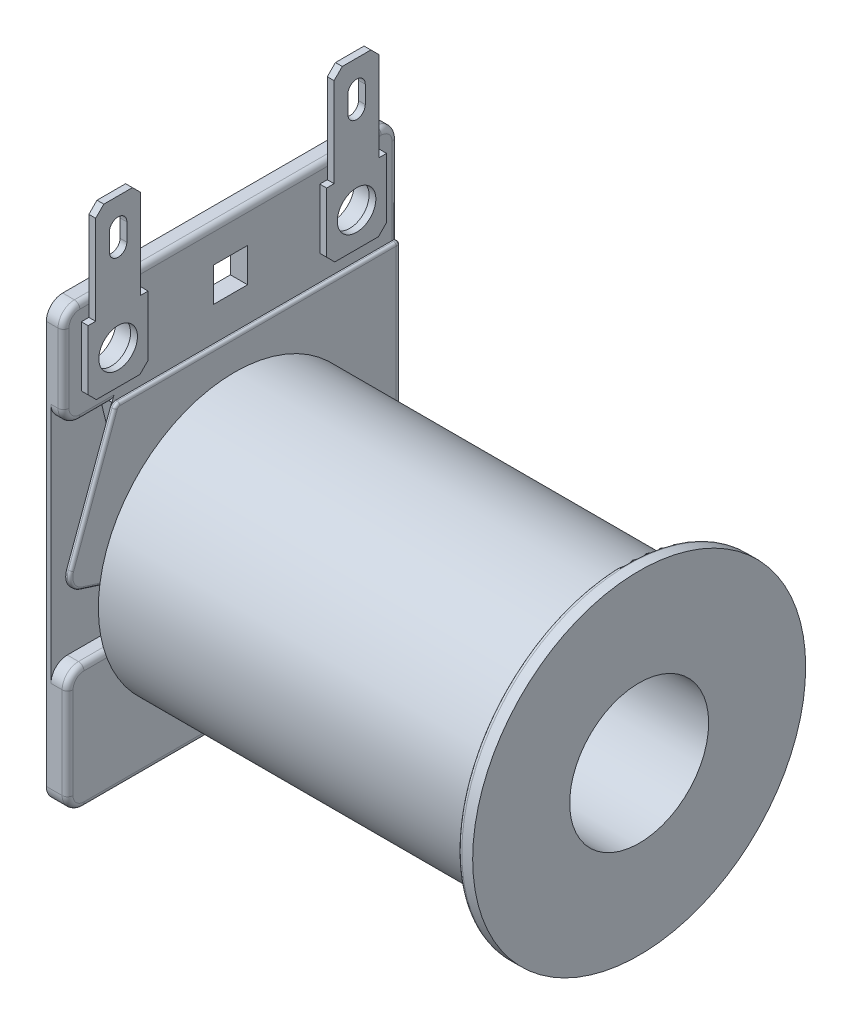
ISO-10303-21;
HEADER;
FILE_DESCRIPTION(('STEP AP214'),'2;1');
FILE_NAME('part.step','',(''),(''),'','','');
FILE_SCHEMA(('AUTOMOTIVE_DESIGN { 1 0 10303 214 1 1 1 1 }'));
ENDSEC;
DATA;
#1=APPLICATION_CONTEXT('core data for automotive mechanical design processes');
#2=APPLICATION_PROTOCOL_DEFINITION('international standard','automotive_design',2000,#1);
#3=PRODUCT_CONTEXT('',#1,'mechanical');
#4=PRODUCT('Part','Part','',(#3));
#5=PRODUCT_RELATED_PRODUCT_CATEGORY('part','',(#4));
#6=PRODUCT_DEFINITION_FORMATION('','',#4);
#7=PRODUCT_DEFINITION_CONTEXT('part definition',#1,'design');
#8=PRODUCT_DEFINITION('design','',#6,#7);
#9=PRODUCT_DEFINITION_SHAPE('','',#8);
#10=(LENGTH_UNIT() NAMED_UNIT(*) SI_UNIT(.MILLI.,.METRE.));
#11=(NAMED_UNIT(*) PLANE_ANGLE_UNIT() SI_UNIT($,.RADIAN.));
#12=(NAMED_UNIT(*) SI_UNIT($,.STERADIAN.) SOLID_ANGLE_UNIT());
#13=UNCERTAINTY_MEASURE_WITH_UNIT(LENGTH_MEASURE(1.E-05),#10,'distance_accuracy_value','');
#14=(GEOMETRIC_REPRESENTATION_CONTEXT(3) GLOBAL_UNCERTAINTY_ASSIGNED_CONTEXT((#13)) GLOBAL_UNIT_ASSIGNED_CONTEXT((#10,
#11,#12)) REPRESENTATION_CONTEXT('',''));
#15=CARTESIAN_POINT('',(0.,0.,0.));
#16=DIRECTION('',(0.,0.,1.));
#17=DIRECTION('',(1.,0.,0.));
#18=AXIS2_PLACEMENT_3D('',#15,#16,#17);
#19=CARTESIAN_POINT('',(2.2352,0.,0.));
#20=DIRECTION('',(-1.,0.,0.));
#21=DIRECTION('',(0.,0.,-1.));
#22=AXIS2_PLACEMENT_3D('',#19,#20,#21);
#23=PLANE('',#22);
#24=DIRECTION('',(0.,1.,0.));
#25=VECTOR('',#24,1.);
#26=CARTESIAN_POINT('',(2.2352,23.5331,-8.3185));
#27=LINE('',#26,#25);
#28=CARTESIAN_POINT('',(2.2352,17.9451,-8.3185));
#29=VERTEX_POINT('',#28);
#30=CARTESIAN_POINT('',(2.2352,23.5331,-8.3185));
#31=VERTEX_POINT('',#30);
#32=EDGE_CURVE('E521',#29,#31,#27,.T.);
#33=ORIENTED_EDGE('',*,*,#32,.F.);
#34=DIRECTION('',(0.,0.707106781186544,0.707106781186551));
#35=VECTOR('',#34,1.);
#36=CARTESIAN_POINT('',(2.2352,17.1831,-9.0805));
#37=LINE('',#36,#35);
#38=CARTESIAN_POINT('',(2.2352,17.1831,-9.0805));
#39=VERTEX_POINT('',#38);
#40=EDGE_CURVE('E1058',#29,#39,#37,.F.);
#41=ORIENTED_EDGE('',*,*,#40,.T.);
#42=DIRECTION('',(0.,0.,1.));
#43=VECTOR('',#42,1.);
#44=CARTESIAN_POINT('',(2.2352,17.1831,-13.9065));
#45=LINE('',#44,#43);
#46=CARTESIAN_POINT('',(2.2352,17.1831,-13.1445));
#47=VERTEX_POINT('',#46);
#48=EDGE_CURVE('E524',#47,#39,#45,.T.);
#49=ORIENTED_EDGE('',*,*,#48,.F.);
#50=DIRECTION('',(0.,-0.707106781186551,0.707106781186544));
#51=VECTOR('',#50,1.);
#52=CARTESIAN_POINT('',(2.2352,17.9451,-13.9065));
#53=LINE('',#52,#51);
#54=CARTESIAN_POINT('',(2.2352,17.9451,-13.9065));
#55=VERTEX_POINT('',#54);
#56=EDGE_CURVE('E1056',#47,#55,#53,.F.);
#57=ORIENTED_EDGE('',*,*,#56,.T.);
#58=DIRECTION('',(0.,-1.,0.));
#59=VECTOR('',#58,1.);
#60=CARTESIAN_POINT('',(2.2352,23.5331,-13.9065));
#61=LINE('',#60,#59);
#62=CARTESIAN_POINT('',(2.2352,23.5331,-13.9065));
#63=VERTEX_POINT('',#62);
#64=EDGE_CURVE('E527',#63,#55,#61,.T.);
#65=ORIENTED_EDGE('',*,*,#64,.F.);
#66=DIRECTION('',(0.,0.,-1.));
#67=VECTOR('',#66,1.);
#68=CARTESIAN_POINT('',(2.2352,23.5331,-13.9065));
#69=LINE('',#68,#67);
#70=CARTESIAN_POINT('',(2.2352,23.5331,-13.208));
#71=VERTEX_POINT('',#70);
#72=EDGE_CURVE('E530',#71,#63,#69,.T.);
#73=ORIENTED_EDGE('',*,*,#72,.F.);
#74=DIRECTION('',(0.,-1.,0.));
#75=VECTOR('',#74,1.);
#76=CARTESIAN_POINT('',(2.2352,32.6136,-13.208));
#77=LINE('',#76,#75);
#78=CARTESIAN_POINT('',(2.2352,31.8516,-13.208));
#79=VERTEX_POINT('',#78);
#80=EDGE_CURVE('E533',#79,#71,#77,.T.);
#81=ORIENTED_EDGE('',*,*,#80,.F.);
#82=DIRECTION('',(0.,-0.707106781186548,-0.707106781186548));
#83=VECTOR('',#82,1.);
#84=CARTESIAN_POINT('',(2.2352,32.6136,-12.446));
#85=LINE('',#84,#83);
#86=CARTESIAN_POINT('',(2.2352,32.6136,-12.446));
#87=VERTEX_POINT('',#86);
#88=EDGE_CURVE('E1052',#79,#87,#85,.F.);
#89=ORIENTED_EDGE('',*,*,#88,.T.);
#90=DIRECTION('',(0.,0.,-1.));
#91=VECTOR('',#90,1.);
#92=CARTESIAN_POINT('',(2.2352,32.6136,-13.208));
#93=LINE('',#92,#91);
#94=CARTESIAN_POINT('',(2.2352,32.6136,-9.77900000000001));
#95=VERTEX_POINT('',#94);
#96=EDGE_CURVE('E535',#95,#87,#93,.T.);
#97=ORIENTED_EDGE('',*,*,#96,.F.);
#98=DIRECTION('',(0.,0.707106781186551,-0.707106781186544));
#99=VECTOR('',#98,1.);
#100=CARTESIAN_POINT('',(2.2352,31.8516,-9.017));
#101=LINE('',#100,#99);
#102=CARTESIAN_POINT('',(2.2352,31.8516,-9.017));
#103=VERTEX_POINT('',#102);
#104=EDGE_CURVE('E1054',#95,#103,#101,.F.);
#105=ORIENTED_EDGE('',*,*,#104,.T.);
#106=DIRECTION('',(0.,1.,0.));
#107=VECTOR('',#106,1.);
#108=CARTESIAN_POINT('',(2.2352,32.6136,-9.017));
#109=LINE('',#108,#107);
#110=CARTESIAN_POINT('',(2.2352,23.5331,-9.017));
#111=VERTEX_POINT('',#110);
#112=EDGE_CURVE('E538',#111,#103,#109,.T.);
#113=ORIENTED_EDGE('',*,*,#112,.F.);
#114=DIRECTION('',(0.,0.,-1.));
#115=VECTOR('',#114,1.);
#116=CARTESIAN_POINT('',(2.2352,23.5331,-9.017));
#117=LINE('',#116,#115);
#118=EDGE_CURVE('E518',#31,#111,#117,.T.);
#119=ORIENTED_EDGE('',*,*,#118,.F.);
#120=EDGE_LOOP('',(#33,#41,#49,#57,#65,#73,#81,#89,#97,#105,#113,#119));
#121=FACE_BOUND('',#120,.T.);
#122=CARTESIAN_POINT('',(2.2352,20.3581,-11.1125));
#123=DIRECTION('',(-1.,0.,0.));
#124=DIRECTION('',(0.,0.,1.));
#125=AXIS2_PLACEMENT_3D('',#122,#123,#124);
#126=CIRCLE('',#125,1.79796878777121);
#127=CARTESIAN_POINT('',(2.2352,20.3581,-9.31453121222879));
#128=VERTEX_POINT('',#127);
#129=EDGE_CURVE('E512',#128,#128,#126,.T.);
#130=ORIENTED_EDGE('',*,*,#129,.T.);
#131=EDGE_LOOP('',(#130));
#132=FACE_BOUND('',#131,.T.);
#133=CARTESIAN_POINT('',(2.2352,30.1106671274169,-11.1125));
#134=DIRECTION('',(-1.,0.,0.));
#135=DIRECTION('',(0.,0.,1.));
#136=AXIS2_PLACEMENT_3D('',#133,#134,#135);
#137=CIRCLE('',#136,0.809964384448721);
#138=CARTESIAN_POINT('',(2.2352,30.1106671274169,-10.3025356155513));
#139=VERTEX_POINT('',#138);
#140=CARTESIAN_POINT('',(2.2352,30.1106671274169,-11.9224643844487));
#141=VERTEX_POINT('',#140);
#142=EDGE_CURVE('E499',#139,#141,#137,.T.);
#143=ORIENTED_EDGE('',*,*,#142,.T.);
#144=DIRECTION('',(0.,-1.,0.));
#145=VECTOR('',#144,1.);
#146=CARTESIAN_POINT('',(2.2352,30.1106671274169,-11.9224643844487));
#147=LINE('',#146,#145);
#148=CARTESIAN_POINT('',(2.2352,28.4666318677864,-11.9224643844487));
#149=VERTEX_POINT('',#148);
#150=EDGE_CURVE('E502',#141,#149,#147,.T.);
#151=ORIENTED_EDGE('',*,*,#150,.T.);
#152=CARTESIAN_POINT('',(2.2352,28.4666318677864,-11.1125));
#153=DIRECTION('',(-1.,0.,0.));
#154=DIRECTION('',(0.,0.,1.));
#155=AXIS2_PLACEMENT_3D('',#152,#153,#154);
#156=CIRCLE('',#155,0.809964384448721);
#157=CARTESIAN_POINT('',(2.2352,28.4666318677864,-10.3025356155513));
#158=VERTEX_POINT('',#157);
#159=EDGE_CURVE('E483',#149,#158,#156,.T.);
#160=ORIENTED_EDGE('',*,*,#159,.T.);
#161=DIRECTION('',(0.,1.,0.));
#162=VECTOR('',#161,1.);
#163=CARTESIAN_POINT('',(2.2352,30.1106671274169,-10.3025356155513));
#164=LINE('',#163,#162);
#165=EDGE_CURVE('E494',#158,#139,#164,.T.);
#166=ORIENTED_EDGE('',*,*,#165,.T.);
#167=EDGE_LOOP('',(#143,#151,#160,#166));
#168=FACE_BOUND('',#167,.T.);
#169=ADVANCED_FACE('F34',(#121,#132,#168),#23,.F.);
#170=CARTESIAN_POINT('',(1.6002,0.,0.));
#171=DIRECTION('',(-1.,0.,0.));
#172=DIRECTION('',(0.,0.,-1.));
#173=AXIS2_PLACEMENT_3D('',#170,#171,#172);
#174=PLANE('',#173);
#175=DIRECTION('',(0.,1.,0.));
#176=VECTOR('',#175,1.);
#177=CARTESIAN_POINT('',(1.6002,32.6136,-9.017));
#178=LINE('',#177,#176);
#179=CARTESIAN_POINT('',(1.6002,24.6126,-9.017));
#180=VERTEX_POINT('',#179);
#181=CARTESIAN_POINT('',(1.6002,31.8516,-9.017));
#182=VERTEX_POINT('',#181);
#183=EDGE_CURVE('E558',#180,#182,#178,.T.);
#184=ORIENTED_EDGE('',*,*,#183,.T.);
#185=DIRECTION('',(0.,-0.707106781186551,0.707106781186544));
#186=VECTOR('',#185,1.);
#187=CARTESIAN_POINT('',(1.6002,11.4172999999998,11.4173));
#188=LINE('',#187,#186);
#189=CARTESIAN_POINT('',(1.6002,32.6136,-9.77900000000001));
#190=VERTEX_POINT('',#189);
#191=EDGE_CURVE('E57',#182,#190,#188,.F.);
#192=ORIENTED_EDGE('',*,*,#191,.T.);
#193=DIRECTION('',(0.,0.,-1.));
#194=VECTOR('',#193,1.);
#195=CARTESIAN_POINT('',(1.6002,32.6136,-13.208));
#196=LINE('',#195,#194);
#197=CARTESIAN_POINT('',(1.6002,32.6136,-12.446));
#198=VERTEX_POINT('',#197);
#199=EDGE_CURVE('E556',#190,#198,#196,.T.);
#200=ORIENTED_EDGE('',*,*,#199,.T.);
#201=DIRECTION('',(0.,0.707106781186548,0.707106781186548));
#202=VECTOR('',#201,1.);
#203=CARTESIAN_POINT('',(1.6002,22.5298,-22.5298));
#204=LINE('',#203,#202);
#205=CARTESIAN_POINT('',(1.6002,31.8516,-13.208));
#206=VERTEX_POINT('',#205);
#207=EDGE_CURVE('E49',#198,#206,#204,.F.);
#208=ORIENTED_EDGE('',*,*,#207,.T.);
#209=DIRECTION('',(0.,-1.,0.));
#210=VECTOR('',#209,1.);
#211=CARTESIAN_POINT('',(1.6002,32.6136,-13.208));
#212=LINE('',#211,#210);
#213=CARTESIAN_POINT('',(1.6002,24.6126,-13.208));
#214=VERTEX_POINT('',#213);
#215=EDGE_CURVE('E554',#206,#214,#212,.T.);
#216=ORIENTED_EDGE('',*,*,#215,.T.);
#217=DIRECTION('',(0.,0.,-1.));
#218=VECTOR('',#217,1.);
#219=CARTESIAN_POINT('',(1.6002,24.6126,0.));
#220=LINE('',#219,#218);
#221=EDGE_CURVE('E832',#214,#180,#220,.F.);
#222=ORIENTED_EDGE('',*,*,#221,.T.);
#223=EDGE_LOOP('',(#184,#192,#200,#208,#216,#222));
#224=FACE_BOUND('',#223,.T.);
#225=DIRECTION('',(0.,1.,0.));
#226=VECTOR('',#225,1.);
#227=CARTESIAN_POINT('',(1.6002,0.,-11.9224643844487));
#228=LINE('',#227,#226);
#229=CARTESIAN_POINT('',(1.6002,28.4666318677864,-11.9224643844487));
#230=VERTEX_POINT('',#229);
#231=CARTESIAN_POINT('',(1.6002,30.1106671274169,-11.9224643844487));
#232=VERTEX_POINT('',#231);
#233=EDGE_CURVE('E1039',#230,#232,#228,.T.);
#234=ORIENTED_EDGE('',*,*,#233,.T.);
#235=CARTESIAN_POINT('',(1.6002,30.1106671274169,-11.1125));
#236=DIRECTION('',(-1.,0.,0.));
#237=DIRECTION('',(0.,0.,1.));
#238=AXIS2_PLACEMENT_3D('',#235,#236,#237);
#239=CIRCLE('',#238,0.809964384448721);
#240=CARTESIAN_POINT('',(1.6002,30.1106671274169,-10.3025356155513));
#241=VERTEX_POINT('',#240);
#242=EDGE_CURVE('E1042',#232,#241,#239,.F.);
#243=ORIENTED_EDGE('',*,*,#242,.T.);
#244=DIRECTION('',(0.,-1.,0.));
#245=VECTOR('',#244,1.);
#246=CARTESIAN_POINT('',(1.6002,0.,-10.3025356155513));
#247=LINE('',#246,#245);
#248=CARTESIAN_POINT('',(1.6002,28.4666318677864,-10.3025356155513));
#249=VERTEX_POINT('',#248);
#250=EDGE_CURVE('E1036',#241,#249,#247,.T.);
#251=ORIENTED_EDGE('',*,*,#250,.T.);
#252=CARTESIAN_POINT('',(1.6002,28.4666318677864,-11.1125));
#253=DIRECTION('',(-1.,0.,0.));
#254=DIRECTION('',(0.,0.,1.));
#255=AXIS2_PLACEMENT_3D('',#252,#253,#254);
#256=CIRCLE('',#255,0.809964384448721);
#257=EDGE_CURVE('E486',#249,#230,#256,.F.);
#258=ORIENTED_EDGE('',*,*,#257,.T.);
#259=EDGE_LOOP('',(#234,#243,#251,#258));
#260=FACE_BOUND('',#259,.T.);
#261=ADVANCED_FACE('F1114',(#224,#260),#174,.T.);
#262=CARTESIAN_POINT('',(1.6002,0.,0.));
#263=DIRECTION('',(-1.,0.,0.));
#264=DIRECTION('',(0.,0.,1.));
#265=AXIS2_PLACEMENT_3D('',#262,#263,#264);
#266=PLANE('',#265);
#267=DIRECTION('',(0.,0.,1.));
#268=VECTOR('',#267,1.);
#269=CARTESIAN_POINT('',(1.6002,21.9456,-1.5875));
#270=LINE('',#269,#268);
#271=CARTESIAN_POINT('',(1.6002,21.9456,-1.5875));
#272=VERTEX_POINT('',#271);
#273=CARTESIAN_POINT('',(1.6002,21.9456,1.5875));
#274=VERTEX_POINT('',#273);
#275=EDGE_CURVE('E672',#272,#274,#270,.T.);
#276=ORIENTED_EDGE('',*,*,#275,.F.);
#277=DIRECTION('',(0.,1.,0.));
#278=VECTOR('',#277,1.);
#279=CARTESIAN_POINT('',(1.6002,18.7706,-1.5875));
#280=LINE('',#279,#278);
#281=CARTESIAN_POINT('',(1.6002,18.7706,-1.5875));
#282=VERTEX_POINT('',#281);
#283=EDGE_CURVE('E676',#282,#272,#280,.T.);
#284=ORIENTED_EDGE('',*,*,#283,.F.);
#285=DIRECTION('',(0.,0.,-1.));
#286=VECTOR('',#285,1.);
#287=CARTESIAN_POINT('',(1.6002,18.7706,-1.5875));
#288=LINE('',#287,#286);
#289=CARTESIAN_POINT('',(1.6002,18.7706,1.5875));
#290=VERTEX_POINT('',#289);
#291=EDGE_CURVE('E679',#290,#282,#288,.T.);
#292=ORIENTED_EDGE('',*,*,#291,.F.);
#293=DIRECTION('',(0.,-1.,0.));
#294=VECTOR('',#293,1.);
#295=CARTESIAN_POINT('',(1.6002,18.7706,1.5875));
#296=LINE('',#295,#294);
#297=EDGE_CURVE('E682',#274,#290,#296,.T.);
#298=ORIENTED_EDGE('',*,*,#297,.F.);
#299=EDGE_LOOP('',(#276,#284,#292,#298));
#300=FACE_BOUND('',#299,.T.);
#301=CARTESIAN_POINT('',(1.6002,24.6126,-14.0462));
#302=VERTEX_POINT('',#301);
#303=EDGE_CURVE('E828',#302,#214,#220,.F.);
#304=ORIENTED_EDGE('',*,*,#303,.T.);
#305=CARTESIAN_POINT('',(1.6002,23.5331,-13.208));
#306=VERTEX_POINT('',#305);
#307=EDGE_CURVE('E553',#214,#306,#212,.T.);
#308=ORIENTED_EDGE('',*,*,#307,.T.);
#309=DIRECTION('',(0.,0.,-1.));
#310=VECTOR('',#309,1.);
#311=CARTESIAN_POINT('',(1.6002,23.5331,-13.9065));
#312=LINE('',#311,#310);
#313=CARTESIAN_POINT('',(1.6002,23.5331,-13.9065));
#314=VERTEX_POINT('',#313);
#315=EDGE_CURVE('E551',#306,#314,#312,.T.);
#316=ORIENTED_EDGE('',*,*,#315,.T.);
#317=DIRECTION('',(0.,-1.,0.));
#318=VECTOR('',#317,1.);
#319=CARTESIAN_POINT('',(1.6002,23.5331,-13.9065));
#320=LINE('',#319,#318);
#321=CARTESIAN_POINT('',(1.6002,17.9451,-13.9065));
#322=VERTEX_POINT('',#321);
#323=EDGE_CURVE('E548',#314,#322,#320,.T.);
#324=ORIENTED_EDGE('',*,*,#323,.T.);
#325=DIRECTION('',(0.,0.707106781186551,-0.707106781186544));
#326=VECTOR('',#325,1.);
#327=CARTESIAN_POINT('',(1.6002,2.01929999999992,2.01929999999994));
#328=LINE('',#327,#326);
#329=CARTESIAN_POINT('',(1.6002,17.1831,-13.1445));
#330=VERTEX_POINT('',#329);
#331=EDGE_CURVE('E11',#322,#330,#328,.F.);
#332=ORIENTED_EDGE('',*,*,#331,.T.);
#333=DIRECTION('',(0.,0.,1.));
#334=VECTOR('',#333,1.);
#335=CARTESIAN_POINT('',(1.6002,17.1831,-13.9065));
#336=LINE('',#335,#334);
#337=CARTESIAN_POINT('',(1.6002,17.1831,-9.0805));
#338=VERTEX_POINT('',#337);
#339=EDGE_CURVE('E545',#330,#338,#336,.T.);
#340=ORIENTED_EDGE('',*,*,#339,.T.);
#341=DIRECTION('',(0.,-0.707106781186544,-0.707106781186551));
#342=VECTOR('',#341,1.);
#343=CARTESIAN_POINT('',(1.6002,13.1318000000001,-13.1318));
#344=LINE('',#343,#342);
#345=CARTESIAN_POINT('',(1.6002,17.9451,-8.3185));
#346=VERTEX_POINT('',#345);
#347=EDGE_CURVE('E42',#338,#346,#344,.F.);
#348=ORIENTED_EDGE('',*,*,#347,.T.);
#349=DIRECTION('',(0.,1.,0.));
#350=VECTOR('',#349,1.);
#351=CARTESIAN_POINT('',(1.6002,23.5331,-8.3185));
#352=LINE('',#351,#350);
#353=CARTESIAN_POINT('',(1.6002,23.5331,-8.3185));
#354=VERTEX_POINT('',#353);
#355=EDGE_CURVE('E543',#346,#354,#352,.T.);
#356=ORIENTED_EDGE('',*,*,#355,.T.);
#357=DIRECTION('',(0.,0.,-1.));
#358=VECTOR('',#357,1.);
#359=CARTESIAN_POINT('',(1.6002,23.5331,-9.017));
#360=LINE('',#359,#358);
#361=CARTESIAN_POINT('',(1.6002,23.5331,-9.017));
#362=VERTEX_POINT('',#361);
#363=EDGE_CURVE('E515',#354,#362,#360,.T.);
#364=ORIENTED_EDGE('',*,*,#363,.T.);
#365=EDGE_CURVE('E522',#362,#180,#178,.T.);
#366=ORIENTED_EDGE('',*,*,#365,.T.);
#367=CARTESIAN_POINT('',(1.6002,24.6126,9.017));
#368=VERTEX_POINT('',#367);
#369=EDGE_CURVE('E833',#180,#368,#220,.F.);
#370=ORIENTED_EDGE('',*,*,#369,.T.);
#371=DIRECTION('',(0.,1.,0.));
#372=VECTOR('',#371,1.);
#373=CARTESIAN_POINT('',(1.6002,32.6136,9.017));
#374=LINE('',#373,#372);
#375=CARTESIAN_POINT('',(1.6002,23.5331,9.017));
#376=VERTEX_POINT('',#375);
#377=EDGE_CURVE('E628',#376,#368,#374,.T.);
#378=ORIENTED_EDGE('',*,*,#377,.F.);
#379=DIRECTION('',(0.,0.,1.));
#380=VECTOR('',#379,1.);
#381=CARTESIAN_POINT('',(1.6002,23.5331,9.017));
#382=LINE('',#381,#380);
#383=CARTESIAN_POINT('',(1.6002,23.5331,8.3185));
#384=VERTEX_POINT('',#383);
#385=EDGE_CURVE('E599',#384,#376,#382,.T.);
#386=ORIENTED_EDGE('',*,*,#385,.F.);
#387=DIRECTION('',(0.,1.,0.));
#388=VECTOR('',#387,1.);
#389=CARTESIAN_POINT('',(1.6002,23.5331,8.3185));
#390=LINE('',#389,#388);
#391=CARTESIAN_POINT('',(1.6002,17.9451,8.3185));
#392=VERTEX_POINT('',#391);
#393=EDGE_CURVE('E606',#392,#384,#390,.T.);
#394=ORIENTED_EDGE('',*,*,#393,.F.);
#395=DIRECTION('',(0.,0.707106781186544,-0.707106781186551));
#396=VECTOR('',#395,1.);
#397=CARTESIAN_POINT('',(1.6002,13.1318000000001,13.1318));
#398=LINE('',#397,#396);
#399=CARTESIAN_POINT('',(1.6002,17.1831,9.08050000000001));
#400=VERTEX_POINT('',#399);
#401=EDGE_CURVE('E1032',#392,#400,#398,.F.);
#402=ORIENTED_EDGE('',*,*,#401,.T.);
#403=DIRECTION('',(0.,0.,-1.));
#404=VECTOR('',#403,1.);
#405=CARTESIAN_POINT('',(1.6002,17.1831,13.9065));
#406=LINE('',#405,#404);
#407=CARTESIAN_POINT('',(1.6002,17.1831,13.1445));
#408=VERTEX_POINT('',#407);
#409=EDGE_CURVE('E643',#408,#400,#406,.T.);
#410=ORIENTED_EDGE('',*,*,#409,.F.);
#411=DIRECTION('',(0.,-0.707106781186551,-0.707106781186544));
#412=VECTOR('',#411,1.);
#413=CARTESIAN_POINT('',(1.6002,2.01929999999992,-2.01929999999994));
#414=LINE('',#413,#412);
#415=CARTESIAN_POINT('',(1.6002,17.9451,13.9065));
#416=VERTEX_POINT('',#415);
#417=EDGE_CURVE('E1034',#408,#416,#414,.F.);
#418=ORIENTED_EDGE('',*,*,#417,.T.);
#419=DIRECTION('',(0.,-1.,0.));
#420=VECTOR('',#419,1.);
#421=CARTESIAN_POINT('',(1.6002,23.5331,13.9065));
#422=LINE('',#421,#420);
#423=CARTESIAN_POINT('',(1.6002,23.5331,13.9065));
#424=VERTEX_POINT('',#423);
#425=EDGE_CURVE('E640',#424,#416,#422,.T.);
#426=ORIENTED_EDGE('',*,*,#425,.F.);
#427=DIRECTION('',(0.,0.,1.));
#428=VECTOR('',#427,1.);
#429=CARTESIAN_POINT('',(1.6002,23.5331,13.9065));
#430=LINE('',#429,#428);
#431=CARTESIAN_POINT('',(1.6002,23.5331,13.208));
#432=VERTEX_POINT('',#431);
#433=EDGE_CURVE('E637',#432,#424,#430,.T.);
#434=ORIENTED_EDGE('',*,*,#433,.F.);
#435=DIRECTION('',(0.,-1.,0.));
#436=VECTOR('',#435,1.);
#437=CARTESIAN_POINT('',(1.6002,32.6136,13.208));
#438=LINE('',#437,#436);
#439=CARTESIAN_POINT('',(1.6002,24.6126,13.208));
#440=VERTEX_POINT('',#439);
#441=EDGE_CURVE('E634',#440,#432,#438,.T.);
#442=ORIENTED_EDGE('',*,*,#441,.F.);
#443=CARTESIAN_POINT('',(1.6002,24.6126,14.0462));
#444=VERTEX_POINT('',#443);
#445=EDGE_CURVE('E827',#440,#444,#220,.F.);
#446=ORIENTED_EDGE('',*,*,#445,.T.);
#447=CARTESIAN_POINT('',(1.6002,23.5966,14.0462));
#448=DIRECTION('',(-1.,0.,0.));
#449=DIRECTION('',(0.,0.,1.));
#450=AXIS2_PLACEMENT_3D('',#447,#448,#449);
#451=CIRCLE('',#450,1.016);
#452=CARTESIAN_POINT('',(1.6002,23.5966,15.0622));
#453=VERTEX_POINT('',#452);
#454=EDGE_CURVE('E825',#444,#453,#451,.F.);
#455=ORIENTED_EDGE('',*,*,#454,.T.);
#456=DIRECTION('',(0.,1.,0.));
#457=VECTOR('',#456,1.);
#458=CARTESIAN_POINT('',(1.6002,0.,15.0622));
#459=LINE('',#458,#457);
#460=CARTESIAN_POINT('',(1.6002,17.1196,15.0622));
#461=VERTEX_POINT('',#460);
#462=EDGE_CURVE('E823',#453,#461,#459,.F.);
#463=ORIENTED_EDGE('',*,*,#462,.T.);
#464=CARTESIAN_POINT('',(1.6002,17.1196,14.0462));
#465=DIRECTION('',(-1.,0.,0.));
#466=DIRECTION('',(0.,0.,1.));
#467=AXIS2_PLACEMENT_3D('',#464,#465,#466);
#468=CIRCLE('',#467,1.016);
#469=CARTESIAN_POINT('',(1.6002,16.1036,14.0462));
#470=VERTEX_POINT('',#469);
#471=EDGE_CURVE('E821',#461,#470,#468,.F.);
#472=ORIENTED_EDGE('',*,*,#471,.T.);
#473=DIRECTION('',(0.,0.,-1.));
#474=VECTOR('',#473,1.);
#475=CARTESIAN_POINT('',(1.6002,16.1036,0.));
#476=LINE('',#475,#474);
#477=CARTESIAN_POINT('',(1.6002,16.1036,10.8619112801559));
#478=VERTEX_POINT('',#477);
#479=EDGE_CURVE('E818',#470,#478,#476,.T.);
#480=ORIENTED_EDGE('',*,*,#479,.T.);
#481=DIRECTION('',(0.,-0.938384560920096,0.345592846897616));
#482=VECTOR('',#481,1.);
#483=CARTESIAN_POINT('',(1.6002,5.44583093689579,14.7870064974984));
#484=LINE('',#483,#482);
#485=CARTESIAN_POINT('',(1.6002,15.263161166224,11.1714321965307));
#486=VERTEX_POINT('',#485);
#487=EDGE_CURVE('E815',#478,#486,#484,.T.);
#488=ORIENTED_EDGE('',*,*,#487,.T.);
#489=CARTESIAN_POINT('',(1.6002,15.0876,10.6947328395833));
#490=DIRECTION('',(-1.,0.,0.));
#491=DIRECTION('',(0.,0.,1.));
#492=AXIS2_PLACEMENT_3D('',#489,#490,#491);
#493=CIRCLE('',#492,0.508);
#494=CARTESIAN_POINT('',(1.6002,15.5956,10.6947328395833));
#495=VERTEX_POINT('',#494);
#496=EDGE_CURVE('E1738',#486,#495,#493,.T.);
#497=ORIENTED_EDGE('',*,*,#496,.T.);
#498=DIRECTION('',(0.,0.,-1.));
#499=VECTOR('',#498,1.);
#500=CARTESIAN_POINT('',(1.6002,15.5956,19.6984510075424));
#501=LINE('',#500,#499);
#502=CARTESIAN_POINT('',(1.6002,15.5956,-15.0622));
#503=VERTEX_POINT('',#502);
#504=EDGE_CURVE('E669',#495,#503,#501,.T.);
#505=ORIENTED_EDGE('',*,*,#504,.T.);
#506=DIRECTION('',(0.,-1.,0.));
#507=VECTOR('',#506,1.);
#508=CARTESIAN_POINT('',(1.6002,0.,-15.0622));
#509=LINE('',#508,#507);
#510=CARTESIAN_POINT('',(1.6002,23.5966,-15.0622));
#511=VERTEX_POINT('',#510);
#512=EDGE_CURVE('E836',#503,#511,#509,.F.);
#513=ORIENTED_EDGE('',*,*,#512,.T.);
#514=CARTESIAN_POINT('',(1.6002,23.5966,-14.0462));
#515=DIRECTION('',(-1.,0.,0.));
#516=DIRECTION('',(0.,0.,1.));
#517=AXIS2_PLACEMENT_3D('',#514,#515,#516);
#518=CIRCLE('',#517,1.016);
#519=EDGE_CURVE('E831',#511,#302,#518,.F.);
#520=ORIENTED_EDGE('',*,*,#519,.T.);
#521=EDGE_LOOP('',(#304,#308,#316,#324,#332,#340,#348,#356,#364,#366,#370,#378,#386,#394,#402,
#410,#418,#426,#434,#442,#446,#455,#463,#472,#480,#488,#497,#505,#513,#520));
#522=FACE_BOUND('',#521,.T.);
#523=ADVANCED_FACE('F1075',(#300,#522),#266,.F.);
#524=CARTESIAN_POINT('',(39.6875,0.,0.));
#525=DIRECTION('',(-1.,0.,0.));
#526=DIRECTION('',(0.,0.,1.));
#527=AXIS2_PLACEMENT_3D('',#524,#525,#526);
#528=CYLINDRICAL_SURFACE('',#527,7.239);
#529=CARTESIAN_POINT('',(1.9812,0.,0.));
#530=DIRECTION('',(1.,0.,0.));
#531=DIRECTION('',(0.,0.,-1.));
#532=AXIS2_PLACEMENT_3D('',#529,#530,#531);
#533=CIRCLE('',#532,7.239);
#534=CARTESIAN_POINT('',(1.9812,0.264863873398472,7.23415289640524));
#535=VERTEX_POINT('',#534);
#536=CARTESIAN_POINT('',(1.9812,-4.3942,5.75274954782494));
#537=VERTEX_POINT('',#536);
#538=EDGE_CURVE('E661',#535,#537,#533,.T.);
#539=ORIENTED_EDGE('',*,*,#538,.F.);
#540=CARTESIAN_POINT('',(1.9812,0.264863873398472,7.23415289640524));
#541=CARTESIAN_POINT('',(1.98120960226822,0.249540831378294,7.23471579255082));
#542=CARTESIAN_POINT('',(1.97991058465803,0.234218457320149,7.23522621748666));
#543=CARTESIAN_POINT('',(1.9747784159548,0.203998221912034,7.23614034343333));
#544=CARTESIAN_POINT('',(1.97094489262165,0.1891004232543,7.23654402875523));
#545=CARTESIAN_POINT('',(1.96082365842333,0.160148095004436,7.23724294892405));
#546=CARTESIAN_POINT('',(1.95453439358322,0.14609410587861,7.23753811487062));
#547=CARTESIAN_POINT('',(1.93965724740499,0.119262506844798,7.2380299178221));
#548=CARTESIAN_POINT('',(1.93107022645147,0.106484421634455,7.23822659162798));
#549=CARTESIAN_POINT('',(1.91194152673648,0.0827723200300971,7.23853637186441));
#550=CARTESIAN_POINT('',(1.90142836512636,0.0718153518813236,7.23865059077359));
#551=CARTESIAN_POINT('',(1.87864148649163,0.051906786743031,7.23882076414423));
#552=CARTESIAN_POINT('',(1.86636767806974,0.0429552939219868,7.23887671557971));
#553=CARTESIAN_POINT('',(1.84092507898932,0.0277020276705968,7.23895087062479));
#554=CARTESIAN_POINT('',(1.82781030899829,0.0213100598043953,7.23897046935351));
#555=CARTESIAN_POINT('',(1.80066731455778,0.0109365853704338,7.23899361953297));
#556=CARTESIAN_POINT('',(1.78664027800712,0.00695201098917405,7.23899719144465));
#557=CARTESIAN_POINT('',(1.7649347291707,0.00283587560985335,7.23899956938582));
#558=CARTESIAN_POINT('',(1.75742199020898,0.00177301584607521,7.23899983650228));
#559=CARTESIAN_POINT('',(1.74234082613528,0.000355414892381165,7.23900000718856));
#560=CARTESIAN_POINT('',(1.73477249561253,-3.33033445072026E-07,7.2389999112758));
#561=CARTESIAN_POINT('',(1.72720000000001,0.,7.23900000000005));
#562=B_SPLINE_CURVE_WITH_KNOTS('',3,(#540,#541,#542,#543,#544,#545,#546,#547,#548,#549,#550,
#551,#552,#553,#554,#555,#556,#557,#558,#559,#560,#561),.UNSPECIFIED.,.F.,.F.,(4,2,2,2,2,2,2,2,
2,2,4),(0.,0.0459420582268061,0.0918908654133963,0.137868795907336,0.183829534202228,
0.22915795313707,0.274488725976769,0.318040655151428,0.361536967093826,0.384270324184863,
0.406971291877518),.UNSPECIFIED.);
#563=CARTESIAN_POINT('',(1.7272,0.,7.239));
#564=VERTEX_POINT('',#563);
#565=EDGE_CURVE('E985',#535,#564,#562,.T.);
#566=ORIENTED_EDGE('',*,*,#565,.T.);
#567=DIRECTION('',(-1.,0.,0.));
#568=VECTOR('',#567,1.);
#569=CARTESIAN_POINT('',(2.7178,0.,7.239));
#570=LINE('',#569,#568);
#571=CARTESIAN_POINT('',(1.5748,0.,7.239));
#572=VERTEX_POINT('',#571);
#573=EDGE_CURVE('E721',#564,#572,#570,.T.);
#574=ORIENTED_EDGE('',*,*,#573,.T.);
#575=DIRECTION('',(-1.,0.,0.));
#576=VECTOR('',#575,1.);
#577=CARTESIAN_POINT('',(1.5748,0.,7.239));
#578=LINE('',#577,#576);
#579=CARTESIAN_POINT('',(0.4318,0.,7.239));
#580=VERTEX_POINT('',#579);
#581=EDGE_CURVE('E747',#572,#580,#578,.T.);
#582=ORIENTED_EDGE('',*,*,#581,.T.);
#583=CARTESIAN_POINT('',(0.4318,0.,0.));
#584=DIRECTION('',(1.,0.,0.));
#585=DIRECTION('',(0.,0.,1.));
#586=AXIS2_PLACEMENT_3D('',#583,#584,#585);
#587=CIRCLE('',#586,7.239);
#588=CARTESIAN_POINT('',(0.4318,-3.8862,6.10741930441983));
#589=VERTEX_POINT('',#588);
#590=EDGE_CURVE('E739',#580,#589,#587,.T.);
#591=ORIENTED_EDGE('',*,*,#590,.T.);
#592=DIRECTION('',(-1.,0.,0.));
#593=VECTOR('',#592,1.);
#594=CARTESIAN_POINT('',(1.5748,-3.8862,6.10741930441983));
#595=LINE('',#594,#593);
#596=CARTESIAN_POINT('',(1.4732,-3.8862,6.10741930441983));
#597=VERTEX_POINT('',#596);
#598=EDGE_CURVE('E744',#597,#589,#595,.T.);
#599=ORIENTED_EDGE('',*,*,#598,.F.);
#600=CARTESIAN_POINT('',(1.4732,-3.8862,6.10741930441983));
#601=CARTESIAN_POINT('',(1.4984754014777,-3.88616515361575,6.10743690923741));
#602=CARTESIAN_POINT('',(1.52372148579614,-3.88808390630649,6.10622057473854));
#603=CARTESIAN_POINT('',(1.57333398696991,-3.89554794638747,6.10146385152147));
#604=CARTESIAN_POINT('',(1.59770386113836,-3.90107681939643,6.09793398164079));
#605=CARTESIAN_POINT('',(1.6449630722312,-3.91547859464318,6.08869580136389));
#606=CARTESIAN_POINT('',(1.66785369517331,-3.92434854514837,6.08298941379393));
#607=CARTESIAN_POINT('',(1.71167348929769,-3.94499931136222,6.06961723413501));
#608=CARTESIAN_POINT('',(1.73260099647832,-3.95678256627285,6.06194979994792));
#609=CARTESIAN_POINT('',(1.7731449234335,-3.98344899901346,6.04446202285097));
#610=CARTESIAN_POINT('',(1.79263604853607,-3.99846179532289,6.0345502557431));
#611=CARTESIAN_POINT('',(1.82878580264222,-4.03059539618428,6.01313519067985));
#612=CARTESIAN_POINT('',(1.84544360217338,-4.0477168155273,6.00163142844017));
#613=CARTESIAN_POINT('',(1.8780433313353,-4.08615772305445,5.97553762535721));
#614=CARTESIAN_POINT('',(1.89352717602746,-4.10772538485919,5.96074212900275));
#615=CARTESIAN_POINT('',(1.92065304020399,-4.15226804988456,5.92980001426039));
#616=CARTESIAN_POINT('',(1.93229146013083,-4.17524434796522,5.91365214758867));
#617=CARTESIAN_POINT('',(1.95354009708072,-4.22618718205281,5.87738079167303));
#618=CARTESIAN_POINT('',(1.96242376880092,-4.25431566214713,5.85706034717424));
#619=CARTESIAN_POINT('',(1.97517400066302,-4.31096333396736,5.8154920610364));
#620=CARTESIAN_POINT('',(1.97904567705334,-4.33948209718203,5.79424518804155));
#621=CARTESIAN_POINT('',(1.98097377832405,-4.37667831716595,5.76610195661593));
#622=CARTESIAN_POINT('',(1.98119989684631,-4.38544866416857,5.75943458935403));
#623=CARTESIAN_POINT('',(1.9812,-4.3942,5.75274954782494));
#624=B_SPLINE_CURVE_WITH_KNOTS('',3,(#600,#601,#602,#603,#604,#605,#606,#607,#608,#609,#610,
#611,#612,#613,#614,#615,#616,#617,#618,#619,#620,#621,#622,#623),.UNSPECIFIED.,.F.,.F.,(4,2,2,
2,2,2,2,2,2,2,2,4),(0.,0.0756782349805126,0.151014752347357,0.22628486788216,0.301618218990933,
0.380880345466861,0.460165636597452,0.551005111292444,0.641929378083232,0.748990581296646,
0.855942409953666,0.888988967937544),.UNSPECIFIED.);
#625=EDGE_CURVE('E913',#597,#537,#624,.T.);
#626=ORIENTED_EDGE('',*,*,#625,.T.);
#627=EDGE_LOOP('',(#539,#566,#574,#582,#591,#599,#626));
#628=FACE_BOUND('',#627,.T.);
#629=ADVANCED_FACE('F923',(#628),#528,.T.);
#630=CARTESIAN_POINT('',(1.9812,0.,0.));
#631=DIRECTION('',(-1.,0.,0.));
#632=DIRECTION('',(0.,0.,1.));
#633=AXIS2_PLACEMENT_3D('',#630,#631,#632);
#634=PLANE('',#633);
#635=CARTESIAN_POINT('',(1.9812,0.,0.));
#636=DIRECTION('',(1.,0.,0.));
#637=DIRECTION('',(0.,0.,-1.));
#638=AXIS2_PLACEMENT_3D('',#635,#636,#637);
#639=CIRCLE('',#638,12.7);
#640=CARTESIAN_POINT('',(1.9812,-4.3942,11.9155783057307));
#641=VERTEX_POINT('',#640);
#642=CARTESIAN_POINT('',(1.9812,1.94583936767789,12.5500481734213));
#643=VERTEX_POINT('',#642);
#644=EDGE_CURVE('E664',#641,#643,#639,.T.);
#645=ORIENTED_EDGE('',*,*,#644,.F.);
#646=DIRECTION('',(0.,0.,1.));
#647=VECTOR('',#646,1.);
#648=CARTESIAN_POINT('',(1.9812,-4.3942,0.));
#649=LINE('',#648,#647);
#650=CARTESIAN_POINT('',(1.9812,-4.3942,14.0462));
#651=VERTEX_POINT('',#650);
#652=EDGE_CURVE('E895',#641,#651,#649,.T.);
#653=ORIENTED_EDGE('',*,*,#652,.T.);
#654=CARTESIAN_POINT('',(1.9812,-5.4102,14.0462));
#655=DIRECTION('',(-1.,0.,0.));
#656=DIRECTION('',(0.,0.,1.));
#657=AXIS2_PLACEMENT_3D('',#654,#655,#656);
#658=CIRCLE('',#657,1.016);
#659=CARTESIAN_POINT('',(1.9812,-5.4102,15.0622));
#660=VERTEX_POINT('',#659);
#661=EDGE_CURVE('E893',#651,#660,#658,.F.);
#662=ORIENTED_EDGE('',*,*,#661,.T.);
#663=DIRECTION('',(0.,-1.,0.));
#664=VECTOR('',#663,1.);
#665=CARTESIAN_POINT('',(1.9812,0.,15.0622));
#666=LINE('',#665,#664);
#667=CARTESIAN_POINT('',(1.9812,-13.9446,15.0622));
#668=VERTEX_POINT('',#667);
#669=EDGE_CURVE('E891',#660,#668,#666,.T.);
#670=ORIENTED_EDGE('',*,*,#669,.T.);
#671=CARTESIAN_POINT('',(1.9812,-13.9446,14.0462));
#672=DIRECTION('',(-1.,0.,0.));
#673=DIRECTION('',(0.,0.,1.));
#674=AXIS2_PLACEMENT_3D('',#671,#672,#673);
#675=CIRCLE('',#674,1.016);
#676=CARTESIAN_POINT('',(1.9812,-14.9606,14.0462));
#677=VERTEX_POINT('',#676);
#678=EDGE_CURVE('E889',#668,#677,#675,.F.);
#679=ORIENTED_EDGE('',*,*,#678,.T.);
#680=DIRECTION('',(0.,0.,-1.));
#681=VECTOR('',#680,1.);
#682=CARTESIAN_POINT('',(1.9812,-14.9606,0.));
#683=LINE('',#682,#681);
#684=CARTESIAN_POINT('',(1.9812,-14.9606,-14.0462));
#685=VERTEX_POINT('',#684);
#686=EDGE_CURVE('E887',#677,#685,#683,.T.);
#687=ORIENTED_EDGE('',*,*,#686,.T.);
#688=CARTESIAN_POINT('',(1.9812,-13.9446,-14.0462));
#689=DIRECTION('',(-1.,0.,0.));
#690=DIRECTION('',(0.,0.,1.));
#691=AXIS2_PLACEMENT_3D('',#688,#689,#690);
#692=CIRCLE('',#691,1.016);
#693=CARTESIAN_POINT('',(1.9812,-13.9446,-15.0622));
#694=VERTEX_POINT('',#693);
#695=EDGE_CURVE('E885',#685,#694,#692,.F.);
#696=ORIENTED_EDGE('',*,*,#695,.T.);
#697=DIRECTION('',(0.,1.,0.));
#698=VECTOR('',#697,1.);
#699=CARTESIAN_POINT('',(1.9812,0.,-15.0622));
#700=LINE('',#699,#698);
#701=CARTESIAN_POINT('',(1.9812,15.3416,-15.0622));
#702=VERTEX_POINT('',#701);
#703=EDGE_CURVE('E882',#694,#702,#700,.T.);
#704=ORIENTED_EDGE('',*,*,#703,.T.);
#705=DIRECTION('',(0.,0.,-1.));
#706=VECTOR('',#705,1.);
#707=CARTESIAN_POINT('',(1.9812,15.3416,0.));
#708=LINE('',#707,#706);
#709=CARTESIAN_POINT('',(1.9812,15.3416,10.6947328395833));
#710=VERTEX_POINT('',#709);
#711=EDGE_CURVE('E2205',#702,#710,#708,.F.);
#712=ORIENTED_EDGE('',*,*,#711,.T.);
#713=CARTESIAN_POINT('',(1.9812,15.0876,10.6947328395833));
#714=DIRECTION('',(-1.,0.,0.));
#715=DIRECTION('',(0.,0.,1.));
#716=AXIS2_PLACEMENT_3D('',#713,#714,#715);
#717=CIRCLE('',#716,0.254);
#718=CARTESIAN_POINT('',(1.9812,15.175380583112,10.933082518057));
#719=VERTEX_POINT('',#718);
#720=EDGE_CURVE('E1756',#710,#719,#717,.F.);
#721=ORIENTED_EDGE('',*,*,#720,.T.);
#722=DIRECTION('',(0.,-0.938384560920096,0.345592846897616));
#723=VECTOR('',#722,1.);
#724=CARTESIAN_POINT('',(1.9812,5.3580503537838,14.5486568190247));
#725=LINE('',#724,#723);
#726=CARTESIAN_POINT('',(1.9812,4.11646097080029,15.0059154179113));
#727=VERTEX_POINT('',#726);
#728=EDGE_CURVE('E2186',#719,#727,#725,.T.);
#729=ORIENTED_EDGE('',*,*,#728,.T.);
#730=CARTESIAN_POINT('',(1.9812,3.67755805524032,13.8141670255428));
#731=DIRECTION('',(-1.,0.,0.));
#732=DIRECTION('',(0.,0.,1.));
#733=AXIS2_PLACEMENT_3D('',#730,#731,#732);
#734=CIRCLE('',#733,1.27);
#735=CARTESIAN_POINT('',(1.9812,2.46665675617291,14.1970743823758));
#736=VERTEX_POINT('',#735);
#737=EDGE_CURVE('E2182',#727,#736,#734,.F.);
#738=ORIENTED_EDGE('',*,*,#737,.T.);
#739=DIRECTION('',(0.,-0.301501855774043,-0.953465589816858));
#740=VECTOR('',#739,1.);
#741=CARTESIAN_POINT('',(1.9812,-1.83882697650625,0.581468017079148));
#742=LINE('',#741,#740);
#743=EDGE_CURVE('E2189',#736,#643,#742,.T.);
#744=ORIENTED_EDGE('',*,*,#743,.T.);
#745=EDGE_LOOP('',(#645,#653,#662,#670,#679,#687,#696,#704,#712,#721,#729,#738,#744));
#746=FACE_BOUND('',#745,.T.);
#747=ADVANCED_FACE('F1558',(#746),#634,.F.);
#748=CARTESIAN_POINT('',(38.2905,0.,0.));
#749=DIRECTION('',(1.,0.,0.));
#750=DIRECTION('',(0.,0.,-1.));
#751=AXIS2_PLACEMENT_3D('',#748,#749,#750);
#752=PLANE('',#751);
#753=CARTESIAN_POINT('',(38.2905,0.,0.));
#754=DIRECTION('',(1.,0.,0.));
#755=DIRECTION('',(0.,0.,-1.));
#756=AXIS2_PLACEMENT_3D('',#753,#754,#755);
#757=CIRCLE('',#756,15.1384);
#758=CARTESIAN_POINT('',(38.2905,0.,-15.1384));
#759=VERTEX_POINT('',#758);
#760=EDGE_CURVE('E984',#759,#759,#757,.F.);
#761=ORIENTED_EDGE('',*,*,#760,.T.);
#762=EDGE_LOOP('',(#761));
#763=FACE_BOUND('',#762,.T.);
#764=CARTESIAN_POINT('',(38.2905,0.,0.));
#765=DIRECTION('',(1.,0.,0.));
#766=DIRECTION('',(0.,0.,-1.));
#767=AXIS2_PLACEMENT_3D('',#764,#765,#766);
#768=CIRCLE('',#767,12.7);
#769=CARTESIAN_POINT('',(38.2905,0.,-12.7));
#770=VERTEX_POINT('',#769);
#771=EDGE_CURVE('E988',#770,#770,#768,.F.);
#772=ORIENTED_EDGE('',*,*,#771,.F.);
#773=EDGE_LOOP('',(#772));
#774=FACE_BOUND('',#773,.T.);
#775=ADVANCED_FACE('F1575',(#763,#774),#752,.F.);
#776=CARTESIAN_POINT('',(1.9812,-15.4686,15.5702));
#777=DIRECTION('',(0.,0.,-1.));
#778=DIRECTION('',(-1.,0.,0.));
#779=AXIS2_PLACEMENT_3D('',#776,#777,#778);
#780=PLANE('',#779);
#781=DIRECTION('',(-1.,0.,0.));
#782=VECTOR('',#781,1.);
#783=CARTESIAN_POINT('',(1.9812,-13.9446,15.5702));
#784=LINE('',#783,#782);
#785=CARTESIAN_POINT('',(0.,-13.9446,15.5702));
#786=VERTEX_POINT('',#785);
#787=CARTESIAN_POINT('',(1.4732,-13.9446,15.5702));
#788=VERTEX_POINT('',#787);
#789=EDGE_CURVE('E795',#786,#788,#784,.F.);
#790=ORIENTED_EDGE('',*,*,#789,.T.);
#791=DIRECTION('',(0.,-1.,0.));
#792=VECTOR('',#791,1.);
#793=CARTESIAN_POINT('',(1.4732,-15.4686,15.5702));
#794=LINE('',#793,#792);
#795=CARTESIAN_POINT('',(1.4732,-5.4102,15.5702));
#796=VERTEX_POINT('',#795);
#797=EDGE_CURVE('E903',#788,#796,#794,.F.);
#798=ORIENTED_EDGE('',*,*,#797,.T.);
#799=DIRECTION('',(-1.,0.,0.));
#800=VECTOR('',#799,1.);
#801=CARTESIAN_POINT('',(1.9812,-5.4102,15.5702));
#802=LINE('',#801,#800);
#803=CARTESIAN_POINT('',(0.4318,-5.4102,15.5702));
#804=VERTEX_POINT('',#803);
#805=EDGE_CURVE('E801',#796,#804,#802,.T.);
#806=ORIENTED_EDGE('',*,*,#805,.T.);
#807=DIRECTION('',(0.,1.,0.));
#808=VECTOR('',#807,1.);
#809=CARTESIAN_POINT('',(0.4318,15.5956,15.5702));
#810=LINE('',#809,#808);
#811=CARTESIAN_POINT('',(0.4318,17.1196,15.5702));
#812=VERTEX_POINT('',#811);
#813=EDGE_CURVE('E723',#804,#812,#810,.T.);
#814=ORIENTED_EDGE('',*,*,#813,.T.);
#815=DIRECTION('',(-1.,0.,0.));
#816=VECTOR('',#815,1.);
#817=CARTESIAN_POINT('',(1.9812,17.1196,15.5702));
#818=LINE('',#817,#816);
#819=CARTESIAN_POINT('',(1.0922,17.1196,15.5702));
#820=VERTEX_POINT('',#819);
#821=EDGE_CURVE('E798',#812,#820,#818,.F.);
#822=ORIENTED_EDGE('',*,*,#821,.T.);
#823=DIRECTION('',(0.,1.,0.));
#824=VECTOR('',#823,1.);
#825=CARTESIAN_POINT('',(1.0922,-15.4686,15.5702));
#826=LINE('',#825,#824);
#827=CARTESIAN_POINT('',(1.0922,23.5966,15.5702));
#828=VERTEX_POINT('',#827);
#829=EDGE_CURVE('E844',#820,#828,#826,.T.);
#830=ORIENTED_EDGE('',*,*,#829,.T.);
#831=DIRECTION('',(-1.,0.,0.));
#832=VECTOR('',#831,1.);
#833=CARTESIAN_POINT('',(1.9812,23.5966,15.5702));
#834=LINE('',#833,#832);
#835=CARTESIAN_POINT('',(0.,23.5966,15.5702));
#836=VERTEX_POINT('',#835);
#837=EDGE_CURVE('E793',#828,#836,#834,.T.);
#838=ORIENTED_EDGE('',*,*,#837,.T.);
#839=DIRECTION('',(0.,-1.,0.));
#840=VECTOR('',#839,1.);
#841=CARTESIAN_POINT('',(0.,-15.4686,15.5702));
#842=LINE('',#841,#840);
#843=EDGE_CURVE('E764',#836,#786,#842,.T.);
#844=ORIENTED_EDGE('',*,*,#843,.T.);
#845=EDGE_LOOP('',(#790,#798,#806,#814,#822,#830,#838,#844));
#846=FACE_BOUND('',#845,.T.);
#847=ADVANCED_FACE('F1585',(#846),#780,.F.);
#848=CARTESIAN_POINT('',(0.,0.,0.));
#849=DIRECTION('',(-1.,0.,0.));
#850=DIRECTION('',(0.,0.,1.));
#851=AXIS2_PLACEMENT_3D('',#848,#849,#850);
#852=PLANE('',#851);
#853=DIRECTION('',(0.,1.,0.));
#854=VECTOR('',#853,1.);
#855=CARTESIAN_POINT('',(0.,18.7706,1.5875));
#856=LINE('',#855,#854);
#857=CARTESIAN_POINT('',(0.,18.7706,1.5875));
#858=VERTEX_POINT('',#857);
#859=CARTESIAN_POINT('',(0.,21.9456,1.5875));
#860=VERTEX_POINT('',#859);
#861=EDGE_CURVE('E685',#858,#860,#856,.T.);
#862=ORIENTED_EDGE('',*,*,#861,.F.);
#863=DIRECTION('',(0.,0.,1.));
#864=VECTOR('',#863,1.);
#865=CARTESIAN_POINT('',(0.,18.7706,-1.5875));
#866=LINE('',#865,#864);
#867=CARTESIAN_POINT('',(0.,18.7706,-1.5875));
#868=VERTEX_POINT('',#867);
#869=EDGE_CURVE('E694',#868,#858,#866,.T.);
#870=ORIENTED_EDGE('',*,*,#869,.F.);
#871=DIRECTION('',(0.,-1.,0.));
#872=VECTOR('',#871,1.);
#873=CARTESIAN_POINT('',(0.,18.7706,-1.5875));
#874=LINE('',#873,#872);
#875=CARTESIAN_POINT('',(0.,21.9456,-1.5875));
#876=VERTEX_POINT('',#875);
#877=EDGE_CURVE('E691',#876,#868,#874,.T.);
#878=ORIENTED_EDGE('',*,*,#877,.F.);
#879=DIRECTION('',(0.,0.,-1.));
#880=VECTOR('',#879,1.);
#881=CARTESIAN_POINT('',(0.,21.9456,-1.5875));
#882=LINE('',#881,#880);
#883=EDGE_CURVE('E688',#860,#876,#882,.T.);
#884=ORIENTED_EDGE('',*,*,#883,.F.);
#885=EDGE_LOOP('',(#862,#870,#878,#884));
#886=FACE_BOUND('',#885,.T.);
#887=CARTESIAN_POINT('',(0.,20.3581,11.1125));
#888=DIRECTION('',(-1.,0.,0.));
#889=DIRECTION('',(0.,0.,-1.));
#890=AXIS2_PLACEMENT_3D('',#887,#888,#889);
#891=CIRCLE('',#890,2.032);
#892=CARTESIAN_POINT('',(0.,20.3581,9.0805));
#893=VERTEX_POINT('',#892);
#894=EDGE_CURVE('E700',#893,#893,#891,.T.);
#895=ORIENTED_EDGE('',*,*,#894,.F.);
#896=EDGE_LOOP('',(#895));
#897=FACE_BOUND('',#896,.T.);
#898=CARTESIAN_POINT('',(0.,20.3581,-11.1125));
#899=DIRECTION('',(-1.,0.,0.));
#900=DIRECTION('',(0.,0.,1.));
#901=AXIS2_PLACEMENT_3D('',#898,#899,#900);
#902=CIRCLE('',#901,2.032);
#903=CARTESIAN_POINT('',(0.,20.3581,-9.0805));
#904=VERTEX_POINT('',#903);
#905=EDGE_CURVE('E708',#904,#904,#902,.T.);
#906=ORIENTED_EDGE('',*,*,#905,.F.);
#907=EDGE_LOOP('',(#906));
#908=FACE_BOUND('',#907,.T.);
#909=DIRECTION('',(0.,1.,0.));
#910=VECTOR('',#909,1.);
#911=CARTESIAN_POINT('',(0.,-15.4686,-15.5702));
#912=LINE('',#911,#910);
#913=CARTESIAN_POINT('',(0.,-13.9446,-15.5702));
#914=VERTEX_POINT('',#913);
#915=CARTESIAN_POINT('',(0.,23.5966,-15.5702));
#916=VERTEX_POINT('',#915);
#917=EDGE_CURVE('E758',#914,#916,#912,.T.);
#918=ORIENTED_EDGE('',*,*,#917,.F.);
#919=CARTESIAN_POINT('',(0.,-13.9446,-14.0462));
#920=DIRECTION('',(-1.,0.,0.));
#921=DIRECTION('',(0.,0.,1.));
#922=AXIS2_PLACEMENT_3D('',#919,#920,#921);
#923=CIRCLE('',#922,1.524);
#924=CARTESIAN_POINT('',(0.,-15.4686,-14.0462));
#925=VERTEX_POINT('',#924);
#926=EDGE_CURVE('E781',#914,#925,#923,.T.);
#927=ORIENTED_EDGE('',*,*,#926,.T.);
#928=DIRECTION('',(0.,0.,-1.));
#929=VECTOR('',#928,1.);
#930=CARTESIAN_POINT('',(0.,-15.4686,15.5702));
#931=LINE('',#930,#929);
#932=CARTESIAN_POINT('',(0.,-15.4686,14.0462));
#933=VERTEX_POINT('',#932);
#934=EDGE_CURVE('E767',#933,#925,#931,.T.);
#935=ORIENTED_EDGE('',*,*,#934,.F.);
#936=CARTESIAN_POINT('',(0.,-13.9446,14.0462));
#937=DIRECTION('',(-1.,0.,0.));
#938=DIRECTION('',(0.,0.,1.));
#939=AXIS2_PLACEMENT_3D('',#936,#937,#938);
#940=CIRCLE('',#939,1.524);
#941=EDGE_CURVE('E777',#933,#786,#940,.T.);
#942=ORIENTED_EDGE('',*,*,#941,.T.);
#943=ORIENTED_EDGE('',*,*,#843,.F.);
#944=CARTESIAN_POINT('',(0.,23.5966,14.0462));
#945=DIRECTION('',(-1.,0.,0.));
#946=DIRECTION('',(0.,0.,1.));
#947=AXIS2_PLACEMENT_3D('',#944,#945,#946);
#948=CIRCLE('',#947,1.524);
#949=CARTESIAN_POINT('',(0.,25.1206,14.0462));
#950=VERTEX_POINT('',#949);
#951=EDGE_CURVE('E775',#836,#950,#948,.T.);
#952=ORIENTED_EDGE('',*,*,#951,.T.);
#953=DIRECTION('',(0.,0.,1.));
#954=VECTOR('',#953,1.);
#955=CARTESIAN_POINT('',(0.,25.1206,15.5702));
#956=LINE('',#955,#954);
#957=CARTESIAN_POINT('',(0.,25.1206,-14.0462));
#958=VERTEX_POINT('',#957);
#959=EDGE_CURVE('E761',#958,#950,#956,.T.);
#960=ORIENTED_EDGE('',*,*,#959,.F.);
#961=CARTESIAN_POINT('',(0.,23.5966,-14.0462));
#962=DIRECTION('',(-1.,0.,0.));
#963=DIRECTION('',(0.,0.,1.));
#964=AXIS2_PLACEMENT_3D('',#961,#962,#963);
#965=CIRCLE('',#964,1.524);
#966=EDGE_CURVE('E779',#958,#916,#965,.T.);
#967=ORIENTED_EDGE('',*,*,#966,.T.);
#968=EDGE_LOOP('',(#918,#927,#935,#942,#943,#952,#960,#967));
#969=FACE_BOUND('',#968,.T.);
#970=CARTESIAN_POINT('',(0.,0.,0.));
#971=DIRECTION('',(1.,0.,0.));
#972=DIRECTION('',(0.,0.,-1.));
#973=AXIS2_PLACEMENT_3D('',#970,#971,#972);
#974=CIRCLE('',#973,6.477);
#975=CARTESIAN_POINT('',(0.,0.,-6.477));
#976=VERTEX_POINT('',#975);
#977=EDGE_CURVE('E755',#976,#976,#974,.T.);
#978=ORIENTED_EDGE('',*,*,#977,.T.);
#979=EDGE_LOOP('',(#978));
#980=FACE_BOUND('',#979,.T.);
#981=ADVANCED_FACE('F1143',(#886,#897,#908,#969,#980),#852,.T.);
#982=CARTESIAN_POINT('',(1.9812,-15.4686,-15.5702));
#983=DIRECTION('',(0.,0.,1.));
#984=DIRECTION('',(1.,0.,0.));
#985=AXIS2_PLACEMENT_3D('',#982,#983,#984);
#986=PLANE('',#985);
#987=DIRECTION('',(1.,0.,0.));
#988=VECTOR('',#987,1.);
#989=CARTESIAN_POINT('',(1.9812,15.0876,-15.5702));
#990=LINE('',#989,#988);
#991=CARTESIAN_POINT('',(1.0922,15.0876,-15.5702));
#992=VERTEX_POINT('',#991);
#993=CARTESIAN_POINT('',(1.4732,15.0876,-15.5702));
#994=VERTEX_POINT('',#993);
#995=EDGE_CURVE('E856',#992,#994,#990,.T.);
#996=ORIENTED_EDGE('',*,*,#995,.T.);
#997=DIRECTION('',(0.,1.,0.));
#998=VECTOR('',#997,1.);
#999=CARTESIAN_POINT('',(1.4732,-15.4686,-15.5702));
#1000=LINE('',#999,#998);
#1001=CARTESIAN_POINT('',(1.4732,-13.9446,-15.5702));
#1002=VERTEX_POINT('',#1001);
#1003=EDGE_CURVE('E911',#994,#1002,#1000,.F.);
#1004=ORIENTED_EDGE('',*,*,#1003,.T.);
#1005=DIRECTION('',(-1.,0.,0.));
#1006=VECTOR('',#1005,1.);
#1007=CARTESIAN_POINT('',(1.9812,-13.9446,-15.5702));
#1008=LINE('',#1007,#1006);
#1009=EDGE_CURVE('E773',#1002,#914,#1008,.T.);
#1010=ORIENTED_EDGE('',*,*,#1009,.T.);
#1011=ORIENTED_EDGE('',*,*,#917,.T.);
#1012=DIRECTION('',(-1.,0.,0.));
#1013=VECTOR('',#1012,1.);
#1014=CARTESIAN_POINT('',(1.9812,23.5966,-15.5702));
#1015=LINE('',#1014,#1013);
#1016=CARTESIAN_POINT('',(1.0922,23.5966,-15.5702));
#1017=VERTEX_POINT('',#1016);
#1018=EDGE_CURVE('E770',#916,#1017,#1015,.F.);
#1019=ORIENTED_EDGE('',*,*,#1018,.T.);
#1020=DIRECTION('',(0.,-1.,0.));
#1021=VECTOR('',#1020,1.);
#1022=CARTESIAN_POINT('',(1.0922,-15.4686,-15.5702));
#1023=LINE('',#1022,#1021);
#1024=EDGE_CURVE('E813',#1017,#992,#1023,.T.);
#1025=ORIENTED_EDGE('',*,*,#1024,.T.);
#1026=EDGE_LOOP('',(#996,#1004,#1010,#1011,#1019,#1025));
#1027=FACE_BOUND('',#1026,.T.);
#1028=ADVANCED_FACE('F1138',(#1027),#986,.F.);
#1029=CARTESIAN_POINT('',(1.9812,25.1206,15.5702));
#1030=DIRECTION('',(0.,-1.,0.));
#1031=DIRECTION('',(0.,0.,-1.));
#1032=AXIS2_PLACEMENT_3D('',#1029,#1030,#1031);
#1033=PLANE('',#1032);
#1034=DIRECTION('',(-1.,0.,0.));
#1035=VECTOR('',#1034,1.);
#1036=CARTESIAN_POINT('',(1.9812,25.1206,14.0462));
#1037=LINE('',#1036,#1035);
#1038=CARTESIAN_POINT('',(1.0922,25.1206,14.0462));
#1039=VERTEX_POINT('',#1038);
#1040=EDGE_CURVE('E788',#950,#1039,#1037,.F.);
#1041=ORIENTED_EDGE('',*,*,#1040,.T.);
#1042=DIRECTION('',(0.,0.,-1.));
#1043=VECTOR('',#1042,1.);
#1044=CARTESIAN_POINT('',(1.0922,25.1206,15.5702));
#1045=LINE('',#1044,#1043);
#1046=CARTESIAN_POINT('',(1.0922,25.1206,-14.0462));
#1047=VERTEX_POINT('',#1046);
#1048=EDGE_CURVE('E840',#1039,#1047,#1045,.T.);
#1049=ORIENTED_EDGE('',*,*,#1048,.T.);
#1050=DIRECTION('',(-1.,0.,0.));
#1051=VECTOR('',#1050,1.);
#1052=CARTESIAN_POINT('',(1.9812,25.1206,-14.0462));
#1053=LINE('',#1052,#1051);
#1054=EDGE_CURVE('E791',#1047,#958,#1053,.T.);
#1055=ORIENTED_EDGE('',*,*,#1054,.T.);
#1056=ORIENTED_EDGE('',*,*,#959,.T.);
#1057=EDGE_LOOP('',(#1041,#1049,#1055,#1056));
#1058=FACE_BOUND('',#1057,.T.);
#1059=ADVANCED_FACE('F1151',(#1058),#1033,.F.);
#1060=CARTESIAN_POINT('',(1.9812,-15.4686,15.5702));
#1061=DIRECTION('',(0.,1.,0.));
#1062=DIRECTION('',(0.,0.,1.));
#1063=AXIS2_PLACEMENT_3D('',#1060,#1061,#1062);
#1064=PLANE('',#1063);
#1065=DIRECTION('',(-1.,0.,0.));
#1066=VECTOR('',#1065,1.);
#1067=CARTESIAN_POINT('',(1.9812,-15.4686,-14.0462));
#1068=LINE('',#1067,#1066);
#1069=CARTESIAN_POINT('',(1.4732,-15.4686,-14.0462));
#1070=VERTEX_POINT('',#1069);
#1071=EDGE_CURVE('E785',#925,#1070,#1068,.F.);
#1072=ORIENTED_EDGE('',*,*,#1071,.T.);
#1073=DIRECTION('',(0.,0.,-1.));
#1074=VECTOR('',#1073,1.);
#1075=CARTESIAN_POINT('',(1.4732,-15.4686,15.5702));
#1076=LINE('',#1075,#1074);
#1077=CARTESIAN_POINT('',(1.4732,-15.4686,14.0462));
#1078=VERTEX_POINT('',#1077);
#1079=EDGE_CURVE('E907',#1070,#1078,#1076,.F.);
#1080=ORIENTED_EDGE('',*,*,#1079,.T.);
#1081=DIRECTION('',(-1.,0.,0.));
#1082=VECTOR('',#1081,1.);
#1083=CARTESIAN_POINT('',(1.9812,-15.4686,14.0462));
#1084=LINE('',#1083,#1082);
#1085=EDGE_CURVE('E783',#1078,#933,#1084,.T.);
#1086=ORIENTED_EDGE('',*,*,#1085,.T.);
#1087=ORIENTED_EDGE('',*,*,#934,.T.);
#1088=EDGE_LOOP('',(#1072,#1080,#1086,#1087));
#1089=FACE_BOUND('',#1088,.T.);
#1090=ADVANCED_FACE('F1923',(#1089),#1064,.F.);
#1091=CARTESIAN_POINT('',(1.9812,0.,0.));
#1092=DIRECTION('',(-1.,0.,0.));
#1093=DIRECTION('',(0.,0.,1.));
#1094=AXIS2_PLACEMENT_3D('',#1091,#1092,#1093);
#1095=CYLINDRICAL_SURFACE('',#1094,6.477);
#1096=CARTESIAN_POINT('',(39.6875,0.,0.));
#1097=DIRECTION('',(1.,0.,0.));
#1098=DIRECTION('',(0.,0.,-1.));
#1099=AXIS2_PLACEMENT_3D('',#1096,#1097,#1098);
#1100=CIRCLE('',#1099,6.477);
#1101=CARTESIAN_POINT('',(39.6875,0.,-6.477));
#1102=VERTEX_POINT('',#1101);
#1103=EDGE_CURVE('E752',#1102,#1102,#1100,.T.);
#1104=ORIENTED_EDGE('',*,*,#1103,.T.);
#1105=EDGE_LOOP('',(#1104));
#1106=FACE_BOUND('',#1105,.T.);
#1107=ORIENTED_EDGE('',*,*,#977,.F.);
#1108=EDGE_LOOP('',(#1107));
#1109=FACE_BOUND('',#1108,.T.);
#1110=ADVANCED_FACE('F1915',(#1106,#1109),#1095,.F.);
#1111=CARTESIAN_POINT('',(1.9812,-13.9446,-14.0462));
#1112=DIRECTION('',(-1.,0.,0.));
#1113=DIRECTION('',(0.,0.,1.));
#1114=AXIS2_PLACEMENT_3D('',#1111,#1112,#1113);
#1115=CYLINDRICAL_SURFACE('',#1114,1.524);
#1116=ORIENTED_EDGE('',*,*,#1009,.F.);
#1117=CARTESIAN_POINT('',(1.4732,-13.9446,-14.0462));
#1118=DIRECTION('',(-1.,0.,0.));
#1119=DIRECTION('',(0.,0.,1.));
#1120=AXIS2_PLACEMENT_3D('',#1117,#1118,#1119);
#1121=CIRCLE('',#1120,1.524);
#1122=EDGE_CURVE('E909',#1002,#1070,#1121,.T.);
#1123=ORIENTED_EDGE('',*,*,#1122,.T.);
#1124=ORIENTED_EDGE('',*,*,#1071,.F.);
#1125=ORIENTED_EDGE('',*,*,#926,.F.);
#1126=EDGE_LOOP('',(#1116,#1123,#1124,#1125));
#1127=FACE_BOUND('',#1126,.T.);
#1128=ADVANCED_FACE('F1910',(#1127),#1115,.T.);
#1129=CARTESIAN_POINT('',(1.9812,23.5966,-14.0462));
#1130=DIRECTION('',(-1.,0.,0.));
#1131=DIRECTION('',(0.,0.,1.));
#1132=AXIS2_PLACEMENT_3D('',#1129,#1130,#1131);
#1133=CYLINDRICAL_SURFACE('',#1132,1.524);
#1134=ORIENTED_EDGE('',*,*,#1054,.F.);
#1135=CARTESIAN_POINT('',(1.0922,23.5966,-14.0462));
#1136=DIRECTION('',(-1.,0.,0.));
#1137=DIRECTION('',(0.,0.,1.));
#1138=AXIS2_PLACEMENT_3D('',#1135,#1136,#1137);
#1139=CIRCLE('',#1138,1.524);
#1140=EDGE_CURVE('E838',#1047,#1017,#1139,.T.);
#1141=ORIENTED_EDGE('',*,*,#1140,.T.);
#1142=ORIENTED_EDGE('',*,*,#1018,.F.);
#1143=ORIENTED_EDGE('',*,*,#966,.F.);
#1144=EDGE_LOOP('',(#1134,#1141,#1142,#1143));
#1145=FACE_BOUND('',#1144,.T.);
#1146=ADVANCED_FACE('F1135',(#1145),#1133,.T.);
#1147=CARTESIAN_POINT('',(1.9812,-13.9446,14.0462));
#1148=DIRECTION('',(-1.,0.,0.));
#1149=DIRECTION('',(0.,0.,1.));
#1150=AXIS2_PLACEMENT_3D('',#1147,#1148,#1149);
#1151=CYLINDRICAL_SURFACE('',#1150,1.524);
#1152=ORIENTED_EDGE('',*,*,#1085,.F.);
#1153=CARTESIAN_POINT('',(1.4732,-13.9446,14.0462));
#1154=DIRECTION('',(-1.,0.,0.));
#1155=DIRECTION('',(0.,0.,1.));
#1156=AXIS2_PLACEMENT_3D('',#1153,#1154,#1155);
#1157=CIRCLE('',#1156,1.524);
#1158=EDGE_CURVE('E905',#1078,#788,#1157,.T.);
#1159=ORIENTED_EDGE('',*,*,#1158,.T.);
#1160=ORIENTED_EDGE('',*,*,#789,.F.);
#1161=ORIENTED_EDGE('',*,*,#941,.F.);
#1162=EDGE_LOOP('',(#1152,#1159,#1160,#1161));
#1163=FACE_BOUND('',#1162,.T.);
#1164=ADVANCED_FACE('F1656',(#1163),#1151,.T.);
#1165=CARTESIAN_POINT('',(1.9812,23.5966,14.0462));
#1166=DIRECTION('',(-1.,0.,0.));
#1167=DIRECTION('',(0.,0.,1.));
#1168=AXIS2_PLACEMENT_3D('',#1165,#1166,#1167);
#1169=CYLINDRICAL_SURFACE('',#1168,1.524);
#1170=ORIENTED_EDGE('',*,*,#837,.F.);
#1171=CARTESIAN_POINT('',(1.0922,23.5966,14.0462));
#1172=DIRECTION('',(-1.,0.,0.));
#1173=DIRECTION('',(0.,0.,1.));
#1174=AXIS2_PLACEMENT_3D('',#1171,#1172,#1173);
#1175=CIRCLE('',#1174,1.524);
#1176=EDGE_CURVE('E842',#828,#1039,#1175,.T.);
#1177=ORIENTED_EDGE('',*,*,#1176,.T.);
#1178=ORIENTED_EDGE('',*,*,#1040,.F.);
#1179=ORIENTED_EDGE('',*,*,#951,.F.);
#1180=EDGE_LOOP('',(#1170,#1177,#1178,#1179));
#1181=FACE_BOUND('',#1180,.T.);
#1182=ADVANCED_FACE('F1155',(#1181),#1169,.T.);
#1183=CARTESIAN_POINT('',(39.6875,0.,0.));
#1184=DIRECTION('',(1.,0.,0.));
#1185=DIRECTION('',(0.,0.,-1.));
#1186=AXIS2_PLACEMENT_3D('',#1183,#1184,#1185);
#1187=PLANE('',#1186);
#1188=ORIENTED_EDGE('',*,*,#1103,.F.);
#1189=EDGE_LOOP('',(#1188));
#1190=FACE_BOUND('',#1189,.T.);
#1191=CARTESIAN_POINT('',(39.6875,0.,0.));
#1192=DIRECTION('',(1.,0.,0.));
#1193=DIRECTION('',(0.,0.,-1.));
#1194=AXIS2_PLACEMENT_3D('',#1191,#1192,#1193);
#1195=CIRCLE('',#1194,15.5194);
#1196=CARTESIAN_POINT('',(39.6875,0.,-15.5194));
#1197=VERTEX_POINT('',#1196);
#1198=EDGE_CURVE('E746',#1197,#1197,#1195,.T.);
#1199=ORIENTED_EDGE('',*,*,#1198,.T.);
#1200=EDGE_LOOP('',(#1199));
#1201=FACE_BOUND('',#1200,.T.);
#1202=ADVANCED_FACE('F1647',(#1190,#1201),#1187,.T.);
#1203=CARTESIAN_POINT('',(38.2905,0.,0.));
#1204=DIRECTION('',(1.,0.,0.));
#1205=DIRECTION('',(0.,0.,-1.));
#1206=AXIS2_PLACEMENT_3D('',#1203,#1204,#1205);
#1207=CYLINDRICAL_SURFACE('',#1206,15.5194);
#1208=CARTESIAN_POINT('',(38.6715,0.,0.));
#1209=DIRECTION('',(1.,0.,0.));
#1210=DIRECTION('',(0.,0.,-1.));
#1211=AXIS2_PLACEMENT_3D('',#1208,#1209,#1210);
#1212=CIRCLE('',#1211,15.5194);
#1213=CARTESIAN_POINT('',(38.6715,0.,-15.5194));
#1214=VERTEX_POINT('',#1213);
#1215=EDGE_CURVE('E981',#1214,#1214,#1212,.T.);
#1216=ORIENTED_EDGE('',*,*,#1215,.T.);
#1217=EDGE_LOOP('',(#1216));
#1218=FACE_BOUND('',#1217,.T.);
#1219=ORIENTED_EDGE('',*,*,#1198,.F.);
#1220=EDGE_LOOP('',(#1219));
#1221=FACE_BOUND('',#1220,.T.);
#1222=ADVANCED_FACE('F1643',(#1218,#1221),#1207,.T.);
#1223=CARTESIAN_POINT('',(1.5748,-3.8862,6.10741930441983));
#1224=DIRECTION('',(0.,-1.,0.));
#1225=DIRECTION('',(0.,0.,-1.));
#1226=AXIS2_PLACEMENT_3D('',#1223,#1224,#1225);
#1227=PLANE('',#1226);
#1228=DIRECTION('',(-1.,0.,0.));
#1229=VECTOR('',#1228,1.);
#1230=CARTESIAN_POINT('',(1.5748,-3.8862,14.0462));
#1231=LINE('',#1230,#1229);
#1232=CARTESIAN_POINT('',(0.4318,-3.8862,14.0462));
#1233=VERTEX_POINT('',#1232);
#1234=CARTESIAN_POINT('',(1.4732,-3.8862,14.0462));
#1235=VERTEX_POINT('',#1234);
#1236=EDGE_CURVE('E803',#1233,#1235,#1231,.F.);
#1237=ORIENTED_EDGE('',*,*,#1236,.T.);
#1238=DIRECTION('',(0.,0.,1.));
#1239=VECTOR('',#1238,1.);
#1240=CARTESIAN_POINT('',(1.4732,-3.8862,6.10741930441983));
#1241=LINE('',#1240,#1239);
#1242=EDGE_CURVE('E899',#1235,#597,#1241,.F.);
#1243=ORIENTED_EDGE('',*,*,#1242,.T.);
#1244=ORIENTED_EDGE('',*,*,#598,.T.);
#1245=DIRECTION('',(0.,0.,1.));
#1246=VECTOR('',#1245,1.);
#1247=CARTESIAN_POINT('',(0.4318,-3.8862,6.10741930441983));
#1248=LINE('',#1247,#1246);
#1249=EDGE_CURVE('E731',#589,#1233,#1248,.T.);
#1250=ORIENTED_EDGE('',*,*,#1249,.T.);
#1251=EDGE_LOOP('',(#1237,#1243,#1244,#1250));
#1252=FACE_BOUND('',#1251,.T.);
#1253=ADVANCED_FACE('F1646',(#1252),#1227,.F.);
#1254=CARTESIAN_POINT('',(1.5748,15.5956,11.049));
#1255=DIRECTION('',(0.,0.237320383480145,-0.971431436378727));
#1256=DIRECTION('',(0.,0.971431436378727,0.237320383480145));
#1257=AXIS2_PLACEMENT_3D('',#1254,#1255,#1256);
#1258=PLANE('',#1257);
#1259=DIRECTION('',(0.,-0.971431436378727,-0.237320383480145));
#1260=VECTOR('',#1259,1.);
#1261=CARTESIAN_POINT('',(0.4318,15.5956,11.049));
#1262=LINE('',#1261,#1260);
#1263=CARTESIAN_POINT('',(0.4318,15.5956,11.049));
#1264=VERTEX_POINT('',#1263);
#1265=EDGE_CURVE('E736',#1264,#580,#1262,.T.);
#1266=ORIENTED_EDGE('',*,*,#1265,.T.);
#1267=ORIENTED_EDGE('',*,*,#581,.F.);
#1268=DIRECTION('',(0.,-0.971431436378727,-0.237320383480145));
#1269=VECTOR('',#1268,1.);
#1270=CARTESIAN_POINT('',(1.5748,15.5956,11.049));
#1271=LINE('',#1270,#1269);
#1272=CARTESIAN_POINT('',(1.5748,15.5956,11.049));
#1273=VERTEX_POINT('',#1272);
#1274=EDGE_CURVE('E727',#1273,#572,#1271,.T.);
#1275=ORIENTED_EDGE('',*,*,#1274,.F.);
#1276=DIRECTION('',(-1.,0.,0.));
#1277=VECTOR('',#1276,1.);
#1278=CARTESIAN_POINT('',(1.5748,15.5956,11.049));
#1279=LINE('',#1278,#1277);
#1280=CARTESIAN_POINT('',(1.0922,15.5956,11.049));
#1281=VERTEX_POINT('',#1280);
#1282=EDGE_CURVE('E853',#1273,#1281,#1279,.T.);
#1283=ORIENTED_EDGE('',*,*,#1282,.T.);
#1284=DIRECTION('',(-1.,0.,0.));
#1285=VECTOR('',#1284,1.);
#1286=CARTESIAN_POINT('',(1.5748,15.5956,11.049));
#1287=LINE('',#1286,#1285);
#1288=EDGE_CURVE('E730',#1281,#1264,#1287,.T.);
#1289=ORIENTED_EDGE('',*,*,#1288,.T.);
#1290=EDGE_LOOP('',(#1266,#1267,#1275,#1283,#1289));
#1291=FACE_BOUND('',#1290,.T.);
#1292=ADVANCED_FACE('F1664',(#1291),#1258,.F.);
#1293=CARTESIAN_POINT('',(1.5748,15.5956,15.5702));
#1294=DIRECTION('',(0.,1.,0.));
#1295=DIRECTION('',(0.,0.,1.));
#1296=AXIS2_PLACEMENT_3D('',#1293,#1294,#1295);
#1297=PLANE('',#1296);
#1298=ORIENTED_EDGE('',*,*,#1288,.F.);
#1299=DIRECTION('',(0.,0.,-1.));
#1300=VECTOR('',#1299,1.);
#1301=CARTESIAN_POINT('',(1.0922,15.5956,15.5702));
#1302=LINE('',#1301,#1300);
#1303=CARTESIAN_POINT('',(1.0922,15.5956,14.0462));
#1304=VERTEX_POINT('',#1303);
#1305=EDGE_CURVE('E848',#1281,#1304,#1302,.F.);
#1306=ORIENTED_EDGE('',*,*,#1305,.T.);
#1307=DIRECTION('',(-1.,0.,0.));
#1308=VECTOR('',#1307,1.);
#1309=CARTESIAN_POINT('',(1.5748,15.5956,14.0462));
#1310=LINE('',#1309,#1308);
#1311=CARTESIAN_POINT('',(0.4318,15.5956,14.0462));
#1312=VERTEX_POINT('',#1311);
#1313=EDGE_CURVE('E806',#1304,#1312,#1310,.T.);
#1314=ORIENTED_EDGE('',*,*,#1313,.T.);
#1315=DIRECTION('',(0.,0.,-1.));
#1316=VECTOR('',#1315,1.);
#1317=CARTESIAN_POINT('',(0.4318,15.5956,15.5702));
#1318=LINE('',#1317,#1316);
#1319=EDGE_CURVE('E733',#1312,#1264,#1318,.T.);
#1320=ORIENTED_EDGE('',*,*,#1319,.T.);
#1321=EDGE_LOOP('',(#1298,#1306,#1314,#1320));
#1322=FACE_BOUND('',#1321,.T.);
#1323=ADVANCED_FACE('F1660',(#1322),#1297,.F.);
#1324=CARTESIAN_POINT('',(1.5748,0.,0.));
#1325=DIRECTION('',(-1.,0.,0.));
#1326=DIRECTION('',(0.,0.,1.));
#1327=AXIS2_PLACEMENT_3D('',#1324,#1325,#1326);
#1328=PLANE('',#1327);
#1329=DIRECTION('',(0.,-0.301501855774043,-0.953465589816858));
#1330=VECTOR('',#1329,1.);
#1331=CARTESIAN_POINT('',(1.5748,0.,7.239));
#1332=LINE('',#1331,#1330);
#1333=CARTESIAN_POINT('',(1.5748,2.22447649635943,14.2736558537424));
#1334=VERTEX_POINT('',#1333);
#1335=EDGE_CURVE('E717',#1334,#572,#1332,.T.);
#1336=ORIENTED_EDGE('',*,*,#1335,.F.);
#1337=CARTESIAN_POINT('',(1.5748,3.67755805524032,13.8141670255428));
#1338=DIRECTION('',(1.,0.,0.));
#1339=DIRECTION('',(0.,0.,1.));
#1340=AXIS2_PLACEMENT_3D('',#1337,#1338,#1339);
#1341=CIRCLE('',#1340,1.524);
#1342=CARTESIAN_POINT('',(1.5748,4.20424155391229,15.244265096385));
#1343=VERTEX_POINT('',#1342);
#1344=EDGE_CURVE('E714',#1343,#1334,#1341,.T.);
#1345=ORIENTED_EDGE('',*,*,#1344,.F.);
#1346=DIRECTION('',(0.,-0.938384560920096,0.345592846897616));
#1347=VECTOR('',#1346,1.);
#1348=CARTESIAN_POINT('',(1.5748,15.5956,11.049));
#1349=LINE('',#1348,#1347);
#1350=EDGE_CURVE('E711',#1273,#1343,#1349,.T.);
#1351=ORIENTED_EDGE('',*,*,#1350,.F.);
#1352=ORIENTED_EDGE('',*,*,#1274,.T.);
#1353=EDGE_LOOP('',(#1336,#1345,#1351,#1352));
#1354=FACE_BOUND('',#1353,.T.);
#1355=ADVANCED_FACE('F1663',(#1354),#1328,.T.);
#1356=CARTESIAN_POINT('',(0.4318,0.,0.));
#1357=DIRECTION('',(-1.,0.,0.));
#1358=DIRECTION('',(0.,0.,1.));
#1359=AXIS2_PLACEMENT_3D('',#1356,#1357,#1358);
#1360=PLANE('',#1359);
#1361=ORIENTED_EDGE('',*,*,#813,.F.);
#1362=CARTESIAN_POINT('',(0.4318,-5.4102,14.0462));
#1363=DIRECTION('',(-1.,0.,0.));
#1364=DIRECTION('',(0.,0.,1.));
#1365=AXIS2_PLACEMENT_3D('',#1362,#1363,#1364);
#1366=CIRCLE('',#1365,1.524);
#1367=EDGE_CURVE('E808',#804,#1233,#1366,.T.);
#1368=ORIENTED_EDGE('',*,*,#1367,.T.);
#1369=ORIENTED_EDGE('',*,*,#1249,.F.);
#1370=ORIENTED_EDGE('',*,*,#590,.F.);
#1371=ORIENTED_EDGE('',*,*,#1265,.F.);
#1372=ORIENTED_EDGE('',*,*,#1319,.F.);
#1373=CARTESIAN_POINT('',(0.4318,17.1196,14.0462));
#1374=DIRECTION('',(-1.,0.,0.));
#1375=DIRECTION('',(0.,0.,1.));
#1376=AXIS2_PLACEMENT_3D('',#1373,#1374,#1375);
#1377=CIRCLE('',#1376,1.524);
#1378=EDGE_CURVE('E810',#1312,#812,#1377,.T.);
#1379=ORIENTED_EDGE('',*,*,#1378,.T.);
#1380=EDGE_LOOP('',(#1361,#1368,#1369,#1370,#1371,#1372,#1379));
#1381=FACE_BOUND('',#1380,.T.);
#1382=ADVANCED_FACE('F1672',(#1381),#1360,.F.);
#1383=CARTESIAN_POINT('',(2.7178,0.,7.239));
#1384=DIRECTION('',(0.,0.953465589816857,-0.301501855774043));
#1385=DIRECTION('',(0.,0.301501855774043,0.953465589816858));
#1386=AXIS2_PLACEMENT_3D('',#1383,#1384,#1385);
#1387=PLANE('',#1386);
#1388=ORIENTED_EDGE('',*,*,#573,.F.);
#1389=DIRECTION('',(0.,-0.301501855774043,-0.953465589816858));
#1390=VECTOR('',#1389,1.);
#1391=CARTESIAN_POINT('',(1.7272,0.,7.239));
#1392=LINE('',#1391,#1390);
#1393=CARTESIAN_POINT('',(1.7272,2.22447649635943,14.2736558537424));
#1394=VERTEX_POINT('',#1393);
#1395=EDGE_CURVE('E2194',#564,#1394,#1392,.F.);
#1396=ORIENTED_EDGE('',*,*,#1395,.T.);
#1397=DIRECTION('',(-1.,0.,0.));
#1398=VECTOR('',#1397,1.);
#1399=CARTESIAN_POINT('',(2.7178,2.22447649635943,14.2736558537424));
#1400=LINE('',#1399,#1398);
#1401=EDGE_CURVE('E724',#1394,#1334,#1400,.T.);
#1402=ORIENTED_EDGE('',*,*,#1401,.T.);
#1403=ORIENTED_EDGE('',*,*,#1335,.T.);
#1404=EDGE_LOOP('',(#1388,#1396,#1402,#1403));
#1405=FACE_BOUND('',#1404,.T.);
#1406=ADVANCED_FACE('F1675',(#1405),#1387,.F.);
#1407=CARTESIAN_POINT('',(2.7178,3.67755805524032,13.8141670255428));
#1408=DIRECTION('',(-1.,0.,0.));
#1409=DIRECTION('',(0.,0.,1.));
#1410=AXIS2_PLACEMENT_3D('',#1407,#1408,#1409);
#1411=CYLINDRICAL_SURFACE('',#1410,1.524);
#1412=ORIENTED_EDGE('',*,*,#1401,.F.);
#1413=CARTESIAN_POINT('',(1.7272,3.67755805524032,13.8141670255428));
#1414=DIRECTION('',(-1.,0.,0.));
#1415=DIRECTION('',(0.,0.,1.));
#1416=AXIS2_PLACEMENT_3D('',#1413,#1414,#1415);
#1417=CIRCLE('',#1416,1.524);
#1418=CARTESIAN_POINT('',(1.7272,4.20424155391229,15.244265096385));
#1419=VERTEX_POINT('',#1418);
#1420=EDGE_CURVE('E2178',#1394,#1419,#1417,.T.);
#1421=ORIENTED_EDGE('',*,*,#1420,.T.);
#1422=DIRECTION('',(-1.,0.,0.));
#1423=VECTOR('',#1422,1.);
#1424=CARTESIAN_POINT('',(2.7178,4.20424155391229,15.244265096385));
#1425=LINE('',#1424,#1423);
#1426=EDGE_CURVE('E720',#1419,#1343,#1425,.T.);
#1427=ORIENTED_EDGE('',*,*,#1426,.T.);
#1428=ORIENTED_EDGE('',*,*,#1344,.T.);
#1429=EDGE_LOOP('',(#1412,#1421,#1427,#1428));
#1430=FACE_BOUND('',#1429,.T.);
#1431=ADVANCED_FACE('F1684',(#1430),#1411,.T.);
#1432=CARTESIAN_POINT('',(2.7178,15.5956,11.049));
#1433=DIRECTION('',(0.,-0.345592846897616,-0.938384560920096));
#1434=DIRECTION('',(0.,0.938384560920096,-0.345592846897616));
#1435=AXIS2_PLACEMENT_3D('',#1432,#1433,#1434);
#1436=PLANE('',#1435);
#1437=ORIENTED_EDGE('',*,*,#1426,.F.);
#1438=DIRECTION('',(0.,-0.938384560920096,0.345592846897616));
#1439=VECTOR('',#1438,1.);
#1440=CARTESIAN_POINT('',(1.7272,15.5956,11.049));
#1441=LINE('',#1440,#1439);
#1442=CARTESIAN_POINT('',(1.7272,15.263161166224,11.1714321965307));
#1443=VERTEX_POINT('',#1442);
#1444=EDGE_CURVE('E2173',#1419,#1443,#1441,.F.);
#1445=ORIENTED_EDGE('',*,*,#1444,.T.);
#1446=DIRECTION('',(-1.,0.,0.));
#1447=VECTOR('',#1446,1.);
#1448=CARTESIAN_POINT('',(2.7178,15.263161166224,11.1714321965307));
#1449=LINE('',#1448,#1447);
#1450=EDGE_CURVE('E920',#1443,#486,#1449,.T.);
#1451=ORIENTED_EDGE('',*,*,#1450,.T.);
#1452=ORIENTED_EDGE('',*,*,#487,.F.);
#1453=CARTESIAN_POINT('',(1.0922,16.1036,10.8619112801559));
#1454=DIRECTION('',(0.,-0.345592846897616,-0.938384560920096));
#1455=DIRECTION('',(0.,0.938384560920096,-0.345592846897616));
#1456=AXIS2_PLACEMENT_3D('',#1453,#1454,#1455);
#1457=ELLIPSE('',#1456,0.541355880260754,0.508);
#1458=EDGE_CURVE('E850',#478,#1281,#1457,.T.);
#1459=ORIENTED_EDGE('',*,*,#1458,.T.);
#1460=ORIENTED_EDGE('',*,*,#1282,.F.);
#1461=ORIENTED_EDGE('',*,*,#1350,.T.);
#1462=EDGE_LOOP('',(#1437,#1445,#1451,#1452,#1459,#1460,#1461));
#1463=FACE_BOUND('',#1462,.T.);
#1464=ADVANCED_FACE('F1680',(#1463),#1436,.F.);
#1465=CARTESIAN_POINT('',(2.032,20.3581,-11.1125));
#1466=DIRECTION('',(-1.,0.,0.));
#1467=DIRECTION('',(0.,0.,1.));
#1468=AXIS2_PLACEMENT_3D('',#1465,#1466,#1467);
#1469=CYLINDRICAL_SURFACE('',#1468,2.032);
#1470=CARTESIAN_POINT('',(1.6002,20.3581,-11.1125));
#1471=DIRECTION('',(-1.,0.,0.));
#1472=DIRECTION('',(0.,0.,1.));
#1473=AXIS2_PLACEMENT_3D('',#1470,#1471,#1472);
#1474=CIRCLE('',#1473,2.032);
#1475=CARTESIAN_POINT('',(1.6002,20.3581,-9.0805));
#1476=VERTEX_POINT('',#1475);
#1477=EDGE_CURVE('E572',#1476,#1476,#1474,.F.);
#1478=ORIENTED_EDGE('',*,*,#1477,.T.);
#1479=EDGE_LOOP('',(#1478));
#1480=FACE_BOUND('',#1479,.T.);
#1481=ORIENTED_EDGE('',*,*,#905,.T.);
#1482=EDGE_LOOP('',(#1481));
#1483=FACE_BOUND('',#1482,.T.);
#1484=ADVANCED_FACE('F1683',(#1480,#1483),#1469,.F.);
#1485=CARTESIAN_POINT('',(2.032,20.3581,11.1125));
#1486=DIRECTION('',(-1.,0.,0.));
#1487=DIRECTION('',(0.,0.,1.));
#1488=AXIS2_PLACEMENT_3D('',#1485,#1486,#1487);
#1489=CYLINDRICAL_SURFACE('',#1488,2.032);
#1490=CARTESIAN_POINT('',(1.6002,20.3581,11.1125));
#1491=DIRECTION('',(-1.,0.,0.));
#1492=DIRECTION('',(0.,0.,1.));
#1493=AXIS2_PLACEMENT_3D('',#1490,#1491,#1492);
#1494=CIRCLE('',#1493,2.032);
#1495=CARTESIAN_POINT('',(1.6002,20.3581,13.1445));
#1496=VERTEX_POINT('',#1495);
#1497=EDGE_CURVE('E658',#1496,#1496,#1494,.F.);
#1498=ORIENTED_EDGE('',*,*,#1497,.T.);
#1499=EDGE_LOOP('',(#1498));
#1500=FACE_BOUND('',#1499,.T.);
#1501=ORIENTED_EDGE('',*,*,#894,.T.);
#1502=EDGE_LOOP('',(#1501));
#1503=FACE_BOUND('',#1502,.T.);
#1504=ADVANCED_FACE('F1694',(#1500,#1503),#1489,.F.);
#1505=CARTESIAN_POINT('',(2.032,18.7706,1.5875));
#1506=DIRECTION('',(0.,0.,1.));
#1507=DIRECTION('',(1.,0.,0.));
#1508=AXIS2_PLACEMENT_3D('',#1505,#1506,#1507);
#1509=PLANE('',#1508);
#1510=DIRECTION('',(-1.,0.,0.));
#1511=VECTOR('',#1510,1.);
#1512=CARTESIAN_POINT('',(2.032,21.9456,1.5875));
#1513=LINE('',#1512,#1511);
#1514=EDGE_CURVE('E697',#274,#860,#1513,.T.);
#1515=ORIENTED_EDGE('',*,*,#1514,.F.);
#1516=ORIENTED_EDGE('',*,*,#297,.T.);
#1517=DIRECTION('',(-1.,0.,0.));
#1518=VECTOR('',#1517,1.);
#1519=CARTESIAN_POINT('',(2.032,18.7706,1.5875));
#1520=LINE('',#1519,#1518);
#1521=EDGE_CURVE('E698',#290,#858,#1520,.T.);
#1522=ORIENTED_EDGE('',*,*,#1521,.T.);
#1523=ORIENTED_EDGE('',*,*,#861,.T.);
#1524=EDGE_LOOP('',(#1515,#1516,#1522,#1523));
#1525=FACE_BOUND('',#1524,.T.);
#1526=ADVANCED_FACE('F1698',(#1525),#1509,.F.);
#1527=CARTESIAN_POINT('',(2.032,18.7706,-1.5875));
#1528=DIRECTION('',(0.,-1.,0.));
#1529=DIRECTION('',(0.,0.,-1.));
#1530=AXIS2_PLACEMENT_3D('',#1527,#1528,#1529);
#1531=PLANE('',#1530);
#1532=ORIENTED_EDGE('',*,*,#1521,.F.);
#1533=ORIENTED_EDGE('',*,*,#291,.T.);
#1534=DIRECTION('',(-1.,0.,0.));
#1535=VECTOR('',#1534,1.);
#1536=CARTESIAN_POINT('',(2.032,18.7706,-1.5875));
#1537=LINE('',#1536,#1535);
#1538=EDGE_CURVE('E701',#282,#868,#1537,.T.);
#1539=ORIENTED_EDGE('',*,*,#1538,.T.);
#1540=ORIENTED_EDGE('',*,*,#869,.T.);
#1541=EDGE_LOOP('',(#1532,#1533,#1539,#1540));
#1542=FACE_BOUND('',#1541,.T.);
#1543=ADVANCED_FACE('F1702',(#1542),#1531,.F.);
#1544=CARTESIAN_POINT('',(2.032,18.7706,-1.5875));
#1545=DIRECTION('',(0.,0.,-1.));
#1546=DIRECTION('',(-1.,0.,0.));
#1547=AXIS2_PLACEMENT_3D('',#1544,#1545,#1546);
#1548=PLANE('',#1547);
#1549=ORIENTED_EDGE('',*,*,#1538,.F.);
#1550=ORIENTED_EDGE('',*,*,#283,.T.);
#1551=DIRECTION('',(-1.,0.,0.));
#1552=VECTOR('',#1551,1.);
#1553=CARTESIAN_POINT('',(2.032,21.9456,-1.5875));
#1554=LINE('',#1553,#1552);
#1555=EDGE_CURVE('E703',#272,#876,#1554,.T.);
#1556=ORIENTED_EDGE('',*,*,#1555,.T.);
#1557=ORIENTED_EDGE('',*,*,#877,.T.);
#1558=EDGE_LOOP('',(#1549,#1550,#1556,#1557));
#1559=FACE_BOUND('',#1558,.T.);
#1560=ADVANCED_FACE('F1708',(#1559),#1548,.F.);
#1561=CARTESIAN_POINT('',(2.032,21.9456,-1.5875));
#1562=DIRECTION('',(0.,1.,0.));
#1563=DIRECTION('',(0.,0.,1.));
#1564=AXIS2_PLACEMENT_3D('',#1561,#1562,#1563);
#1565=PLANE('',#1564);
#1566=ORIENTED_EDGE('',*,*,#1555,.F.);
#1567=ORIENTED_EDGE('',*,*,#275,.T.);
#1568=ORIENTED_EDGE('',*,*,#1514,.T.);
#1569=ORIENTED_EDGE('',*,*,#883,.T.);
#1570=EDGE_LOOP('',(#1566,#1567,#1568,#1569));
#1571=FACE_BOUND('',#1570,.T.);
#1572=ADVANCED_FACE('F1704',(#1571),#1565,.F.);
#1573=CARTESIAN_POINT('',(1.9812,-5.4102,14.0462));
#1574=DIRECTION('',(-1.,0.,0.));
#1575=DIRECTION('',(0.,0.,1.));
#1576=AXIS2_PLACEMENT_3D('',#1573,#1574,#1575);
#1577=CYLINDRICAL_SURFACE('',#1576,1.524);
#1578=ORIENTED_EDGE('',*,*,#805,.F.);
#1579=CARTESIAN_POINT('',(1.4732,-5.4102,14.0462));
#1580=DIRECTION('',(-1.,0.,0.));
#1581=DIRECTION('',(0.,0.,1.));
#1582=AXIS2_PLACEMENT_3D('',#1579,#1580,#1581);
#1583=CIRCLE('',#1582,1.524);
#1584=EDGE_CURVE('E901',#796,#1235,#1583,.T.);
#1585=ORIENTED_EDGE('',*,*,#1584,.T.);
#1586=ORIENTED_EDGE('',*,*,#1236,.F.);
#1587=ORIENTED_EDGE('',*,*,#1367,.F.);
#1588=EDGE_LOOP('',(#1578,#1585,#1586,#1587));
#1589=FACE_BOUND('',#1588,.T.);
#1590=ADVANCED_FACE('F1707',(#1589),#1577,.T.);
#1591=CARTESIAN_POINT('',(1.5748,17.1196,14.0462));
#1592=DIRECTION('',(-1.,0.,0.));
#1593=DIRECTION('',(0.,0.,1.));
#1594=AXIS2_PLACEMENT_3D('',#1591,#1592,#1593);
#1595=CYLINDRICAL_SURFACE('',#1594,1.524);
#1596=ORIENTED_EDGE('',*,*,#1313,.F.);
#1597=CARTESIAN_POINT('',(1.0922,17.1196,14.0462));
#1598=DIRECTION('',(-1.,0.,0.));
#1599=DIRECTION('',(0.,0.,1.));
#1600=AXIS2_PLACEMENT_3D('',#1597,#1598,#1599);
#1601=CIRCLE('',#1600,1.524);
#1602=EDGE_CURVE('E846',#1304,#820,#1601,.T.);
#1603=ORIENTED_EDGE('',*,*,#1602,.T.);
#1604=ORIENTED_EDGE('',*,*,#821,.F.);
#1605=ORIENTED_EDGE('',*,*,#1378,.F.);
#1606=EDGE_LOOP('',(#1596,#1603,#1604,#1605));
#1607=FACE_BOUND('',#1606,.T.);
#1608=ADVANCED_FACE('F1719',(#1607),#1595,.T.);
#1609=CARTESIAN_POINT('',(1.6002,15.5956,19.6984510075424));
#1610=DIRECTION('',(0.,-1.,0.));
#1611=DIRECTION('',(0.,0.,-1.));
#1612=AXIS2_PLACEMENT_3D('',#1609,#1610,#1611);
#1613=PLANE('',#1612);
#1614=DIRECTION('',(-1.,0.,0.));
#1615=VECTOR('',#1614,1.);
#1616=CARTESIAN_POINT('',(1.6002,15.5956,10.6947328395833));
#1617=LINE('',#1616,#1615);
#1618=CARTESIAN_POINT('',(1.7272,15.5956,10.6947328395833));
#1619=VERTEX_POINT('',#1618);
#1620=EDGE_CURVE('E1732',#495,#1619,#1617,.F.);
#1621=ORIENTED_EDGE('',*,*,#1620,.T.);
#1622=DIRECTION('',(0.,0.,-1.));
#1623=VECTOR('',#1622,1.);
#1624=CARTESIAN_POINT('',(1.7272,15.5956,19.6984510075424));
#1625=LINE('',#1624,#1623);
#1626=CARTESIAN_POINT('',(1.7272,15.5956,-15.0622));
#1627=VERTEX_POINT('',#1626);
#1628=EDGE_CURVE('E1734',#1619,#1627,#1625,.T.);
#1629=ORIENTED_EDGE('',*,*,#1628,.T.);
#1630=DIRECTION('',(1.,0.,0.));
#1631=VECTOR('',#1630,1.);
#1632=CARTESIAN_POINT('',(1.6002,15.5956,-15.0622));
#1633=LINE('',#1632,#1631);
#1634=EDGE_CURVE('E877',#1627,#503,#1633,.F.);
#1635=ORIENTED_EDGE('',*,*,#1634,.T.);
#1636=ORIENTED_EDGE('',*,*,#504,.F.);
#1637=EDGE_LOOP('',(#1621,#1629,#1635,#1636));
#1638=FACE_BOUND('',#1637,.T.);
#1639=ADVANCED_FACE('F1716',(#1638),#1613,.F.);
#1640=CARTESIAN_POINT('',(1.0922,16.1036,0.));
#1641=DIRECTION('',(0.,0.,-1.));
#1642=DIRECTION('',(-1.,0.,0.));
#1643=AXIS2_PLACEMENT_3D('',#1640,#1641,#1642);
#1644=CYLINDRICAL_SURFACE('',#1643,0.508);
#1645=ORIENTED_EDGE('',*,*,#1458,.F.);
#1646=ORIENTED_EDGE('',*,*,#479,.F.);
#1647=CARTESIAN_POINT('',(1.0922,16.1036,14.0462));
#1648=DIRECTION('',(0.,0.,1.));
#1649=DIRECTION('',(1.,0.,0.));
#1650=AXIS2_PLACEMENT_3D('',#1647,#1648,#1649);
#1651=CIRCLE('',#1650,0.508);
#1652=EDGE_CURVE('E673',#1304,#470,#1651,.T.);
#1653=ORIENTED_EDGE('',*,*,#1652,.F.);
#1654=ORIENTED_EDGE('',*,*,#1305,.F.);
#1655=EDGE_LOOP('',(#1645,#1646,#1653,#1654));
#1656=FACE_BOUND('',#1655,.T.);
#1657=ADVANCED_FACE('F1718',(#1656),#1644,.T.);
#1658=CARTESIAN_POINT('',(1.0922,17.1196,14.0462));
#1659=DIRECTION('',(-1.,0.,0.));
#1660=DIRECTION('',(0.,0.,1.));
#1661=AXIS2_PLACEMENT_3D('',#1658,#1659,#1660);
#1662=TOROIDAL_SURFACE('',#1661,1.016,0.508);
#1663=ORIENTED_EDGE('',*,*,#1652,.T.);
#1664=ORIENTED_EDGE('',*,*,#471,.F.);
#1665=CARTESIAN_POINT('',(1.0922,17.1196,15.0622));
#1666=DIRECTION('',(0.,1.,0.));
#1667=DIRECTION('',(0.,0.,1.));
#1668=AXIS2_PLACEMENT_3D('',#1665,#1666,#1667);
#1669=CIRCLE('',#1668,0.508);
#1670=EDGE_CURVE('E870',#820,#461,#1669,.T.);
#1671=ORIENTED_EDGE('',*,*,#1670,.F.);
#1672=ORIENTED_EDGE('',*,*,#1602,.F.);
#1673=EDGE_LOOP('',(#1663,#1664,#1671,#1672));
#1674=FACE_BOUND('',#1673,.T.);
#1675=ADVANCED_FACE('F1725',(#1674),#1662,.T.);
#1676=CARTESIAN_POINT('',(1.0922,-15.4686,15.0622));
#1677=DIRECTION('',(0.,1.,0.));
#1678=DIRECTION('',(0.,0.,1.));
#1679=AXIS2_PLACEMENT_3D('',#1676,#1677,#1678);
#1680=CYLINDRICAL_SURFACE('',#1679,0.508);
#1681=ORIENTED_EDGE('',*,*,#1670,.T.);
#1682=ORIENTED_EDGE('',*,*,#462,.F.);
#1683=CARTESIAN_POINT('',(1.0922,23.5966,15.0622));
#1684=DIRECTION('',(0.,1.,0.));
#1685=DIRECTION('',(0.,0.,1.));
#1686=AXIS2_PLACEMENT_3D('',#1683,#1684,#1685);
#1687=CIRCLE('',#1686,0.508);
#1688=EDGE_CURVE('E867',#828,#453,#1687,.T.);
#1689=ORIENTED_EDGE('',*,*,#1688,.F.);
#1690=ORIENTED_EDGE('',*,*,#829,.F.);
#1691=EDGE_LOOP('',(#1681,#1682,#1689,#1690));
#1692=FACE_BOUND('',#1691,.T.);
#1693=ADVANCED_FACE('F1964',(#1692),#1680,.T.);
#1694=CARTESIAN_POINT('',(1.0922,23.5966,14.0462));
#1695=DIRECTION('',(-1.,0.,0.));
#1696=DIRECTION('',(0.,0.,1.));
#1697=AXIS2_PLACEMENT_3D('',#1694,#1695,#1696);
#1698=TOROIDAL_SURFACE('',#1697,1.016,0.508);
#1699=ORIENTED_EDGE('',*,*,#1688,.T.);
#1700=ORIENTED_EDGE('',*,*,#454,.F.);
#1701=CARTESIAN_POINT('',(1.0922,24.6126,14.0462));
#1702=DIRECTION('',(0.,0.,-1.));
#1703=DIRECTION('',(-1.,0.,0.));
#1704=AXIS2_PLACEMENT_3D('',#1701,#1702,#1703);
#1705=CIRCLE('',#1704,0.508);
#1706=EDGE_CURVE('E864',#1039,#444,#1705,.T.);
#1707=ORIENTED_EDGE('',*,*,#1706,.F.);
#1708=ORIENTED_EDGE('',*,*,#1176,.F.);
#1709=EDGE_LOOP('',(#1699,#1700,#1707,#1708));
#1710=FACE_BOUND('',#1709,.T.);
#1711=ADVANCED_FACE('F1159',(#1710),#1698,.T.);
#1712=CARTESIAN_POINT('',(1.0922,24.6126,15.5702));
#1713=DIRECTION('',(0.,0.,-1.));
#1714=DIRECTION('',(-1.,0.,0.));
#1715=AXIS2_PLACEMENT_3D('',#1712,#1713,#1714);
#1716=CYLINDRICAL_SURFACE('',#1715,0.508);
#1717=ORIENTED_EDGE('',*,*,#1706,.T.);
#1718=ORIENTED_EDGE('',*,*,#445,.F.);
#1719=EDGE_CURVE('E834',#368,#440,#220,.F.);
#1720=ORIENTED_EDGE('',*,*,#1719,.F.);
#1721=ORIENTED_EDGE('',*,*,#369,.F.);
#1722=ORIENTED_EDGE('',*,*,#221,.F.);
#1723=ORIENTED_EDGE('',*,*,#303,.F.);
#1724=CARTESIAN_POINT('',(1.0922,24.6126,-14.0462));
#1725=DIRECTION('',(0.,0.,-1.));
#1726=DIRECTION('',(-1.,0.,0.));
#1727=AXIS2_PLACEMENT_3D('',#1724,#1725,#1726);
#1728=CIRCLE('',#1727,0.508);
#1729=EDGE_CURVE('E860',#1047,#302,#1728,.T.);
#1730=ORIENTED_EDGE('',*,*,#1729,.F.);
#1731=ORIENTED_EDGE('',*,*,#1048,.F.);
#1732=EDGE_LOOP('',(#1717,#1718,#1720,#1721,#1722,#1723,#1730,#1731));
#1733=FACE_BOUND('',#1732,.T.);
#1734=ADVANCED_FACE('F1125',(#1733),#1716,.T.);
#1735=CARTESIAN_POINT('',(1.0922,23.5966,-14.0462));
#1736=DIRECTION('',(-1.,0.,0.));
#1737=DIRECTION('',(0.,0.,1.));
#1738=AXIS2_PLACEMENT_3D('',#1735,#1736,#1737);
#1739=TOROIDAL_SURFACE('',#1738,1.016,0.508);
#1740=ORIENTED_EDGE('',*,*,#1729,.T.);
#1741=ORIENTED_EDGE('',*,*,#519,.F.);
#1742=CARTESIAN_POINT('',(1.0922,23.5966,-15.0622));
#1743=DIRECTION('',(0.,-1.,0.));
#1744=DIRECTION('',(0.,0.,-1.));
#1745=AXIS2_PLACEMENT_3D('',#1742,#1743,#1744);
#1746=CIRCLE('',#1745,0.508);
#1747=EDGE_CURVE('E857',#1017,#511,#1746,.T.);
#1748=ORIENTED_EDGE('',*,*,#1747,.F.);
#1749=ORIENTED_EDGE('',*,*,#1140,.F.);
#1750=EDGE_LOOP('',(#1740,#1741,#1748,#1749));
#1751=FACE_BOUND('',#1750,.T.);
#1752=ADVANCED_FACE('F1129',(#1751),#1739,.T.);
#1753=CARTESIAN_POINT('',(1.0922,-15.4686,-15.0622));
#1754=DIRECTION('',(0.,-1.,0.));
#1755=DIRECTION('',(0.,0.,-1.));
#1756=AXIS2_PLACEMENT_3D('',#1753,#1754,#1755);
#1757=CYLINDRICAL_SURFACE('',#1756,0.508);
#1758=ORIENTED_EDGE('',*,*,#1747,.T.);
#1759=ORIENTED_EDGE('',*,*,#512,.F.);
#1760=CARTESIAN_POINT('',(1.0922,15.0876,-15.0622));
#1761=DIRECTION('',(0.707106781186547,-0.707106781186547,0.));
#1762=DIRECTION('',(0.707106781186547,0.707106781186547,0.));
#1763=AXIS2_PLACEMENT_3D('',#1760,#1761,#1762);
#1764=ELLIPSE('',#1763,0.718420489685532,0.508);
#1765=EDGE_CURVE('E879',#503,#992,#1764,.F.);
#1766=ORIENTED_EDGE('',*,*,#1765,.T.);
#1767=ORIENTED_EDGE('',*,*,#1024,.F.);
#1768=EDGE_LOOP('',(#1758,#1759,#1766,#1767));
#1769=FACE_BOUND('',#1768,.T.);
#1770=ADVANCED_FACE('F1803',(#1769),#1757,.T.);
#1771=CARTESIAN_POINT('',(1.9812,15.0876,-15.0622));
#1772=DIRECTION('',(1.,0.,0.));
#1773=DIRECTION('',(0.,0.,-1.));
#1774=AXIS2_PLACEMENT_3D('',#1771,#1772,#1773);
#1775=CYLINDRICAL_SURFACE('',#1774,0.508);
#1776=ORIENTED_EDGE('',*,*,#1634,.F.);
#1777=CARTESIAN_POINT('',(1.4732,15.0876,-15.0622));
#1778=DIRECTION('',(-0.894427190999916,0.447213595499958,0.));
#1779=DIRECTION('',(0.447213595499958,0.894427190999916,0.));
#1780=AXIS2_PLACEMENT_3D('',#1777,#1778,#1779);
#1781=ELLIPSE('',#1780,0.567961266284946,0.508);
#1782=EDGE_CURVE('E2198',#1627,#994,#1781,.T.);
#1783=ORIENTED_EDGE('',*,*,#1782,.T.);
#1784=ORIENTED_EDGE('',*,*,#995,.F.);
#1785=ORIENTED_EDGE('',*,*,#1765,.F.);
#1786=EDGE_LOOP('',(#1776,#1783,#1784,#1785));
#1787=FACE_BOUND('',#1786,.T.);
#1788=ADVANCED_FACE('F935',(#1787),#1775,.T.);
#1789=CARTESIAN_POINT('',(1.4732,0.,-15.0622));
#1790=DIRECTION('',(0.,1.,0.));
#1791=DIRECTION('',(0.,0.,1.));
#1792=AXIS2_PLACEMENT_3D('',#1789,#1790,#1791);
#1793=CYLINDRICAL_SURFACE('',#1792,0.508);
#1794=ORIENTED_EDGE('',*,*,#1003,.F.);
#1795=CARTESIAN_POINT('',(1.4732,15.0876,-15.0622));
#1796=DIRECTION('',(-0.447213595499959,0.894427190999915,0.));
#1797=DIRECTION('',(0.894427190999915,0.447213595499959,0.));
#1798=AXIS2_PLACEMENT_3D('',#1795,#1796,#1797);
#1799=ELLIPSE('',#1798,0.567961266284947,0.508);
#1800=EDGE_CURVE('E1748',#994,#702,#1799,.F.);
#1801=ORIENTED_EDGE('',*,*,#1800,.T.);
#1802=ORIENTED_EDGE('',*,*,#703,.F.);
#1803=CARTESIAN_POINT('',(1.4732,-13.9446,-15.0622));
#1804=DIRECTION('',(0.,-1.,0.));
#1805=DIRECTION('',(0.,0.,-1.));
#1806=AXIS2_PLACEMENT_3D('',#1803,#1804,#1805);
#1807=CIRCLE('',#1806,0.508);
#1808=EDGE_CURVE('E861',#1002,#694,#1807,.T.);
#1809=ORIENTED_EDGE('',*,*,#1808,.F.);
#1810=EDGE_LOOP('',(#1794,#1801,#1802,#1809));
#1811=FACE_BOUND('',#1810,.T.);
#1812=ADVANCED_FACE('F956',(#1811),#1793,.T.);
#1813=CARTESIAN_POINT('',(1.4732,-13.9446,-14.0462));
#1814=DIRECTION('',(-1.,0.,0.));
#1815=DIRECTION('',(0.,0.,1.));
#1816=AXIS2_PLACEMENT_3D('',#1813,#1814,#1815);
#1817=TOROIDAL_SURFACE('',#1816,1.016,0.508);
#1818=ORIENTED_EDGE('',*,*,#1808,.T.);
#1819=ORIENTED_EDGE('',*,*,#695,.F.);
#1820=CARTESIAN_POINT('',(1.4732,-14.9606,-14.0462));
#1821=DIRECTION('',(0.,0.,1.));
#1822=DIRECTION('',(1.,0.,0.));
#1823=AXIS2_PLACEMENT_3D('',#1820,#1821,#1822);
#1824=CIRCLE('',#1823,0.508);
#1825=EDGE_CURVE('E2212',#1070,#685,#1824,.T.);
#1826=ORIENTED_EDGE('',*,*,#1825,.F.);
#1827=ORIENTED_EDGE('',*,*,#1122,.F.);
#1828=EDGE_LOOP('',(#1818,#1819,#1826,#1827));
#1829=FACE_BOUND('',#1828,.T.);
#1830=ADVANCED_FACE('F952',(#1829),#1817,.T.);
#1831=CARTESIAN_POINT('',(1.4732,-14.9606,0.));
#1832=DIRECTION('',(0.,0.,-1.));
#1833=DIRECTION('',(-1.,0.,0.));
#1834=AXIS2_PLACEMENT_3D('',#1831,#1832,#1833);
#1835=CYLINDRICAL_SURFACE('',#1834,0.508);
#1836=ORIENTED_EDGE('',*,*,#1825,.T.);
#1837=ORIENTED_EDGE('',*,*,#686,.F.);
#1838=CARTESIAN_POINT('',(1.4732,-14.9606,14.0462));
#1839=DIRECTION('',(0.,0.,1.));
#1840=DIRECTION('',(1.,0.,0.));
#1841=AXIS2_PLACEMENT_3D('',#1838,#1839,#1840);
#1842=CIRCLE('',#1841,0.508);
#1843=EDGE_CURVE('E2215',#1078,#677,#1842,.T.);
#1844=ORIENTED_EDGE('',*,*,#1843,.F.);
#1845=ORIENTED_EDGE('',*,*,#1079,.F.);
#1846=EDGE_LOOP('',(#1836,#1837,#1844,#1845));
#1847=FACE_BOUND('',#1846,.T.);
#1848=ADVANCED_FACE('F948',(#1847),#1835,.T.);
#1849=CARTESIAN_POINT('',(1.4732,-13.9446,14.0462));
#1850=DIRECTION('',(-1.,0.,0.));
#1851=DIRECTION('',(0.,0.,1.));
#1852=AXIS2_PLACEMENT_3D('',#1849,#1850,#1851);
#1853=TOROIDAL_SURFACE('',#1852,1.016,0.508);
#1854=ORIENTED_EDGE('',*,*,#1843,.T.);
#1855=ORIENTED_EDGE('',*,*,#678,.F.);
#1856=CARTESIAN_POINT('',(1.4732,-13.9446,15.0622));
#1857=DIRECTION('',(0.,1.,0.));
#1858=DIRECTION('',(0.,0.,1.));
#1859=AXIS2_PLACEMENT_3D('',#1856,#1857,#1858);
#1860=CIRCLE('',#1859,0.508);
#1861=EDGE_CURVE('E2218',#788,#668,#1860,.T.);
#1862=ORIENTED_EDGE('',*,*,#1861,.F.);
#1863=ORIENTED_EDGE('',*,*,#1158,.F.);
#1864=EDGE_LOOP('',(#1854,#1855,#1862,#1863));
#1865=FACE_BOUND('',#1864,.T.);
#1866=ADVANCED_FACE('F944',(#1865),#1853,.T.);
#1867=CARTESIAN_POINT('',(1.4732,0.,15.0622));
#1868=DIRECTION('',(0.,-1.,0.));
#1869=DIRECTION('',(0.,0.,-1.));
#1870=AXIS2_PLACEMENT_3D('',#1867,#1868,#1869);
#1871=CYLINDRICAL_SURFACE('',#1870,0.508);
#1872=ORIENTED_EDGE('',*,*,#1861,.T.);
#1873=ORIENTED_EDGE('',*,*,#669,.F.);
#1874=CARTESIAN_POINT('',(1.4732,-5.4102,15.0622));
#1875=DIRECTION('',(0.,1.,0.));
#1876=DIRECTION('',(0.,0.,1.));
#1877=AXIS2_PLACEMENT_3D('',#1874,#1875,#1876);
#1878=CIRCLE('',#1877,0.508);
#1879=EDGE_CURVE('E2220',#796,#660,#1878,.T.);
#1880=ORIENTED_EDGE('',*,*,#1879,.F.);
#1881=ORIENTED_EDGE('',*,*,#797,.F.);
#1882=EDGE_LOOP('',(#1872,#1873,#1880,#1881));
#1883=FACE_BOUND('',#1882,.T.);
#1884=ADVANCED_FACE('F940',(#1883),#1871,.T.);
#1885=CARTESIAN_POINT('',(1.4732,-5.4102,14.0462));
#1886=DIRECTION('',(-1.,0.,0.));
#1887=DIRECTION('',(0.,0.,1.));
#1888=AXIS2_PLACEMENT_3D('',#1885,#1886,#1887);
#1889=TOROIDAL_SURFACE('',#1888,1.016,0.508);
#1890=ORIENTED_EDGE('',*,*,#1879,.T.);
#1891=ORIENTED_EDGE('',*,*,#661,.F.);
#1892=CARTESIAN_POINT('',(1.4732,-4.3942,14.0462));
#1893=DIRECTION('',(0.,0.,-1.));
#1894=DIRECTION('',(-1.,0.,0.));
#1895=AXIS2_PLACEMENT_3D('',#1892,#1893,#1894);
#1896=CIRCLE('',#1895,0.508);
#1897=EDGE_CURVE('E921',#1235,#651,#1896,.T.);
#1898=ORIENTED_EDGE('',*,*,#1897,.F.);
#1899=ORIENTED_EDGE('',*,*,#1584,.F.);
#1900=EDGE_LOOP('',(#1890,#1891,#1898,#1899));
#1901=FACE_BOUND('',#1900,.T.);
#1902=ADVANCED_FACE('F933',(#1901),#1889,.T.);
#1903=CARTESIAN_POINT('',(1.4732,-4.3942,0.));
#1904=DIRECTION('',(0.,0.,1.));
#1905=DIRECTION('',(1.,0.,0.));
#1906=AXIS2_PLACEMENT_3D('',#1903,#1904,#1905);
#1907=CYLINDRICAL_SURFACE('',#1906,0.508);
#1908=ORIENTED_EDGE('',*,*,#625,.F.);
#1909=ORIENTED_EDGE('',*,*,#1242,.F.);
#1910=ORIENTED_EDGE('',*,*,#1897,.T.);
#1911=ORIENTED_EDGE('',*,*,#652,.F.);
#1912=EDGE_CURVE('E896',#537,#641,#649,.T.);
#1913=ORIENTED_EDGE('',*,*,#1912,.F.);
#1914=EDGE_LOOP('',(#1908,#1909,#1910,#1911,#1913));
#1915=FACE_BOUND('',#1914,.T.);
#1916=ADVANCED_FACE('F927',(#1915),#1907,.T.);
#1917=CARTESIAN_POINT('',(2.7178,15.0876,10.6947328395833));
#1918=DIRECTION('',(-1.,0.,0.));
#1919=DIRECTION('',(0.,0.,1.));
#1920=AXIS2_PLACEMENT_3D('',#1917,#1918,#1919);
#1921=CYLINDRICAL_SURFACE('',#1920,0.508);
#1922=ORIENTED_EDGE('',*,*,#1450,.F.);
#1923=CARTESIAN_POINT('',(1.7272,15.0876,10.6947328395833));
#1924=DIRECTION('',(-1.,0.,0.));
#1925=DIRECTION('',(0.,0.,1.));
#1926=AXIS2_PLACEMENT_3D('',#1923,#1924,#1925);
#1927=CIRCLE('',#1926,0.508);
#1928=EDGE_CURVE('E1754',#1443,#1619,#1927,.T.);
#1929=ORIENTED_EDGE('',*,*,#1928,.T.);
#1930=ORIENTED_EDGE('',*,*,#1620,.F.);
#1931=ORIENTED_EDGE('',*,*,#496,.F.);
#1932=EDGE_LOOP('',(#1922,#1929,#1930,#1931));
#1933=FACE_BOUND('',#1932,.T.);
#1934=ADVANCED_FACE('F932',(#1933),#1921,.T.);
#1935=CARTESIAN_POINT('',(1.4732,15.0876,-15.5702));
#1936=CARTESIAN_POINT('',(1.4732,15.0876,-15.5702));
#1937=CARTESIAN_POINT('',(1.4732,15.0876,-15.5702));
#1938=CARTESIAN_POINT('',(1.48426544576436,15.1097308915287,-15.5701910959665));
#1939=CARTESIAN_POINT('',(1.4898013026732,15.1042013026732,-15.5701942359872));
#1940=CARTESIAN_POINT('',(1.49533089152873,15.0986654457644,-15.5701910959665));
#1941=CARTESIAN_POINT('',(1.49533371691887,15.1318674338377,-15.5687530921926));
#1942=CARTESIAN_POINT('',(1.50644858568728,15.1208485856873,-15.5694751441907));
#1943=CARTESIAN_POINT('',(1.51746743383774,15.1097337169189,-15.5687530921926));
#1944=CARTESIAN_POINT('',(1.51727992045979,15.1757598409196,-15.5629795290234));
#1945=CARTESIAN_POINT('',(1.53964997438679,15.1540499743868,-15.5665642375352));
#1946=CARTESIAN_POINT('',(1.56135984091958,15.1316799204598,-15.5629795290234));
#1947=CARTESIAN_POINT('',(1.52815867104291,15.1975173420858,-15.5586687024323));
#1948=CARTESIAN_POINT('',(1.55629824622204,15.170698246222,-15.5643683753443));
#1949=CARTESIAN_POINT('',(1.58311734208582,15.1425586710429,-15.5586687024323));
#1950=CARTESIAN_POINT('',(1.54954056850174,15.2402811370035,-15.5472088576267));
#1951=CARTESIAN_POINT('',(1.58950631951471,15.2039063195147,-15.5584335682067));
#1952=CARTESIAN_POINT('',(1.62588113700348,15.1639405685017,-15.5472088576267));
#1953=CARTESIAN_POINT('',(1.56004695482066,15.2612939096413,-15.5401086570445));
#1954=CARTESIAN_POINT('',(1.60615907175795,15.2205590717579,-15.55468677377));
#1955=CARTESIAN_POINT('',(1.64689390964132,15.1744469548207,-15.5401086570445));
#1956=CARTESIAN_POINT('',(1.58050114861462,15.3022022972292,-15.5231642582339));
#1957=CARTESIAN_POINT('',(1.63938727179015,15.2537872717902,-15.5454942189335));
#1958=CARTESIAN_POINT('',(1.68780229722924,15.1949011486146,-15.5231642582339));
#1959=CARTESIAN_POINT('',(1.59045634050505,15.3221126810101,-15.513391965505));
#1960=CARTESIAN_POINT('',(1.65605242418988,15.2704524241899,-15.5400378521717));
#1961=CARTESIAN_POINT('',(1.7077126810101,15.2048563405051,-15.513391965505));
#1962=CARTESIAN_POINT('',(1.60963351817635,15.3604670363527,-15.4912479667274));
#1963=CARTESIAN_POINT('',(1.68931119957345,15.3037111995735,-15.5271620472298));
#1964=CARTESIAN_POINT('',(1.74606703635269,15.2240335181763,-15.4912479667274));
#1965=CARTESIAN_POINT('',(1.61886875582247,15.3789375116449,-15.478968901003));
#1966=CARTESIAN_POINT('',(1.7059884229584,15.3203884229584,-15.5197314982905));
#1967=CARTESIAN_POINT('',(1.76453751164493,15.2332687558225,-15.478968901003));
#1968=CARTESIAN_POINT('',(1.63644175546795,15.4140835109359,-15.4520003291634));
#1969=CARTESIAN_POINT('',(1.73924124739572,15.3536412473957,-15.5024896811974));
#1970=CARTESIAN_POINT('',(1.7996835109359,15.2508417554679,-15.4520003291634));
#1971=CARTESIAN_POINT('',(1.64480028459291,15.4308005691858,-15.4374201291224));
#1972=CARTESIAN_POINT('',(1.75588980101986,15.3702898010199,-15.4926715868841));
#1973=CARTESIAN_POINT('',(1.81640056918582,15.2592002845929,-15.4374201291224));
#1974=CARTESIAN_POINT('',(1.66046893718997,15.4621378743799,-15.4060824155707));
#1975=CARTESIAN_POINT('',(1.78895484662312,15.4033548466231,-15.4700492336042));
#1976=CARTESIAN_POINT('',(1.84773787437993,15.27486893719,-15.4060824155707));
#1977=CARTESIAN_POINT('',(1.66780855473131,15.4768171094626,-15.3894441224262));
#1978=CARTESIAN_POINT('',(1.80542744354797,15.419827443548,-15.4572514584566));
#1979=CARTESIAN_POINT('',(1.86241710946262,15.2822085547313,-15.3894441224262));
#1980=CARTESIAN_POINT('',(1.68130465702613,15.5038093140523,-15.3542662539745));
#1981=CARTESIAN_POINT('',(1.83780036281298,15.452200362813,-15.4278896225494));
#1982=CARTESIAN_POINT('',(1.88940931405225,15.2957046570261,-15.3542662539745));
#1983=CARTESIAN_POINT('',(1.68749949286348,15.516198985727,-15.3358457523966));
#1984=CARTESIAN_POINT('',(1.85373283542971,15.4681328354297,-15.4113607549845));
#1985=CARTESIAN_POINT('',(1.90179898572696,15.3018994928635,-15.3358457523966));
#1986=CARTESIAN_POINT('',(1.698590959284,15.538381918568,-15.2974218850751));
#1987=CARTESIAN_POINT('',(1.88433246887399,15.498732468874,-15.37372010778));
#1988=CARTESIAN_POINT('',(1.923981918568,15.312990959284,-15.2974218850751));
#1989=CARTESIAN_POINT('',(1.70353284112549,15.548265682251,-15.2775243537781));
#1990=CARTESIAN_POINT('',(1.89900238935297,15.513402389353,-15.3526951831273));
#1991=CARTESIAN_POINT('',(1.93386568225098,15.3179328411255,-15.2775243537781));
#1992=CARTESIAN_POINT('',(1.71202737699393,15.5652547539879,-15.2365057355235));
#1993=CARTESIAN_POINT('',(1.92592903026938,15.5403290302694,-15.3055601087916));
#1994=CARTESIAN_POINT('',(1.95085475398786,15.3264273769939,-15.2365057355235));
#1995=CARTESIAN_POINT('',(1.71562706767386,15.5724541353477,-15.2154636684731));
#1996=CARTESIAN_POINT('',(1.93816035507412,15.5525603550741,-15.2796158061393));
#1997=CARTESIAN_POINT('',(1.95805413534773,15.3300270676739,-15.2154636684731));
#1998=CARTESIAN_POINT('',(1.72137563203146,15.5839512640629,-15.1725505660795));
#1999=CARTESIAN_POINT('',(1.95871109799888,15.5731110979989,-15.2229985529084));
#2000=CARTESIAN_POINT('',(1.96955126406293,15.3357756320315,-15.1725505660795));
#2001=CARTESIAN_POINT('',(1.72356482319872,15.5883296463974,-15.1507233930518));
#2002=CARTESIAN_POINT('',(1.96699034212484,15.5813903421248,-15.1925895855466));
#2003=CARTESIAN_POINT('',(1.97392964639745,15.3379648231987,-15.1507233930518));
#2004=CARTESIAN_POINT('',(1.72646517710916,15.5941303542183,-15.1066557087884));
#2005=CARTESIAN_POINT('',(1.97825009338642,15.5926500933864,-15.1286838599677));
#2006=CARTESIAN_POINT('',(1.97973035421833,15.3408651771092,-15.1066557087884));
#2007=CARTESIAN_POINT('',(1.7272,15.5956,-15.0844278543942));
#2008=CARTESIAN_POINT('',(1.9812,15.5956,-15.0955389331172));
#2009=CARTESIAN_POINT('',(1.9812,15.3416,-15.0844278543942));
#2010=CARTESIAN_POINT('',(1.7272,15.5956,-15.0399721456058));
#2011=CARTESIAN_POINT('',(1.9812,15.5956,-15.0288610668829));
#2012=CARTESIAN_POINT('',(1.9812,15.3416,-15.0399721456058));
#2013=CARTESIAN_POINT('',(1.72646517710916,15.5941303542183,-15.0177442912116));
#2014=CARTESIAN_POINT('',(1.97825009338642,15.5926500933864,-14.9957161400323));
#2015=CARTESIAN_POINT('',(1.97973035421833,15.3408651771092,-15.0177442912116));
#2016=CARTESIAN_POINT('',(1.72356482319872,15.5883296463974,-14.9736766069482));
#2017=CARTESIAN_POINT('',(1.96699034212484,15.5813903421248,-14.9318104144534));
#2018=CARTESIAN_POINT('',(1.97392964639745,15.3379648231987,-14.9736766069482));
#2019=CARTESIAN_POINT('',(1.72137563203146,15.5839512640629,-14.9518494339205));
#2020=CARTESIAN_POINT('',(1.95871109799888,15.5731110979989,-14.9014014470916));
#2021=CARTESIAN_POINT('',(1.96955126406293,15.3357756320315,-14.9518494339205));
#2022=CARTESIAN_POINT('',(1.71562706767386,15.5724541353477,-14.9089363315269));
#2023=CARTESIAN_POINT('',(1.93816035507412,15.5525603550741,-14.8447841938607));
#2024=CARTESIAN_POINT('',(1.95805413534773,15.3300270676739,-14.9089363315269));
#2025=CARTESIAN_POINT('',(1.71202737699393,15.5652547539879,-14.8878942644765));
#2026=CARTESIAN_POINT('',(1.92592903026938,15.5403290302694,-14.8188398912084));
#2027=CARTESIAN_POINT('',(1.95085475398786,15.3264273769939,-14.8878942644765));
#2028=CARTESIAN_POINT('',(1.70353284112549,15.548265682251,-14.846875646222));
#2029=CARTESIAN_POINT('',(1.89900238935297,15.513402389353,-14.7717048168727));
#2030=CARTESIAN_POINT('',(1.93386568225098,15.3179328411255,-14.846875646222));
#2031=CARTESIAN_POINT('',(1.698590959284,15.538381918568,-14.8269781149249));
#2032=CARTESIAN_POINT('',(1.88433246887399,15.498732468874,-14.75067989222));
#2033=CARTESIAN_POINT('',(1.923981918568,15.312990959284,-14.8269781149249));
#2034=CARTESIAN_POINT('',(1.68749949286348,15.516198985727,-14.7885542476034));
#2035=CARTESIAN_POINT('',(1.85373283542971,15.4681328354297,-14.7130392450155));
#2036=CARTESIAN_POINT('',(1.90179898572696,15.3018994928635,-14.7885542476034));
#2037=CARTESIAN_POINT('',(1.68130465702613,15.5038093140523,-14.7701337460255));
#2038=CARTESIAN_POINT('',(1.83780036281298,15.452200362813,-14.6965103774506));
#2039=CARTESIAN_POINT('',(1.88940931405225,15.2957046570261,-14.7701337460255));
#2040=CARTESIAN_POINT('',(1.66780855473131,15.4768171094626,-14.7349558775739));
#2041=CARTESIAN_POINT('',(1.80542744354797,15.419827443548,-14.6671485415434));
#2042=CARTESIAN_POINT('',(1.86241710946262,15.2822085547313,-14.7349558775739));
#2043=CARTESIAN_POINT('',(1.66046893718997,15.4621378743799,-14.7183175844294));
#2044=CARTESIAN_POINT('',(1.78895484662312,15.4033548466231,-14.6543507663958));
#2045=CARTESIAN_POINT('',(1.84773787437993,15.27486893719,-14.7183175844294));
#2046=CARTESIAN_POINT('',(1.64480028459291,15.4308005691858,-14.6869798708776));
#2047=CARTESIAN_POINT('',(1.75588980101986,15.3702898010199,-14.6317284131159));
#2048=CARTESIAN_POINT('',(1.81640056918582,15.2592002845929,-14.6869798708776));
#2049=CARTESIAN_POINT('',(1.63644175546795,15.4140835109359,-14.6723996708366));
#2050=CARTESIAN_POINT('',(1.73924124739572,15.3536412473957,-14.6219103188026));
#2051=CARTESIAN_POINT('',(1.7996835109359,15.2508417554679,-14.6723996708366));
#2052=CARTESIAN_POINT('',(1.61886875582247,15.3789375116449,-14.645431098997));
#2053=CARTESIAN_POINT('',(1.7059884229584,15.3203884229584,-14.6046685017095));
#2054=CARTESIAN_POINT('',(1.76453751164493,15.2332687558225,-14.645431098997));
#2055=CARTESIAN_POINT('',(1.60963351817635,15.3604670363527,-14.6331520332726));
#2056=CARTESIAN_POINT('',(1.68931119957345,15.3037111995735,-14.5972379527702));
#2057=CARTESIAN_POINT('',(1.74606703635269,15.2240335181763,-14.6331520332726));
#2058=CARTESIAN_POINT('',(1.59045634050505,15.3221126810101,-14.611008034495));
#2059=CARTESIAN_POINT('',(1.65605242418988,15.2704524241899,-14.5843621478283));
#2060=CARTESIAN_POINT('',(1.7077126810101,15.2048563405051,-14.611008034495));
#2061=CARTESIAN_POINT('',(1.58050114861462,15.3022022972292,-14.6012357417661));
#2062=CARTESIAN_POINT('',(1.63938727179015,15.2537872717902,-14.5789057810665));
#2063=CARTESIAN_POINT('',(1.68780229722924,15.1949011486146,-14.6012357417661));
#2064=CARTESIAN_POINT('',(1.56004695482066,15.2612939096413,-14.5842913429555));
#2065=CARTESIAN_POINT('',(1.60615907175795,15.2205590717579,-14.56971322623));
#2066=CARTESIAN_POINT('',(1.64689390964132,15.1744469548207,-14.5842913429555));
#2067=CARTESIAN_POINT('',(1.54954056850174,15.2402811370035,-14.5771911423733));
#2068=CARTESIAN_POINT('',(1.58950631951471,15.2039063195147,-14.5659664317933));
#2069=CARTESIAN_POINT('',(1.62588113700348,15.1639405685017,-14.5771911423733));
#2070=CARTESIAN_POINT('',(1.52815867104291,15.1975173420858,-14.5657312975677));
#2071=CARTESIAN_POINT('',(1.55629824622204,15.170698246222,-14.5600316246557));
#2072=CARTESIAN_POINT('',(1.58311734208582,15.1425586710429,-14.5657312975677));
#2073=CARTESIAN_POINT('',(1.51727992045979,15.1757598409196,-14.5614204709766));
#2074=CARTESIAN_POINT('',(1.53964997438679,15.1540499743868,-14.5578357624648));
#2075=CARTESIAN_POINT('',(1.56135984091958,15.1316799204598,-14.5614204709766));
#2076=CARTESIAN_POINT('',(1.49533371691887,15.1318674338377,-14.5556469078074));
#2077=CARTESIAN_POINT('',(1.50644858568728,15.1208485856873,-14.5549248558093));
#2078=CARTESIAN_POINT('',(1.51746743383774,15.1097337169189,-14.5556469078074));
#2079=CARTESIAN_POINT('',(1.48426544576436,15.1097308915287,-14.5542089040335));
#2080=CARTESIAN_POINT('',(1.4898013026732,15.1042013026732,-14.5542057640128));
#2081=CARTESIAN_POINT('',(1.49533089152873,15.0986654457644,-14.5542089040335));
#2082=CARTESIAN_POINT('',(1.4732,15.0876,-14.5542));
#2083=CARTESIAN_POINT('',(1.4732,15.0876,-14.5542));
#2084=CARTESIAN_POINT('',(1.4732,15.0876,-14.5542));
#2085=(BOUNDED_SURFACE() B_SPLINE_SURFACE(3,2,((#1935,#1936,#1937),(#1938,#1939,#1940),(#1941,
#1942,#1943),(#1944,#1945,#1946),(#1947,#1948,#1949),(#1950,#1951,#1952),(#1953,#1954,#1955),
(#1956,#1957,#1958),(#1959,#1960,#1961),(#1962,#1963,#1964),(#1965,#1966,#1967),(#1968,#1969,
#1970),(#1971,#1972,#1973),(#1974,#1975,#1976),(#1977,#1978,#1979),(#1980,#1981,#1982),(#1983,
#1984,#1985),(#1986,#1987,#1988),(#1989,#1990,#1991),(#1992,#1993,#1994),(#1995,#1996,#1997),
(#1998,#1999,#2000),(#2001,#2002,#2003),(#2004,#2005,#2006),(#2007,#2008,#2009),(#2010,#2011,
#2012),(#2013,#2014,#2015),(#2016,#2017,#2018),(#2019,#2020,#2021),(#2022,#2023,#2024),(#2025,
#2026,#2027),(#2028,#2029,#2030),(#2031,#2032,#2033),(#2034,#2035,#2036),(#2037,#2038,#2039),
(#2040,#2041,#2042),(#2043,#2044,#2045),(#2046,#2047,#2048),(#2049,#2050,#2051),(#2052,#2053,
#2054),(#2055,#2056,#2057),(#2058,#2059,#2060),(#2061,#2062,#2063),(#2064,#2065,#2066),(#2067,
#2068,#2069),(#2070,#2071,#2072),(#2073,#2074,#2075),(#2076,#2077,#2078),(#2079,#2080,#2081),
(#2082,#2083,#2084)),.UNSPECIFIED.,.F.,.F.,.F.) B_SPLINE_SURFACE_WITH_KNOTS((4,2,2,2,2,2,2,2,2,
2,2,2,2,2,2,2,2,2,2,2,2,2,2,2,4),(3,3),(0.,0.0469366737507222,0.0934743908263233,
0.139231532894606,0.183861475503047,0.227070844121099,0.26863853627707,0.30843535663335,
0.346443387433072,0.38277282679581,0.417671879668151,0.45152303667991,0.484818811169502,
0.518114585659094,0.551965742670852,0.586864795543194,0.623194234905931,0.661202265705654,
0.700999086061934,0.742566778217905,0.785776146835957,0.830406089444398,0.87616323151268,
0.922700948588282,0.969637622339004),(0.,1.),
.UNSPECIFIED.) GEOMETRIC_REPRESENTATION_ITEM() RATIONAL_B_SPLINE_SURFACE(((1.,1.,1.),(1.,
1.00000566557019,1.),(1.,0.998576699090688,1.),(1.,0.992910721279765,1.),(1.,0.988697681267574,
1.),(1.,0.977617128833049,1.),(1.,0.970795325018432,1.),(1.,0.954789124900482,1.),(1.,
0.94566706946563,1.),(1.,0.925487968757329,1.),(1.,0.914501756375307,1.),(1.,0.891169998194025,
1.),(1.,0.878891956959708,1.),(1.,0.853706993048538,1.),(1.,0.84084914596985,1.),(1.,
0.81538745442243,1.),(1.,0.802798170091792,1.),(1.,0.77888073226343,1.),(1.,0.767521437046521,
1.),(1.,0.747118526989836,1.),(1.,0.738001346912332,1.),(1.,0.723039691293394,1.),(1.,
0.717105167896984,1.),(1.,0.709170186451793,1.),(1.,0.707106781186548,1.),(1.,0.707106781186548,
1.),(1.,0.709170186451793,1.),(1.,0.717105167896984,1.),(1.,0.723039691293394,1.),(1.,
0.738001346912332,1.),(1.,0.747118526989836,1.),(1.,0.767521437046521,1.),(1.,0.77888073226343,
1.),(1.,0.802798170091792,1.),(1.,0.81538745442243,1.),(1.,0.84084914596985,1.),(1.,
0.853706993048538,1.),(1.,0.878891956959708,1.),(1.,0.891169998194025,1.),(1.,0.914501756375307,
1.),(1.,0.925487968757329,1.),(1.,0.94566706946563,1.),(1.,0.954789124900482,1.),(1.,
0.970795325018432,1.),(1.,0.97761712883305,1.),(1.,0.988697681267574,1.),(1.,0.992910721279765,
1.),(1.,0.998576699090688,1.),(1.,1.00000566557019,1.),(1.,1.,1.))) REPRESENTATION_ITEM('') SURFACE());
#2086=ORIENTED_EDGE('',*,*,#1800,.F.);
#2087=ORIENTED_EDGE('',*,*,#1782,.F.);
#2088=CARTESIAN_POINT('',(1.7272,15.3416,-15.0622));
#2089=DIRECTION('',(0.,0.,1.));
#2090=DIRECTION('',(0.,-1.,0.));
#2091=AXIS2_PLACEMENT_3D('',#2088,#2089,#2090);
#2092=CIRCLE('',#2091,0.254);
#2093=EDGE_CURVE('E979',#702,#1627,#2092,.T.);
#2094=ORIENTED_EDGE('',*,*,#2093,.F.);
#2095=EDGE_LOOP('',(#2086,#2087,#2094));
#2096=FACE_BOUND('',#2095,.T.);
#2097=ADVANCED_FACE('F964',(#2096),#2085,.T.);
#2098=CARTESIAN_POINT('',(1.7272,15.3416,19.6984510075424));
#2099=DIRECTION('',(0.,0.,-1.));
#2100=DIRECTION('',(-1.,0.,0.));
#2101=AXIS2_PLACEMENT_3D('',#2098,#2099,#2100);
#2102=CYLINDRICAL_SURFACE('',#2101,0.254);
#2103=ORIENTED_EDGE('',*,*,#2093,.T.);
#2104=ORIENTED_EDGE('',*,*,#1628,.F.);
#2105=CARTESIAN_POINT('',(1.7272,15.3416,10.6947328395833));
#2106=DIRECTION('',(0.,0.,1.));
#2107=DIRECTION('',(1.,0.,0.));
#2108=AXIS2_PLACEMENT_3D('',#2105,#2106,#2107);
#2109=CIRCLE('',#2108,0.254);
#2110=EDGE_CURVE('E1745',#710,#1619,#2109,.T.);
#2111=ORIENTED_EDGE('',*,*,#2110,.F.);
#2112=ORIENTED_EDGE('',*,*,#711,.F.);
#2113=EDGE_LOOP('',(#2103,#2104,#2111,#2112));
#2114=FACE_BOUND('',#2113,.T.);
#2115=ADVANCED_FACE('F971',(#2114),#2102,.T.);
#2116=CARTESIAN_POINT('',(1.7272,15.0876,10.6947328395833));
#2117=DIRECTION('',(-1.,0.,0.));
#2118=DIRECTION('',(0.,0.,1.));
#2119=AXIS2_PLACEMENT_3D('',#2116,#2117,#2118);
#2120=DEGENERATE_TOROIDAL_SURFACE('',#2119,0.254,0.254,.T.);
#2121=ORIENTED_EDGE('',*,*,#2110,.T.);
#2122=ORIENTED_EDGE('',*,*,#1928,.F.);
#2123=CARTESIAN_POINT('',(1.7272,15.175380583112,10.933082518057));
#2124=DIRECTION('',(0.,-0.938384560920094,0.34559284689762));
#2125=DIRECTION('',(0.,-0.34559284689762,-0.938384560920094));
#2126=AXIS2_PLACEMENT_3D('',#2123,#2124,#2125);
#2127=CIRCLE('',#2126,0.254);
#2128=EDGE_CURVE('E1757',#719,#1443,#2127,.T.);
#2129=ORIENTED_EDGE('',*,*,#2128,.F.);
#2130=ORIENTED_EDGE('',*,*,#720,.F.);
#2131=EDGE_LOOP('',(#2121,#2122,#2129,#2130));
#2132=FACE_BOUND('',#2131,.T.);
#2133=ADVANCED_FACE('F1752',(#2132),#2120,.T.);
#2134=CARTESIAN_POINT('',(1.7272,5.3580503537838,14.5486568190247));
#2135=DIRECTION('',(0.,-0.938384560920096,0.345592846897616));
#2136=DIRECTION('',(0.,-0.345592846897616,-0.938384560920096));
#2137=AXIS2_PLACEMENT_3D('',#2134,#2135,#2136);
#2138=CYLINDRICAL_SURFACE('',#2137,0.254);
#2139=ORIENTED_EDGE('',*,*,#2128,.T.);
#2140=ORIENTED_EDGE('',*,*,#1444,.F.);
#2141=CARTESIAN_POINT('',(1.7272,4.11646097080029,15.0059154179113));
#2142=DIRECTION('',(0.,-0.938384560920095,0.345592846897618));
#2143=DIRECTION('',(0.,-0.345592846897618,-0.938384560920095));
#2144=AXIS2_PLACEMENT_3D('',#2141,#2142,#2143);
#2145=CIRCLE('',#2144,0.254);
#2146=EDGE_CURVE('E1758',#727,#1419,#2145,.T.);
#2147=ORIENTED_EDGE('',*,*,#2146,.F.);
#2148=ORIENTED_EDGE('',*,*,#728,.F.);
#2149=EDGE_LOOP('',(#2139,#2140,#2147,#2148));
#2150=FACE_BOUND('',#2149,.T.);
#2151=ADVANCED_FACE('F1772',(#2150),#2138,.T.);
#2152=CARTESIAN_POINT('',(1.7272,3.67755805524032,13.8141670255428));
#2153=DIRECTION('',(-1.,0.,0.));
#2154=DIRECTION('',(0.,0.,1.));
#2155=AXIS2_PLACEMENT_3D('',#2152,#2153,#2154);
#2156=TOROIDAL_SURFACE('',#2155,1.27,0.254);
#2157=ORIENTED_EDGE('',*,*,#2146,.T.);
#2158=ORIENTED_EDGE('',*,*,#1420,.F.);
#2159=CARTESIAN_POINT('',(1.7272,2.46665675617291,14.1970743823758));
#2160=DIRECTION('',(0.,-0.301501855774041,-0.953465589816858));
#2161=DIRECTION('',(0.,0.953465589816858,-0.301501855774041));
#2162=AXIS2_PLACEMENT_3D('',#2159,#2160,#2161);
#2163=CIRCLE('',#2162,0.254);
#2164=EDGE_CURVE('E668',#736,#1394,#2163,.T.);
#2165=ORIENTED_EDGE('',*,*,#2164,.F.);
#2166=ORIENTED_EDGE('',*,*,#737,.F.);
#2167=EDGE_LOOP('',(#2157,#2158,#2165,#2166));
#2168=FACE_BOUND('',#2167,.T.);
#2169=ADVANCED_FACE('F1604',(#2168),#2156,.T.);
#2170=CARTESIAN_POINT('',(1.7272,-1.83882697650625,0.581468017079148));
#2171=DIRECTION('',(0.,-0.301501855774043,-0.953465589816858));
#2172=DIRECTION('',(0.,0.953465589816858,-0.301501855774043));
#2173=AXIS2_PLACEMENT_3D('',#2170,#2171,#2172);
#2174=CYLINDRICAL_SURFACE('',#2173,0.254);
#2175=ORIENTED_EDGE('',*,*,#2164,.T.);
#2176=ORIENTED_EDGE('',*,*,#1395,.F.);
#2177=ORIENTED_EDGE('',*,*,#565,.F.);
#2178=EDGE_CURVE('E2185',#643,#535,#742,.T.);
#2179=ORIENTED_EDGE('',*,*,#2178,.F.);
#2180=ORIENTED_EDGE('',*,*,#743,.F.);
#2181=EDGE_LOOP('',(#2175,#2176,#2177,#2179,#2180));
#2182=FACE_BOUND('',#2181,.T.);
#2183=ADVANCED_FACE('F1600',(#2182),#2174,.T.);
#2184=CARTESIAN_POINT('',(38.6715,0.,0.));
#2185=DIRECTION('',(1.,0.,0.));
#2186=DIRECTION('',(0.,0.,-1.));
#2187=AXIS2_PLACEMENT_3D('',#2184,#2185,#2186);
#2188=TOROIDAL_SURFACE('',#2187,15.1384,0.381);
#2189=ORIENTED_EDGE('',*,*,#760,.F.);
#2190=EDGE_LOOP('',(#2189));
#2191=FACE_BOUND('',#2190,.T.);
#2192=ORIENTED_EDGE('',*,*,#1215,.F.);
#2193=EDGE_LOOP('',(#2192));
#2194=FACE_BOUND('',#2193,.T.);
#2195=ADVANCED_FACE('F974',(#2191,#2194),#2188,.T.);
#2196=CARTESIAN_POINT('',(74.2115244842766,0.,0.));
#2197=DIRECTION('',(-1.,0.,0.));
#2198=DIRECTION('',(0.,0.,1.));
#2199=AXIS2_PLACEMENT_3D('',#2196,#2197,#2198);
#2200=CYLINDRICAL_SURFACE('',#2199,12.7);
#2201=EDGE_CURVE('E665',#643,#641,#639,.T.);
#2202=ORIENTED_EDGE('',*,*,#2201,.T.);
#2203=ORIENTED_EDGE('',*,*,#644,.T.);
#2204=EDGE_LOOP('',(#2202,#2203));
#2205=FACE_BOUND('',#2204,.T.);
#2206=ORIENTED_EDGE('',*,*,#771,.T.);
#2207=EDGE_LOOP('',(#2206));
#2208=FACE_BOUND('',#2207,.T.);
#2209=ADVANCED_FACE('F1540',(#2205,#2208),#2200,.T.);
#2210=CARTESIAN_POINT('',(1.9812,0.,0.));
#2211=DIRECTION('',(1.,0.,0.));
#2212=DIRECTION('',(0.,0.,-1.));
#2213=AXIS2_PLACEMENT_3D('',#2210,#2211,#2212);
#2214=PLANE('',#2213);
#2215=ORIENTED_EDGE('',*,*,#1912,.T.);
#2216=ORIENTED_EDGE('',*,*,#2201,.F.);
#2217=ORIENTED_EDGE('',*,*,#2178,.T.);
#2218=ORIENTED_EDGE('',*,*,#538,.T.);
#2219=EDGE_LOOP('',(#2215,#2216,#2217,#2218));
#2220=FACE_BOUND('',#2219,.T.);
#2221=ADVANCED_FACE('F1525',(#2220),#2214,.F.);
#2222=CARTESIAN_POINT('',(1.6002,0.,0.));
#2223=DIRECTION('',(-1.,0.,0.));
#2224=DIRECTION('',(0.,0.,1.));
#2225=AXIS2_PLACEMENT_3D('',#2222,#2223,#2224);
#2226=PLANE('',#2225);
#2227=CARTESIAN_POINT('',(1.6002,20.3581,11.1125));
#2228=DIRECTION('',(1.,0.,0.));
#2229=DIRECTION('',(0.,0.,-1.));
#2230=AXIS2_PLACEMENT_3D('',#2227,#2228,#2229);
#2231=CIRCLE('',#2230,1.79796878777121);
#2232=CARTESIAN_POINT('',(1.6002,20.3581,9.31453121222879));
#2233=VERTEX_POINT('',#2232);
#2234=EDGE_CURVE('E589',#2233,#2233,#2231,.T.);
#2235=ORIENTED_EDGE('',*,*,#2234,.T.);
#2236=EDGE_LOOP('',(#2235));
#2237=FACE_BOUND('',#2236,.T.);
#2238=ORIENTED_EDGE('',*,*,#1497,.F.);
#2239=EDGE_LOOP('',(#2238));
#2240=FACE_BOUND('',#2239,.T.);
#2241=ADVANCED_FACE('F1512',(#2237,#2240),#2226,.T.);
#2242=CARTESIAN_POINT('',(2.2352,0.,0.));
#2243=DIRECTION('',(-1.,0.,0.));
#2244=DIRECTION('',(0.,0.,1.));
#2245=AXIS2_PLACEMENT_3D('',#2242,#2243,#2244);
#2246=PLANE('',#2245);
#2247=DIRECTION('',(0.,-1.,0.));
#2248=VECTOR('',#2247,1.);
#2249=CARTESIAN_POINT('',(2.2352,30.1106671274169,11.9224643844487));
#2250=LINE('',#2249,#2248);
#2251=CARTESIAN_POINT('',(2.2352,30.1106671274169,11.9224643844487));
#2252=VERTEX_POINT('',#2251);
#2253=CARTESIAN_POINT('',(2.2352,28.4666318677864,11.9224643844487));
#2254=VERTEX_POINT('',#2253);
#2255=EDGE_CURVE('E577',#2252,#2254,#2250,.T.);
#2256=ORIENTED_EDGE('',*,*,#2255,.F.);
#2257=CARTESIAN_POINT('',(2.2352,30.1106671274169,11.1125));
#2258=DIRECTION('',(1.,0.,0.));
#2259=DIRECTION('',(0.,0.,-1.));
#2260=AXIS2_PLACEMENT_3D('',#2257,#2258,#2259);
#2261=CIRCLE('',#2260,0.809964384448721);
#2262=CARTESIAN_POINT('',(2.2352,30.1106671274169,10.3025356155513));
#2263=VERTEX_POINT('',#2262);
#2264=EDGE_CURVE('E575',#2263,#2252,#2261,.T.);
#2265=ORIENTED_EDGE('',*,*,#2264,.F.);
#2266=DIRECTION('',(0.,1.,0.));
#2267=VECTOR('',#2266,1.);
#2268=CARTESIAN_POINT('',(2.2352,30.1106671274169,10.3025356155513));
#2269=LINE('',#2268,#2267);
#2270=CARTESIAN_POINT('',(2.2352,28.4666318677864,10.3025356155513));
#2271=VERTEX_POINT('',#2270);
#2272=EDGE_CURVE('E583',#2271,#2263,#2269,.T.);
#2273=ORIENTED_EDGE('',*,*,#2272,.F.);
#2274=CARTESIAN_POINT('',(2.2352,28.4666318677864,11.1125));
#2275=DIRECTION('',(1.,0.,0.));
#2276=DIRECTION('',(0.,0.,-1.));
#2277=AXIS2_PLACEMENT_3D('',#2274,#2275,#2276);
#2278=CIRCLE('',#2277,0.809964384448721);
#2279=EDGE_CURVE('E580',#2254,#2271,#2278,.T.);
#2280=ORIENTED_EDGE('',*,*,#2279,.F.);
#2281=EDGE_LOOP('',(#2256,#2265,#2273,#2280));
#2282=FACE_BOUND('',#2281,.T.);
#2283=DIRECTION('',(0.,0.,-1.));
#2284=VECTOR('',#2283,1.);
#2285=CARTESIAN_POINT('',(2.2352,17.1831,13.9065));
#2286=LINE('',#2285,#2284);
#2287=CARTESIAN_POINT('',(2.2352,17.1831,13.1445));
#2288=VERTEX_POINT('',#2287);
#2289=CARTESIAN_POINT('',(2.2352,17.1831,9.08050000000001));
#2290=VERTEX_POINT('',#2289);
#2291=EDGE_CURVE('E619',#2288,#2290,#2286,.T.);
#2292=ORIENTED_EDGE('',*,*,#2291,.T.);
#2293=DIRECTION('',(0.,-0.707106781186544,0.707106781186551));
#2294=VECTOR('',#2293,1.);
#2295=CARTESIAN_POINT('',(2.2352,17.9451,8.3185));
#2296=LINE('',#2295,#2294);
#2297=CARTESIAN_POINT('',(2.2352,17.9451,8.3185));
#2298=VERTEX_POINT('',#2297);
#2299=EDGE_CURVE('E1014',#2290,#2298,#2296,.F.);
#2300=ORIENTED_EDGE('',*,*,#2299,.T.);
#2301=DIRECTION('',(0.,1.,0.));
#2302=VECTOR('',#2301,1.);
#2303=CARTESIAN_POINT('',(2.2352,23.5331,8.3185));
#2304=LINE('',#2303,#2302);
#2305=CARTESIAN_POINT('',(2.2352,23.5331,8.3185));
#2306=VERTEX_POINT('',#2305);
#2307=EDGE_CURVE('E622',#2298,#2306,#2304,.T.);
#2308=ORIENTED_EDGE('',*,*,#2307,.T.);
#2309=DIRECTION('',(0.,0.,1.));
#2310=VECTOR('',#2309,1.);
#2311=CARTESIAN_POINT('',(2.2352,23.5331,9.017));
#2312=LINE('',#2311,#2310);
#2313=CARTESIAN_POINT('',(2.2352,23.5331,9.017));
#2314=VERTEX_POINT('',#2313);
#2315=EDGE_CURVE('E602',#2306,#2314,#2312,.T.);
#2316=ORIENTED_EDGE('',*,*,#2315,.T.);
#2317=DIRECTION('',(0.,1.,0.));
#2318=VECTOR('',#2317,1.);
#2319=CARTESIAN_POINT('',(2.2352,32.6136,9.017));
#2320=LINE('',#2319,#2318);
#2321=CARTESIAN_POINT('',(2.2352,31.8516,9.017));
#2322=VERTEX_POINT('',#2321);
#2323=EDGE_CURVE('E605',#2314,#2322,#2320,.T.);
#2324=ORIENTED_EDGE('',*,*,#2323,.T.);
#2325=DIRECTION('',(0.,-0.707106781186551,-0.707106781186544));
#2326=VECTOR('',#2325,1.);
#2327=CARTESIAN_POINT('',(2.2352,32.6136,9.77900000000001));
#2328=LINE('',#2327,#2326);
#2329=CARTESIAN_POINT('',(2.2352,32.6136,9.77900000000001));
#2330=VERTEX_POINT('',#2329);
#2331=EDGE_CURVE('E1010',#2322,#2330,#2328,.F.);
#2332=ORIENTED_EDGE('',*,*,#2331,.T.);
#2333=DIRECTION('',(0.,0.,1.));
#2334=VECTOR('',#2333,1.);
#2335=CARTESIAN_POINT('',(2.2352,32.6136,13.208));
#2336=LINE('',#2335,#2334);
#2337=CARTESIAN_POINT('',(2.2352,32.6136,12.446));
#2338=VERTEX_POINT('',#2337);
#2339=EDGE_CURVE('E609',#2330,#2338,#2336,.T.);
#2340=ORIENTED_EDGE('',*,*,#2339,.T.);
#2341=DIRECTION('',(0.,0.707106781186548,-0.707106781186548));
#2342=VECTOR('',#2341,1.);
#2343=CARTESIAN_POINT('',(2.2352,31.8516,13.208));
#2344=LINE('',#2343,#2342);
#2345=CARTESIAN_POINT('',(2.2352,31.8516,13.208));
#2346=VERTEX_POINT('',#2345);
#2347=EDGE_CURVE('E1008',#2338,#2346,#2344,.F.);
#2348=ORIENTED_EDGE('',*,*,#2347,.T.);
#2349=DIRECTION('',(0.,-1.,0.));
#2350=VECTOR('',#2349,1.);
#2351=CARTESIAN_POINT('',(2.2352,32.6136,13.208));
#2352=LINE('',#2351,#2350);
#2353=CARTESIAN_POINT('',(2.2352,23.5331,13.208));
#2354=VERTEX_POINT('',#2353);
#2355=EDGE_CURVE('E612',#2346,#2354,#2352,.T.);
#2356=ORIENTED_EDGE('',*,*,#2355,.T.);
#2357=DIRECTION('',(0.,0.,1.));
#2358=VECTOR('',#2357,1.);
#2359=CARTESIAN_POINT('',(2.2352,23.5331,13.9065));
#2360=LINE('',#2359,#2358);
#2361=CARTESIAN_POINT('',(2.2352,23.5331,13.9065));
#2362=VERTEX_POINT('',#2361);
#2363=EDGE_CURVE('E614',#2354,#2362,#2360,.T.);
#2364=ORIENTED_EDGE('',*,*,#2363,.T.);
#2365=DIRECTION('',(0.,-1.,0.));
#2366=VECTOR('',#2365,1.);
#2367=CARTESIAN_POINT('',(2.2352,23.5331,13.9065));
#2368=LINE('',#2367,#2366);
#2369=CARTESIAN_POINT('',(2.2352,17.9451,13.9065));
#2370=VERTEX_POINT('',#2369);
#2371=EDGE_CURVE('E616',#2362,#2370,#2368,.T.);
#2372=ORIENTED_EDGE('',*,*,#2371,.T.);
#2373=DIRECTION('',(0.,0.707106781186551,0.707106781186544));
#2374=VECTOR('',#2373,1.);
#2375=CARTESIAN_POINT('',(2.2352,17.1831,13.1445));
#2376=LINE('',#2375,#2374);
#2377=EDGE_CURVE('E1012',#2370,#2288,#2376,.F.);
#2378=ORIENTED_EDGE('',*,*,#2377,.T.);
#2379=EDGE_LOOP('',(#2292,#2300,#2308,#2316,#2324,#2332,#2340,#2348,#2356,#2364,#2372,#2378));
#2380=FACE_BOUND('',#2379,.T.);
#2381=CARTESIAN_POINT('',(2.2352,20.3581,11.1125));
#2382=DIRECTION('',(1.,0.,0.));
#2383=DIRECTION('',(0.,0.,-1.));
#2384=AXIS2_PLACEMENT_3D('',#2381,#2382,#2383);
#2385=CIRCLE('',#2384,1.79796878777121);
#2386=CARTESIAN_POINT('',(2.2352,20.3581,9.31453121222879));
#2387=VERTEX_POINT('',#2386);
#2388=EDGE_CURVE('E596',#2387,#2387,#2385,.T.);
#2389=ORIENTED_EDGE('',*,*,#2388,.F.);
#2390=EDGE_LOOP('',(#2389));
#2391=FACE_BOUND('',#2390,.T.);
#2392=ADVANCED_FACE('F1509',(#2282,#2380,#2391),#2246,.F.);
#2393=CARTESIAN_POINT('',(1.6002,30.1106671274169,11.1125));
#2394=DIRECTION('',(-1.,0.,0.));
#2395=DIRECTION('',(0.,0.,1.));
#2396=AXIS2_PLACEMENT_3D('',#2393,#2394,#2395);
#2397=CIRCLE('',#2396,0.809964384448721);
#2398=CARTESIAN_POINT('',(1.6002,30.1106671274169,11.9224643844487));
#2399=VERTEX_POINT('',#2398);
#2400=CARTESIAN_POINT('',(1.6002,30.1106671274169,10.3025356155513));
#2401=VERTEX_POINT('',#2400);
#2402=EDGE_CURVE('E998',#2399,#2401,#2397,.T.);
#2403=ORIENTED_EDGE('',*,*,#2402,.F.);
#2404=DIRECTION('',(0.,1.,0.));
#2405=VECTOR('',#2404,1.);
#2406=CARTESIAN_POINT('',(1.6002,0.,11.9224643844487));
#2407=LINE('',#2406,#2405);
#2408=CARTESIAN_POINT('',(1.6002,28.4666318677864,11.9224643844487));
#2409=VERTEX_POINT('',#2408);
#2410=EDGE_CURVE('E991',#2409,#2399,#2407,.T.);
#2411=ORIENTED_EDGE('',*,*,#2410,.F.);
#2412=CARTESIAN_POINT('',(1.6002,28.4666318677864,11.1125));
#2413=DIRECTION('',(-1.,0.,0.));
#2414=DIRECTION('',(0.,0.,1.));
#2415=AXIS2_PLACEMENT_3D('',#2412,#2413,#2414);
#2416=CIRCLE('',#2415,0.809964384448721);
#2417=CARTESIAN_POINT('',(1.6002,28.4666318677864,10.3025356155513));
#2418=VERTEX_POINT('',#2417);
#2419=EDGE_CURVE('E993',#2418,#2409,#2416,.T.);
#2420=ORIENTED_EDGE('',*,*,#2419,.F.);
#2421=DIRECTION('',(0.,-1.,0.));
#2422=VECTOR('',#2421,1.);
#2423=CARTESIAN_POINT('',(1.6002,0.,10.3025356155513));
#2424=LINE('',#2423,#2422);
#2425=EDGE_CURVE('E996',#2401,#2418,#2424,.T.);
#2426=ORIENTED_EDGE('',*,*,#2425,.F.);
#2427=EDGE_LOOP('',(#2403,#2411,#2420,#2426));
#2428=FACE_BOUND('',#2427,.T.);
#2429=DIRECTION('',(0.,0.,1.));
#2430=VECTOR('',#2429,1.);
#2431=CARTESIAN_POINT('',(1.6002,32.6136,13.208));
#2432=LINE('',#2431,#2430);
#2433=CARTESIAN_POINT('',(1.6002,32.6136,9.77900000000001));
#2434=VERTEX_POINT('',#2433);
#2435=CARTESIAN_POINT('',(1.6002,32.6136,12.446));
#2436=VERTEX_POINT('',#2435);
#2437=EDGE_CURVE('E631',#2434,#2436,#2432,.T.);
#2438=ORIENTED_EDGE('',*,*,#2437,.F.);
#2439=DIRECTION('',(0.,0.707106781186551,0.707106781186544));
#2440=VECTOR('',#2439,1.);
#2441=CARTESIAN_POINT('',(1.6002,11.4172999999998,-11.4173));
#2442=LINE('',#2441,#2440);
#2443=CARTESIAN_POINT('',(1.6002,31.8516,9.017));
#2444=VERTEX_POINT('',#2443);
#2445=EDGE_CURVE('E1025',#2434,#2444,#2442,.F.);
#2446=ORIENTED_EDGE('',*,*,#2445,.T.);
#2447=EDGE_CURVE('E627',#368,#2444,#374,.T.);
#2448=ORIENTED_EDGE('',*,*,#2447,.F.);
#2449=ORIENTED_EDGE('',*,*,#1719,.T.);
#2450=CARTESIAN_POINT('',(1.6002,31.8516,13.208));
#2451=VERTEX_POINT('',#2450);
#2452=EDGE_CURVE('E635',#2451,#440,#438,.T.);
#2453=ORIENTED_EDGE('',*,*,#2452,.F.);
#2454=DIRECTION('',(0.,-0.707106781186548,0.707106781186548));
#2455=VECTOR('',#2454,1.);
#2456=CARTESIAN_POINT('',(1.6002,22.5298,22.5298));
#2457=LINE('',#2456,#2455);
#2458=EDGE_CURVE('E1023',#2451,#2436,#2457,.F.);
#2459=ORIENTED_EDGE('',*,*,#2458,.T.);
#2460=EDGE_LOOP('',(#2438,#2446,#2448,#2449,#2453,#2459));
#2461=FACE_BOUND('',#2460,.T.);
#2462=ADVANCED_FACE('F1172',(#2428,#2461),#2226,.T.);
#2463=CARTESIAN_POINT('',(2.2352,23.5331,9.017));
#2464=DIRECTION('',(0.,-1.,0.));
#2465=DIRECTION('',(0.,0.,-1.));
#2466=AXIS2_PLACEMENT_3D('',#2463,#2464,#2465);
#2467=PLANE('',#2466);
#2468=ORIENTED_EDGE('',*,*,#385,.T.);
#2469=DIRECTION('',(-1.,0.,0.));
#2470=VECTOR('',#2469,1.);
#2471=CARTESIAN_POINT('',(2.2352,23.5331,9.017));
#2472=LINE('',#2471,#2470);
#2473=EDGE_CURVE('E655',#2314,#376,#2472,.T.);
#2474=ORIENTED_EDGE('',*,*,#2473,.F.);
#2475=ORIENTED_EDGE('',*,*,#2315,.F.);
#2476=DIRECTION('',(-1.,0.,0.));
#2477=VECTOR('',#2476,1.);
#2478=CARTESIAN_POINT('',(2.2352,23.5331,8.3185));
#2479=LINE('',#2478,#2477);
#2480=EDGE_CURVE('E624',#2306,#384,#2479,.T.);
#2481=ORIENTED_EDGE('',*,*,#2480,.T.);
#2482=EDGE_LOOP('',(#2468,#2474,#2475,#2481));
#2483=FACE_BOUND('',#2482,.T.);
#2484=ADVANCED_FACE('F1492',(#2483),#2467,.F.);
#2485=CARTESIAN_POINT('',(2.2352,32.6136,9.017));
#2486=DIRECTION('',(0.,0.,1.));
#2487=DIRECTION('',(0.,-1.,0.));
#2488=AXIS2_PLACEMENT_3D('',#2485,#2486,#2487);
#2489=PLANE('',#2488);
#2490=ORIENTED_EDGE('',*,*,#2447,.T.);
#2491=DIRECTION('',(1.,0.,0.));
#2492=VECTOR('',#2491,1.);
#2493=CARTESIAN_POINT('',(2.2352,31.8516,9.017));
#2494=LINE('',#2493,#2492);
#2495=EDGE_CURVE('E1027',#2444,#2322,#2494,.T.);
#2496=ORIENTED_EDGE('',*,*,#2495,.T.);
#2497=ORIENTED_EDGE('',*,*,#2323,.F.);
#2498=ORIENTED_EDGE('',*,*,#2473,.T.);
#2499=ORIENTED_EDGE('',*,*,#377,.T.);
#2500=EDGE_LOOP('',(#2490,#2496,#2497,#2498,#2499));
#2501=FACE_BOUND('',#2500,.T.);
#2502=ADVANCED_FACE('F1483',(#2501),#2489,.F.);
#2503=CARTESIAN_POINT('',(2.2352,32.6136,13.208));
#2504=DIRECTION('',(0.,-1.,0.));
#2505=DIRECTION('',(0.,0.,-1.));
#2506=AXIS2_PLACEMENT_3D('',#2503,#2504,#2505);
#2507=PLANE('',#2506);
#2508=ORIENTED_EDGE('',*,*,#2339,.F.);
#2509=DIRECTION('',(-1.,0.,0.));
#2510=VECTOR('',#2509,1.);
#2511=CARTESIAN_POINT('',(2.2352,32.6136,9.77900000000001));
#2512=LINE('',#2511,#2510);
#2513=EDGE_CURVE('E1020',#2330,#2434,#2512,.T.);
#2514=ORIENTED_EDGE('',*,*,#2513,.T.);
#2515=ORIENTED_EDGE('',*,*,#2437,.T.);
#2516=DIRECTION('',(1.,0.,0.));
#2517=VECTOR('',#2516,1.);
#2518=CARTESIAN_POINT('',(2.2352,32.6136,12.446));
#2519=LINE('',#2518,#2517);
#2520=EDGE_CURVE('E1018',#2436,#2338,#2519,.T.);
#2521=ORIENTED_EDGE('',*,*,#2520,.T.);
#2522=EDGE_LOOP('',(#2508,#2514,#2515,#2521));
#2523=FACE_BOUND('',#2522,.T.);
#2524=ADVANCED_FACE('F1475',(#2523),#2507,.F.);
#2525=CARTESIAN_POINT('',(2.2352,32.6136,13.208));
#2526=DIRECTION('',(0.,0.,-1.));
#2527=DIRECTION('',(-1.,0.,0.));
#2528=AXIS2_PLACEMENT_3D('',#2525,#2526,#2527);
#2529=PLANE('',#2528);
#2530=ORIENTED_EDGE('',*,*,#2355,.F.);
#2531=DIRECTION('',(-1.,0.,0.));
#2532=VECTOR('',#2531,1.);
#2533=CARTESIAN_POINT('',(2.2352,31.8516,13.208));
#2534=LINE('',#2533,#2532);
#2535=EDGE_CURVE('E1029',#2346,#2451,#2534,.T.);
#2536=ORIENTED_EDGE('',*,*,#2535,.T.);
#2537=ORIENTED_EDGE('',*,*,#2452,.T.);
#2538=ORIENTED_EDGE('',*,*,#441,.T.);
#2539=DIRECTION('',(-1.,0.,0.));
#2540=VECTOR('',#2539,1.);
#2541=CARTESIAN_POINT('',(2.2352,23.5331,13.208));
#2542=LINE('',#2541,#2540);
#2543=EDGE_CURVE('E652',#2354,#432,#2542,.T.);
#2544=ORIENTED_EDGE('',*,*,#2543,.F.);
#2545=EDGE_LOOP('',(#2530,#2536,#2537,#2538,#2544));
#2546=FACE_BOUND('',#2545,.T.);
#2547=ADVANCED_FACE('F1466',(#2546),#2529,.F.);
#2548=CARTESIAN_POINT('',(2.2352,23.5331,13.9065));
#2549=DIRECTION('',(0.,-1.,0.));
#2550=DIRECTION('',(0.,0.,-1.));
#2551=AXIS2_PLACEMENT_3D('',#2548,#2549,#2550);
#2552=PLANE('',#2551);
#2553=ORIENTED_EDGE('',*,*,#433,.T.);
#2554=DIRECTION('',(-1.,0.,0.));
#2555=VECTOR('',#2554,1.);
#2556=CARTESIAN_POINT('',(2.2352,23.5331,13.9065));
#2557=LINE('',#2556,#2555);
#2558=EDGE_CURVE('E649',#2362,#424,#2557,.T.);
#2559=ORIENTED_EDGE('',*,*,#2558,.F.);
#2560=ORIENTED_EDGE('',*,*,#2363,.F.);
#2561=ORIENTED_EDGE('',*,*,#2543,.T.);
#2562=EDGE_LOOP('',(#2553,#2559,#2560,#2561));
#2563=FACE_BOUND('',#2562,.T.);
#2564=ADVANCED_FACE('F1457',(#2563),#2552,.F.);
#2565=CARTESIAN_POINT('',(2.2352,23.5331,13.9065));
#2566=DIRECTION('',(0.,0.,-1.));
#2567=DIRECTION('',(-1.,0.,0.));
#2568=AXIS2_PLACEMENT_3D('',#2565,#2566,#2567);
#2569=PLANE('',#2568);
#2570=ORIENTED_EDGE('',*,*,#425,.T.);
#2571=DIRECTION('',(1.,0.,0.));
#2572=VECTOR('',#2571,1.);
#2573=CARTESIAN_POINT('',(2.2352,17.9451,13.9065));
#2574=LINE('',#2573,#2572);
#2575=EDGE_CURVE('E1016',#416,#2370,#2574,.T.);
#2576=ORIENTED_EDGE('',*,*,#2575,.T.);
#2577=ORIENTED_EDGE('',*,*,#2371,.F.);
#2578=ORIENTED_EDGE('',*,*,#2558,.T.);
#2579=EDGE_LOOP('',(#2570,#2576,#2577,#2578));
#2580=FACE_BOUND('',#2579,.T.);
#2581=ADVANCED_FACE('F1448',(#2580),#2569,.F.);
#2582=CARTESIAN_POINT('',(2.2352,17.1831,13.9065));
#2583=DIRECTION('',(0.,1.,0.));
#2584=DIRECTION('',(0.,0.,1.));
#2585=AXIS2_PLACEMENT_3D('',#2582,#2583,#2584);
#2586=PLANE('',#2585);
#2587=ORIENTED_EDGE('',*,*,#409,.T.);
#2588=DIRECTION('',(1.,0.,0.));
#2589=VECTOR('',#2588,1.);
#2590=CARTESIAN_POINT('',(2.2352,17.1831,9.08050000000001));
#2591=LINE('',#2590,#2589);
#2592=EDGE_CURVE('E1006',#400,#2290,#2591,.T.);
#2593=ORIENTED_EDGE('',*,*,#2592,.T.);
#2594=ORIENTED_EDGE('',*,*,#2291,.F.);
#2595=DIRECTION('',(-1.,0.,0.));
#2596=VECTOR('',#2595,1.);
#2597=CARTESIAN_POINT('',(2.2352,17.1831,13.1445));
#2598=LINE('',#2597,#2596);
#2599=EDGE_CURVE('E1003',#2288,#408,#2598,.T.);
#2600=ORIENTED_EDGE('',*,*,#2599,.T.);
#2601=EDGE_LOOP('',(#2587,#2593,#2594,#2600));
#2602=FACE_BOUND('',#2601,.T.);
#2603=ADVANCED_FACE('F1439',(#2602),#2586,.F.);
#2604=CARTESIAN_POINT('',(2.2352,23.5331,8.3185));
#2605=DIRECTION('',(0.,0.,1.));
#2606=DIRECTION('',(1.,0.,0.));
#2607=AXIS2_PLACEMENT_3D('',#2604,#2605,#2606);
#2608=PLANE('',#2607);
#2609=ORIENTED_EDGE('',*,*,#2307,.F.);
#2610=DIRECTION('',(-1.,0.,0.));
#2611=VECTOR('',#2610,1.);
#2612=CARTESIAN_POINT('',(2.2352,17.9451,8.3185));
#2613=LINE('',#2612,#2611);
#2614=EDGE_CURVE('E1000',#2298,#392,#2613,.T.);
#2615=ORIENTED_EDGE('',*,*,#2614,.T.);
#2616=ORIENTED_EDGE('',*,*,#393,.T.);
#2617=ORIENTED_EDGE('',*,*,#2480,.F.);
#2618=EDGE_LOOP('',(#2609,#2615,#2616,#2617));
#2619=FACE_BOUND('',#2618,.T.);
#2620=ADVANCED_FACE('F1430',(#2619),#2608,.F.);
#2621=CARTESIAN_POINT('',(2.2352,20.3581,11.1125));
#2622=DIRECTION('',(-1.,0.,0.));
#2623=DIRECTION('',(0.,0.,1.));
#2624=AXIS2_PLACEMENT_3D('',#2621,#2622,#2623);
#2625=CYLINDRICAL_SURFACE('',#2624,1.79796878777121);
#2626=ORIENTED_EDGE('',*,*,#2388,.T.);
#2627=EDGE_LOOP('',(#2626));
#2628=FACE_BOUND('',#2627,.T.);
#2629=ORIENTED_EDGE('',*,*,#2234,.F.);
#2630=EDGE_LOOP('',(#2629));
#2631=FACE_BOUND('',#2630,.T.);
#2632=ADVANCED_FACE('F1421',(#2628,#2631),#2625,.F.);
#2633=CARTESIAN_POINT('',(0.,30.1106671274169,11.1125));
#2634=DIRECTION('',(1.,0.,0.));
#2635=DIRECTION('',(0.,0.,-1.));
#2636=AXIS2_PLACEMENT_3D('',#2633,#2634,#2635);
#2637=CYLINDRICAL_SURFACE('',#2636,0.809964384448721);
#2638=ORIENTED_EDGE('',*,*,#2402,.T.);
#2639=DIRECTION('',(1.,0.,0.));
#2640=VECTOR('',#2639,1.);
#2641=CARTESIAN_POINT('',(0.,30.1106671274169,10.3025356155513));
#2642=LINE('',#2641,#2640);
#2643=EDGE_CURVE('E587',#2401,#2263,#2642,.T.);
#2644=ORIENTED_EDGE('',*,*,#2643,.T.);
#2645=ORIENTED_EDGE('',*,*,#2264,.T.);
#2646=DIRECTION('',(1.,0.,0.));
#2647=VECTOR('',#2646,1.);
#2648=CARTESIAN_POINT('',(0.,30.1106671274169,11.9224643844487));
#2649=LINE('',#2648,#2647);
#2650=EDGE_CURVE('E586',#2399,#2252,#2649,.T.);
#2651=ORIENTED_EDGE('',*,*,#2650,.F.);
#2652=EDGE_LOOP('',(#2638,#2644,#2645,#2651));
#2653=FACE_BOUND('',#2652,.T.);
#2654=ADVANCED_FACE('F1413',(#2653),#2637,.F.);
#2655=CARTESIAN_POINT('',(0.,30.1106671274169,10.3025356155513));
#2656=DIRECTION('',(0.,0.,-1.));
#2657=DIRECTION('',(-1.,0.,0.));
#2658=AXIS2_PLACEMENT_3D('',#2655,#2656,#2657);
#2659=PLANE('',#2658);
#2660=ORIENTED_EDGE('',*,*,#2425,.T.);
#2661=DIRECTION('',(1.,0.,0.));
#2662=VECTOR('',#2661,1.);
#2663=CARTESIAN_POINT('',(0.,28.4666318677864,10.3025356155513));
#2664=LINE('',#2663,#2662);
#2665=EDGE_CURVE('E590',#2418,#2271,#2664,.T.);
#2666=ORIENTED_EDGE('',*,*,#2665,.T.);
#2667=ORIENTED_EDGE('',*,*,#2272,.T.);
#2668=ORIENTED_EDGE('',*,*,#2643,.F.);
#2669=EDGE_LOOP('',(#2660,#2666,#2667,#2668));
#2670=FACE_BOUND('',#2669,.T.);
#2671=ADVANCED_FACE('F1404',(#2670),#2659,.F.);
#2672=CARTESIAN_POINT('',(0.,28.4666318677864,11.1125));
#2673=DIRECTION('',(1.,0.,0.));
#2674=DIRECTION('',(0.,0.,-1.));
#2675=AXIS2_PLACEMENT_3D('',#2672,#2673,#2674);
#2676=CYLINDRICAL_SURFACE('',#2675,0.809964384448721);
#2677=ORIENTED_EDGE('',*,*,#2419,.T.);
#2678=DIRECTION('',(1.,0.,0.));
#2679=VECTOR('',#2678,1.);
#2680=CARTESIAN_POINT('',(0.,28.4666318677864,11.9224643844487));
#2681=LINE('',#2680,#2679);
#2682=EDGE_CURVE('E592',#2409,#2254,#2681,.T.);
#2683=ORIENTED_EDGE('',*,*,#2682,.T.);
#2684=ORIENTED_EDGE('',*,*,#2279,.T.);
#2685=ORIENTED_EDGE('',*,*,#2665,.F.);
#2686=EDGE_LOOP('',(#2677,#2683,#2684,#2685));
#2687=FACE_BOUND('',#2686,.T.);
#2688=ADVANCED_FACE('F1394',(#2687),#2676,.F.);
#2689=CARTESIAN_POINT('',(0.,30.1106671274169,11.9224643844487));
#2690=DIRECTION('',(0.,0.,1.));
#2691=DIRECTION('',(1.,0.,0.));
#2692=AXIS2_PLACEMENT_3D('',#2689,#2690,#2691);
#2693=PLANE('',#2692);
#2694=ORIENTED_EDGE('',*,*,#2410,.T.);
#2695=ORIENTED_EDGE('',*,*,#2650,.T.);
#2696=ORIENTED_EDGE('',*,*,#2255,.T.);
#2697=ORIENTED_EDGE('',*,*,#2682,.F.);
#2698=EDGE_LOOP('',(#2694,#2695,#2696,#2697));
#2699=FACE_BOUND('',#2698,.T.);
#2700=ADVANCED_FACE('F1385',(#2699),#2693,.F.);
#2701=CARTESIAN_POINT('',(2.2352,17.9451,8.3185));
#2702=DIRECTION('',(0.,0.707106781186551,0.707106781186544));
#2703=DIRECTION('',(-1.,0.,0.));
#2704=AXIS2_PLACEMENT_3D('',#2701,#2702,#2703);
#2705=PLANE('',#2704);
#2706=ORIENTED_EDGE('',*,*,#2299,.F.);
#2707=ORIENTED_EDGE('',*,*,#2592,.F.);
#2708=ORIENTED_EDGE('',*,*,#401,.F.);
#2709=ORIENTED_EDGE('',*,*,#2614,.F.);
#2710=EDGE_LOOP('',(#2706,#2707,#2708,#2709));
#2711=FACE_BOUND('',#2710,.T.);
#2712=ADVANCED_FACE('F1376',(#2711),#2705,.F.);
#2713=CARTESIAN_POINT('',(2.2352,17.1831,13.1445));
#2714=DIRECTION('',(0.,0.707106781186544,-0.707106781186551));
#2715=DIRECTION('',(-1.,0.,0.));
#2716=AXIS2_PLACEMENT_3D('',#2713,#2714,#2715);
#2717=PLANE('',#2716);
#2718=ORIENTED_EDGE('',*,*,#2377,.F.);
#2719=ORIENTED_EDGE('',*,*,#2575,.F.);
#2720=ORIENTED_EDGE('',*,*,#417,.F.);
#2721=ORIENTED_EDGE('',*,*,#2599,.F.);
#2722=EDGE_LOOP('',(#2718,#2719,#2720,#2721));
#2723=FACE_BOUND('',#2722,.T.);
#2724=ADVANCED_FACE('F1367',(#2723),#2717,.F.);
#2725=CARTESIAN_POINT('',(2.2352,32.6136,9.77900000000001));
#2726=DIRECTION('',(0.,-0.707106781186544,0.707106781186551));
#2727=DIRECTION('',(-1.,0.,0.));
#2728=AXIS2_PLACEMENT_3D('',#2725,#2726,#2727);
#2729=PLANE('',#2728);
#2730=ORIENTED_EDGE('',*,*,#2331,.F.);
#2731=ORIENTED_EDGE('',*,*,#2495,.F.);
#2732=ORIENTED_EDGE('',*,*,#2445,.F.);
#2733=ORIENTED_EDGE('',*,*,#2513,.F.);
#2734=EDGE_LOOP('',(#2730,#2731,#2732,#2733));
#2735=FACE_BOUND('',#2734,.T.);
#2736=ADVANCED_FACE('F1358',(#2735),#2729,.F.);
#2737=CARTESIAN_POINT('',(2.2352,31.8516,13.208));
#2738=DIRECTION('',(0.,-0.707106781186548,-0.707106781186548));
#2739=DIRECTION('',(-1.,0.,0.));
#2740=AXIS2_PLACEMENT_3D('',#2737,#2738,#2739);
#2741=PLANE('',#2740);
#2742=ORIENTED_EDGE('',*,*,#2347,.F.);
#2743=ORIENTED_EDGE('',*,*,#2520,.F.);
#2744=ORIENTED_EDGE('',*,*,#2458,.F.);
#2745=ORIENTED_EDGE('',*,*,#2535,.F.);
#2746=EDGE_LOOP('',(#2742,#2743,#2744,#2745));
#2747=FACE_BOUND('',#2746,.T.);
#2748=ADVANCED_FACE('F1193',(#2747),#2741,.F.);
#2749=CARTESIAN_POINT('',(1.6002,20.3581,-11.1125));
#2750=DIRECTION('',(-1.,0.,0.));
#2751=DIRECTION('',(0.,0.,1.));
#2752=AXIS2_PLACEMENT_3D('',#2749,#2750,#2751);
#2753=CIRCLE('',#2752,1.79796878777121);
#2754=CARTESIAN_POINT('',(1.6002,20.3581,-9.31453121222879));
#2755=VERTEX_POINT('',#2754);
#2756=EDGE_CURVE('E509',#2755,#2755,#2753,.T.);
#2757=ORIENTED_EDGE('',*,*,#2756,.F.);
#2758=EDGE_LOOP('',(#2757));
#2759=FACE_BOUND('',#2758,.T.);
#2760=ORIENTED_EDGE('',*,*,#1477,.F.);
#2761=EDGE_LOOP('',(#2760));
#2762=FACE_BOUND('',#2761,.T.);
#2763=ADVANCED_FACE('F1186',(#2759,#2762),#174,.T.);
#2764=CARTESIAN_POINT('',(2.2352,23.5331,-9.017));
#2765=DIRECTION('',(0.,1.,0.));
#2766=DIRECTION('',(0.,0.,1.));
#2767=AXIS2_PLACEMENT_3D('',#2764,#2765,#2766);
#2768=PLANE('',#2767);
#2769=ORIENTED_EDGE('',*,*,#363,.F.);
#2770=DIRECTION('',(-1.,0.,0.));
#2771=VECTOR('',#2770,1.);
#2772=CARTESIAN_POINT('',(2.2352,23.5331,-8.3185));
#2773=LINE('',#2772,#2771);
#2774=EDGE_CURVE('E569',#31,#354,#2773,.T.);
#2775=ORIENTED_EDGE('',*,*,#2774,.F.);
#2776=ORIENTED_EDGE('',*,*,#118,.T.);
#2777=DIRECTION('',(-1.,0.,0.));
#2778=VECTOR('',#2777,1.);
#2779=CARTESIAN_POINT('',(2.2352,23.5331,-9.017));
#2780=LINE('',#2779,#2778);
#2781=EDGE_CURVE('E541',#111,#362,#2780,.T.);
#2782=ORIENTED_EDGE('',*,*,#2781,.T.);
#2783=EDGE_LOOP('',(#2769,#2775,#2776,#2782));
#2784=FACE_BOUND('',#2783,.T.);
#2785=ADVANCED_FACE('F1184',(#2784),#2768,.T.);
#2786=CARTESIAN_POINT('',(2.2352,23.5331,-8.3185));
#2787=DIRECTION('',(0.,0.,1.));
#2788=DIRECTION('',(1.,0.,0.));
#2789=AXIS2_PLACEMENT_3D('',#2786,#2787,#2788);
#2790=PLANE('',#2789);
#2791=ORIENTED_EDGE('',*,*,#355,.F.);
#2792=DIRECTION('',(1.,0.,0.));
#2793=VECTOR('',#2792,1.);
#2794=CARTESIAN_POINT('',(2.2352,17.9451,-8.3185));
#2795=LINE('',#2794,#2793);
#2796=EDGE_CURVE('E1050',#346,#29,#2795,.T.);
#2797=ORIENTED_EDGE('',*,*,#2796,.T.);
#2798=ORIENTED_EDGE('',*,*,#32,.T.);
#2799=ORIENTED_EDGE('',*,*,#2774,.T.);
#2800=EDGE_LOOP('',(#2791,#2797,#2798,#2799));
#2801=FACE_BOUND('',#2800,.T.);
#2802=ADVANCED_FACE('F1081',(#2801),#2790,.T.);
#2803=CARTESIAN_POINT('',(2.2352,17.1831,-13.9065));
#2804=DIRECTION('',(0.,-1.,0.));
#2805=DIRECTION('',(0.,0.,-1.));
#2806=AXIS2_PLACEMENT_3D('',#2803,#2804,#2805);
#2807=PLANE('',#2806);
#2808=ORIENTED_EDGE('',*,*,#48,.T.);
#2809=DIRECTION('',(-1.,0.,0.));
#2810=VECTOR('',#2809,1.);
#2811=CARTESIAN_POINT('',(2.2352,17.1831,-9.0805));
#2812=LINE('',#2811,#2810);
#2813=EDGE_CURVE('E1047',#39,#338,#2812,.T.);
#2814=ORIENTED_EDGE('',*,*,#2813,.T.);
#2815=ORIENTED_EDGE('',*,*,#339,.F.);
#2816=DIRECTION('',(1.,0.,0.));
#2817=VECTOR('',#2816,1.);
#2818=CARTESIAN_POINT('',(2.2352,17.1831,-13.1445));
#2819=LINE('',#2818,#2817);
#2820=EDGE_CURVE('E1045',#330,#47,#2819,.T.);
#2821=ORIENTED_EDGE('',*,*,#2820,.T.);
#2822=EDGE_LOOP('',(#2808,#2814,#2815,#2821));
#2823=FACE_BOUND('',#2822,.T.);
#2824=ADVANCED_FACE('F1093',(#2823),#2807,.T.);
#2825=CARTESIAN_POINT('',(2.2352,23.5331,-13.9065));
#2826=DIRECTION('',(0.,0.,-1.));
#2827=DIRECTION('',(-1.,0.,0.));
#2828=AXIS2_PLACEMENT_3D('',#2825,#2826,#2827);
#2829=PLANE('',#2828);
#2830=ORIENTED_EDGE('',*,*,#64,.T.);
#2831=DIRECTION('',(-1.,0.,0.));
#2832=VECTOR('',#2831,1.);
#2833=CARTESIAN_POINT('',(2.2352,17.9451,-13.9065));
#2834=LINE('',#2833,#2832);
#2835=EDGE_CURVE('E1060',#55,#322,#2834,.T.);
#2836=ORIENTED_EDGE('',*,*,#2835,.T.);
#2837=ORIENTED_EDGE('',*,*,#323,.F.);
#2838=DIRECTION('',(-1.,0.,0.));
#2839=VECTOR('',#2838,1.);
#2840=CARTESIAN_POINT('',(2.2352,23.5331,-13.9065));
#2841=LINE('',#2840,#2839);
#2842=EDGE_CURVE('E566',#63,#314,#2841,.T.);
#2843=ORIENTED_EDGE('',*,*,#2842,.F.);
#2844=EDGE_LOOP('',(#2830,#2836,#2837,#2843));
#2845=FACE_BOUND('',#2844,.T.);
#2846=ADVANCED_FACE('F1101',(#2845),#2829,.T.);
#2847=CARTESIAN_POINT('',(2.2352,23.5331,-13.9065));
#2848=DIRECTION('',(0.,1.,0.));
#2849=DIRECTION('',(0.,0.,1.));
#2850=AXIS2_PLACEMENT_3D('',#2847,#2848,#2849);
#2851=PLANE('',#2850);
#2852=ORIENTED_EDGE('',*,*,#315,.F.);
#2853=DIRECTION('',(-1.,0.,0.));
#2854=VECTOR('',#2853,1.);
#2855=CARTESIAN_POINT('',(2.2352,23.5331,-13.208));
#2856=LINE('',#2855,#2854);
#2857=EDGE_CURVE('E563',#71,#306,#2856,.T.);
#2858=ORIENTED_EDGE('',*,*,#2857,.F.);
#2859=ORIENTED_EDGE('',*,*,#72,.T.);
#2860=ORIENTED_EDGE('',*,*,#2842,.T.);
#2861=EDGE_LOOP('',(#2852,#2858,#2859,#2860));
#2862=FACE_BOUND('',#2861,.T.);
#2863=ADVANCED_FACE('F1105',(#2862),#2851,.T.);
#2864=CARTESIAN_POINT('',(2.2352,32.6136,-13.208));
#2865=DIRECTION('',(0.,0.,-1.));
#2866=DIRECTION('',(-1.,0.,0.));
#2867=AXIS2_PLACEMENT_3D('',#2864,#2865,#2866);
#2868=PLANE('',#2867);
#2869=ORIENTED_EDGE('',*,*,#215,.F.);
#2870=DIRECTION('',(1.,0.,0.));
#2871=VECTOR('',#2870,1.);
#2872=CARTESIAN_POINT('',(2.2352,31.8516,-13.208));
#2873=LINE('',#2872,#2871);
#2874=EDGE_CURVE('E1072',#206,#79,#2873,.T.);
#2875=ORIENTED_EDGE('',*,*,#2874,.T.);
#2876=ORIENTED_EDGE('',*,*,#80,.T.);
#2877=ORIENTED_EDGE('',*,*,#2857,.T.);
#2878=ORIENTED_EDGE('',*,*,#307,.F.);
#2879=EDGE_LOOP('',(#2869,#2875,#2876,#2877,#2878));
#2880=FACE_BOUND('',#2879,.T.);
#2881=ADVANCED_FACE('F1120',(#2880),#2868,.T.);
#2882=CARTESIAN_POINT('',(2.2352,32.6136,-13.208));
#2883=DIRECTION('',(0.,1.,0.));
#2884=DIRECTION('',(0.,0.,1.));
#2885=AXIS2_PLACEMENT_3D('',#2882,#2883,#2884);
#2886=PLANE('',#2885);
#2887=ORIENTED_EDGE('',*,*,#199,.F.);
#2888=DIRECTION('',(1.,0.,0.));
#2889=VECTOR('',#2888,1.);
#2890=CARTESIAN_POINT('',(2.2352,32.6136,-9.77900000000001));
#2891=LINE('',#2890,#2889);
#2892=EDGE_CURVE('E1070',#190,#95,#2891,.T.);
#2893=ORIENTED_EDGE('',*,*,#2892,.T.);
#2894=ORIENTED_EDGE('',*,*,#96,.T.);
#2895=DIRECTION('',(-1.,0.,0.));
#2896=VECTOR('',#2895,1.);
#2897=CARTESIAN_POINT('',(2.2352,32.6136,-12.446));
#2898=LINE('',#2897,#2896);
#2899=EDGE_CURVE('E1068',#87,#198,#2898,.T.);
#2900=ORIENTED_EDGE('',*,*,#2899,.T.);
#2901=EDGE_LOOP('',(#2887,#2893,#2894,#2900));
#2902=FACE_BOUND('',#2901,.T.);
#2903=ADVANCED_FACE('F1112',(#2902),#2886,.T.);
#2904=CARTESIAN_POINT('',(2.2352,32.6136,-9.017));
#2905=DIRECTION('',(0.,0.,1.));
#2906=DIRECTION('',(0.,-1.,0.));
#2907=AXIS2_PLACEMENT_3D('',#2904,#2905,#2906);
#2908=PLANE('',#2907);
#2909=ORIENTED_EDGE('',*,*,#112,.T.);
#2910=DIRECTION('',(-1.,0.,0.));
#2911=VECTOR('',#2910,1.);
#2912=CARTESIAN_POINT('',(2.2352,31.8516,-9.017));
#2913=LINE('',#2912,#2911);
#2914=EDGE_CURVE('E1063',#103,#182,#2913,.T.);
#2915=ORIENTED_EDGE('',*,*,#2914,.T.);
#2916=ORIENTED_EDGE('',*,*,#183,.F.);
#2917=ORIENTED_EDGE('',*,*,#365,.F.);
#2918=ORIENTED_EDGE('',*,*,#2781,.F.);
#2919=EDGE_LOOP('',(#2909,#2915,#2916,#2917,#2918));
#2920=FACE_BOUND('',#2919,.T.);
#2921=ADVANCED_FACE('F1177',(#2920),#2908,.T.);
#2922=CARTESIAN_POINT('',(2.2352,20.3581,-11.1125));
#2923=DIRECTION('',(-1.,0.,0.));
#2924=DIRECTION('',(0.,0.,1.));
#2925=AXIS2_PLACEMENT_3D('',#2922,#2923,#2924);
#2926=CYLINDRICAL_SURFACE('',#2925,1.79796878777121);
#2927=ORIENTED_EDGE('',*,*,#129,.F.);
#2928=EDGE_LOOP('',(#2927));
#2929=FACE_BOUND('',#2928,.T.);
#2930=ORIENTED_EDGE('',*,*,#2756,.T.);
#2931=EDGE_LOOP('',(#2930));
#2932=FACE_BOUND('',#2931,.T.);
#2933=ADVANCED_FACE('F1203',(#2929,#2932),#2926,.F.);
#2934=CARTESIAN_POINT('',(0.,30.1106671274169,-11.1125));
#2935=DIRECTION('',(1.,0.,0.));
#2936=DIRECTION('',(0.,0.,-1.));
#2937=AXIS2_PLACEMENT_3D('',#2934,#2935,#2936);
#2938=CYLINDRICAL_SURFACE('',#2937,0.809964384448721);
#2939=DIRECTION('',(1.,0.,0.));
#2940=VECTOR('',#2939,1.);
#2941=CARTESIAN_POINT('',(0.,30.1106671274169,-11.9224643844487));
#2942=LINE('',#2941,#2940);
#2943=EDGE_CURVE('E507',#232,#141,#2942,.T.);
#2944=ORIENTED_EDGE('',*,*,#2943,.T.);
#2945=ORIENTED_EDGE('',*,*,#142,.F.);
#2946=DIRECTION('',(1.,0.,0.));
#2947=VECTOR('',#2946,1.);
#2948=CARTESIAN_POINT('',(0.,30.1106671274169,-10.3025356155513));
#2949=LINE('',#2948,#2947);
#2950=EDGE_CURVE('E490',#241,#139,#2949,.T.);
#2951=ORIENTED_EDGE('',*,*,#2950,.F.);
#2952=ORIENTED_EDGE('',*,*,#242,.F.);
#2953=EDGE_LOOP('',(#2944,#2945,#2951,#2952));
#2954=FACE_BOUND('',#2953,.T.);
#2955=ADVANCED_FACE('F1247',(#2954),#2938,.F.);
#2956=CARTESIAN_POINT('',(0.,30.1106671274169,-11.9224643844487));
#2957=DIRECTION('',(0.,0.,1.));
#2958=DIRECTION('',(1.,0.,0.));
#2959=AXIS2_PLACEMENT_3D('',#2956,#2957,#2958);
#2960=PLANE('',#2959);
#2961=DIRECTION('',(1.,0.,0.));
#2962=VECTOR('',#2961,1.);
#2963=CARTESIAN_POINT('',(0.,28.4666318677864,-11.9224643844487));
#2964=LINE('',#2963,#2962);
#2965=EDGE_CURVE('E489',#230,#149,#2964,.T.);
#2966=ORIENTED_EDGE('',*,*,#2965,.T.);
#2967=ORIENTED_EDGE('',*,*,#150,.F.);
#2968=ORIENTED_EDGE('',*,*,#2943,.F.);
#2969=ORIENTED_EDGE('',*,*,#233,.F.);
#2970=EDGE_LOOP('',(#2966,#2967,#2968,#2969));
#2971=FACE_BOUND('',#2970,.T.);
#2972=ADVANCED_FACE('F1254',(#2971),#2960,.T.);
#2973=CARTESIAN_POINT('',(0.,28.4666318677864,-11.1125));
#2974=DIRECTION('',(1.,0.,0.));
#2975=DIRECTION('',(0.,0.,-1.));
#2976=AXIS2_PLACEMENT_3D('',#2973,#2974,#2975);
#2977=CYLINDRICAL_SURFACE('',#2976,0.809964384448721);
#2978=DIRECTION('',(1.,0.,0.));
#2979=VECTOR('',#2978,1.);
#2980=CARTESIAN_POINT('',(0.,28.4666318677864,-10.3025356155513));
#2981=LINE('',#2980,#2979);
#2982=EDGE_CURVE('E478',#249,#158,#2981,.T.);
#2983=ORIENTED_EDGE('',*,*,#2982,.T.);
#2984=ORIENTED_EDGE('',*,*,#159,.F.);
#2985=ORIENTED_EDGE('',*,*,#2965,.F.);
#2986=ORIENTED_EDGE('',*,*,#257,.F.);
#2987=EDGE_LOOP('',(#2983,#2984,#2985,#2986));
#2988=FACE_BOUND('',#2987,.T.);
#2989=ADVANCED_FACE('F480',(#2988),#2977,.F.);
#2990=CARTESIAN_POINT('',(0.,30.1106671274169,-10.3025356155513));
#2991=DIRECTION('',(0.,0.,-1.));
#2992=DIRECTION('',(-1.,0.,0.));
#2993=AXIS2_PLACEMENT_3D('',#2990,#2991,#2992);
#2994=PLANE('',#2993);
#2995=ORIENTED_EDGE('',*,*,#2950,.T.);
#2996=ORIENTED_EDGE('',*,*,#165,.F.);
#2997=ORIENTED_EDGE('',*,*,#2982,.F.);
#2998=ORIENTED_EDGE('',*,*,#250,.F.);
#2999=EDGE_LOOP('',(#2995,#2996,#2997,#2998));
#3000=FACE_BOUND('',#2999,.T.);
#3001=ADVANCED_FACE('F495',(#3000),#2994,.T.);
#3002=CARTESIAN_POINT('',(2.2352,17.1831,-9.0805));
#3003=DIRECTION('',(0.,0.707106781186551,-0.707106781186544));
#3004=DIRECTION('',(-1.,0.,0.));
#3005=AXIS2_PLACEMENT_3D('',#3002,#3003,#3004);
#3006=PLANE('',#3005);
#3007=ORIENTED_EDGE('',*,*,#40,.F.);
#3008=ORIENTED_EDGE('',*,*,#2796,.F.);
#3009=ORIENTED_EDGE('',*,*,#347,.F.);
#3010=ORIENTED_EDGE('',*,*,#2813,.F.);
#3011=EDGE_LOOP('',(#3007,#3008,#3009,#3010));
#3012=FACE_BOUND('',#3011,.T.);
#3013=ADVANCED_FACE('F1086',(#3012),#3006,.F.);
#3014=CARTESIAN_POINT('',(2.2352,17.9451,-13.9065));
#3015=DIRECTION('',(0.,0.707106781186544,0.707106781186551));
#3016=DIRECTION('',(-1.,0.,0.));
#3017=AXIS2_PLACEMENT_3D('',#3014,#3015,#3016);
#3018=PLANE('',#3017);
#3019=ORIENTED_EDGE('',*,*,#56,.F.);
#3020=ORIENTED_EDGE('',*,*,#2820,.F.);
#3021=ORIENTED_EDGE('',*,*,#331,.F.);
#3022=ORIENTED_EDGE('',*,*,#2835,.F.);
#3023=EDGE_LOOP('',(#3019,#3020,#3021,#3022));
#3024=FACE_BOUND('',#3023,.T.);
#3025=ADVANCED_FACE('F1096',(#3024),#3018,.F.);
#3026=CARTESIAN_POINT('',(2.2352,31.8516,-9.017));
#3027=DIRECTION('',(0.,-0.707106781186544,-0.707106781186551));
#3028=DIRECTION('',(-1.,0.,0.));
#3029=AXIS2_PLACEMENT_3D('',#3026,#3027,#3028);
#3030=PLANE('',#3029);
#3031=ORIENTED_EDGE('',*,*,#104,.F.);
#3032=ORIENTED_EDGE('',*,*,#2892,.F.);
#3033=ORIENTED_EDGE('',*,*,#191,.F.);
#3034=ORIENTED_EDGE('',*,*,#2914,.F.);
#3035=EDGE_LOOP('',(#3031,#3032,#3033,#3034));
#3036=FACE_BOUND('',#3035,.T.);
#3037=ADVANCED_FACE('F1182',(#3036),#3030,.F.);
#3038=CARTESIAN_POINT('',(2.2352,32.6136,-12.446));
#3039=DIRECTION('',(0.,-0.707106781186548,0.707106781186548));
#3040=DIRECTION('',(-1.,0.,0.));
#3041=AXIS2_PLACEMENT_3D('',#3038,#3039,#3040);
#3042=PLANE('',#3041);
#3043=ORIENTED_EDGE('',*,*,#88,.F.);
#3044=ORIENTED_EDGE('',*,*,#2874,.F.);
#3045=ORIENTED_EDGE('',*,*,#207,.F.);
#3046=ORIENTED_EDGE('',*,*,#2899,.F.);
#3047=EDGE_LOOP('',(#3043,#3044,#3045,#3046));
#3048=FACE_BOUND('',#3047,.T.);
#3049=ADVANCED_FACE('F36',(#3048),#3042,.F.);
#3050=CLOSED_SHELL('',(#169,#261,#523,#629,#747,#775,#847,#981,#1028,#1059,#1090,#1110,#1128,
#1146,#1164,#1182,#1202,#1222,#1253,#1292,#1323,#1355,#1382,#1406,#1431,#1464,#1484,#1504,#1526,
#1543,#1560,#1572,#1590,#1608,#1639,#1657,#1675,#1693,#1711,#1734,#1752,#1770,#1788,#1812,#1830,
#1848,#1866,#1884,#1902,#1916,#1934,#2097,#2115,#2133,#2151,#2169,#2183,#2195,#2209,#2221,#2241,
#2392,#2462,#2484,#2502,#2524,#2547,#2564,#2581,#2603,#2620,#2632,#2654,#2671,#2688,#2700,#2712,
#2724,#2736,#2748,#2763,#2785,#2802,#2824,#2846,#2863,#2881,#2903,#2921,#2933,#2955,#2972,#2989,
#3001,#3013,#3025,#3037,#3049));
#3051=MANIFOLD_SOLID_BREP('B2',#3050);
#3052=ADVANCED_BREP_SHAPE_REPRESENTATION('',(#18,#3051),#14);
#3053=SHAPE_DEFINITION_REPRESENTATION(#9,#3052);
ENDSEC;
END-ISO-10303-21;
